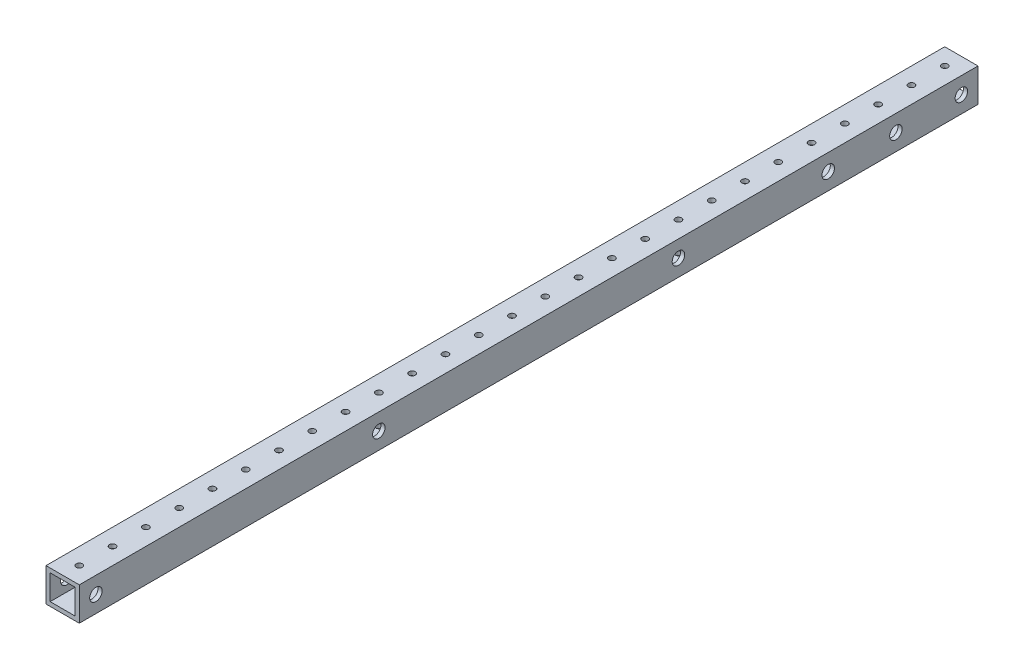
ISO-10303-21;
HEADER;
FILE_DESCRIPTION(('STEP AP214'),'2;1');
FILE_NAME('part.step','',(''),(''),'','','');
FILE_SCHEMA(('AUTOMOTIVE_DESIGN { 1 0 10303 214 1 1 1 1 }'));
ENDSEC;
DATA;
#1=APPLICATION_CONTEXT('core data for automotive mechanical design processes');
#2=APPLICATION_PROTOCOL_DEFINITION('international standard','automotive_design',2000,#1);
#3=PRODUCT_CONTEXT('',#1,'mechanical');
#4=PRODUCT('Part','Part','',(#3));
#5=PRODUCT_RELATED_PRODUCT_CATEGORY('part','',(#4));
#6=PRODUCT_DEFINITION_FORMATION('','',#4);
#7=PRODUCT_DEFINITION_CONTEXT('part definition',#1,'design');
#8=PRODUCT_DEFINITION('design','',#6,#7);
#9=PRODUCT_DEFINITION_SHAPE('','',#8);
#10=(LENGTH_UNIT() NAMED_UNIT(*) SI_UNIT(.MILLI.,.METRE.));
#11=(NAMED_UNIT(*) PLANE_ANGLE_UNIT() SI_UNIT($,.RADIAN.));
#12=(NAMED_UNIT(*) SI_UNIT($,.STERADIAN.) SOLID_ANGLE_UNIT());
#13=UNCERTAINTY_MEASURE_WITH_UNIT(LENGTH_MEASURE(1.E-05),#10,'distance_accuracy_value','');
#14=(GEOMETRIC_REPRESENTATION_CONTEXT(3) GLOBAL_UNCERTAINTY_ASSIGNED_CONTEXT((#13)) GLOBAL_UNIT_ASSIGNED_CONTEXT((#10,
#11,#12)) REPRESENTATION_CONTEXT('',''));
#15=CARTESIAN_POINT('',(0.,0.,0.));
#16=DIRECTION('',(0.,0.,1.));
#17=DIRECTION('',(1.,0.,0.));
#18=AXIS2_PLACEMENT_3D('',#15,#16,#17);
#19=CARTESIAN_POINT('',(-12.7,12.7,342.9));
#20=DIRECTION('',(0.,1.,0.));
#21=DIRECTION('',(0.,0.,1.));
#22=AXIS2_PLACEMENT_3D('',#19,#20,#21);
#23=PLANE('',#22);
#24=CARTESIAN_POINT('',(0.,12.7,-330.2));
#25=DIRECTION('',(0.,-1.,0.));
#26=DIRECTION('',(0.,0.,-1.));
#27=AXIS2_PLACEMENT_3D('',#24,#25,#26);
#28=CIRCLE('',#27,2.38125000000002);
#29=CARTESIAN_POINT('',(0.,12.7,-332.58125));
#30=VERTEX_POINT('',#29);
#31=EDGE_CURVE('E805',#30,#30,#28,.T.);
#32=ORIENTED_EDGE('',*,*,#31,.T.);
#33=EDGE_LOOP('',(#32));
#34=FACE_BOUND('',#33,.T.);
#35=CARTESIAN_POINT('',(0.,12.7,-304.8));
#36=DIRECTION('',(0.,-1.,0.));
#37=DIRECTION('',(0.,0.,-1.));
#38=AXIS2_PLACEMENT_3D('',#35,#36,#37);
#39=CIRCLE('',#38,2.38125000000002);
#40=CARTESIAN_POINT('',(0.,12.7,-307.18125));
#41=VERTEX_POINT('',#40);
#42=EDGE_CURVE('E334',#41,#41,#39,.T.);
#43=ORIENTED_EDGE('',*,*,#42,.T.);
#44=EDGE_LOOP('',(#43));
#45=FACE_BOUND('',#44,.T.);
#46=CARTESIAN_POINT('',(0.,12.7,-279.4));
#47=DIRECTION('',(0.,-1.,0.));
#48=DIRECTION('',(0.,0.,-1.));
#49=AXIS2_PLACEMENT_3D('',#46,#47,#48);
#50=CIRCLE('',#49,2.38125000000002);
#51=CARTESIAN_POINT('',(0.,12.7,-281.78125));
#52=VERTEX_POINT('',#51);
#53=EDGE_CURVE('E330',#52,#52,#50,.T.);
#54=ORIENTED_EDGE('',*,*,#53,.T.);
#55=EDGE_LOOP('',(#54));
#56=FACE_BOUND('',#55,.T.);
#57=CARTESIAN_POINT('',(0.,12.7,-254.));
#58=DIRECTION('',(0.,-1.,0.));
#59=DIRECTION('',(0.,0.,-1.));
#60=AXIS2_PLACEMENT_3D('',#57,#58,#59);
#61=CIRCLE('',#60,2.38125000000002);
#62=CARTESIAN_POINT('',(0.,12.7,-256.38125));
#63=VERTEX_POINT('',#62);
#64=EDGE_CURVE('E326',#63,#63,#61,.T.);
#65=ORIENTED_EDGE('',*,*,#64,.T.);
#66=EDGE_LOOP('',(#65));
#67=FACE_BOUND('',#66,.T.);
#68=CARTESIAN_POINT('',(0.,12.7,-228.6));
#69=DIRECTION('',(0.,-1.,0.));
#70=DIRECTION('',(0.,0.,-1.));
#71=AXIS2_PLACEMENT_3D('',#68,#69,#70);
#72=CIRCLE('',#71,2.38125000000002);
#73=CARTESIAN_POINT('',(0.,12.7,-230.98125));
#74=VERTEX_POINT('',#73);
#75=EDGE_CURVE('E321',#74,#74,#72,.T.);
#76=ORIENTED_EDGE('',*,*,#75,.T.);
#77=EDGE_LOOP('',(#76));
#78=FACE_BOUND('',#77,.T.);
#79=CARTESIAN_POINT('',(0.,12.7,-203.2));
#80=DIRECTION('',(0.,-1.,0.));
#81=DIRECTION('',(0.,0.,-1.));
#82=AXIS2_PLACEMENT_3D('',#79,#80,#81);
#83=CIRCLE('',#82,2.38125000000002);
#84=CARTESIAN_POINT('',(0.,12.7,-205.58125));
#85=VERTEX_POINT('',#84);
#86=EDGE_CURVE('E316',#85,#85,#83,.T.);
#87=ORIENTED_EDGE('',*,*,#86,.T.);
#88=EDGE_LOOP('',(#87));
#89=FACE_BOUND('',#88,.T.);
#90=CARTESIAN_POINT('',(0.,12.7,-177.8));
#91=DIRECTION('',(0.,-1.,0.));
#92=DIRECTION('',(0.,0.,-1.));
#93=AXIS2_PLACEMENT_3D('',#90,#91,#92);
#94=CIRCLE('',#93,2.38125000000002);
#95=CARTESIAN_POINT('',(0.,12.7,-180.18125));
#96=VERTEX_POINT('',#95);
#97=EDGE_CURVE('E311',#96,#96,#94,.T.);
#98=ORIENTED_EDGE('',*,*,#97,.T.);
#99=EDGE_LOOP('',(#98));
#100=FACE_BOUND('',#99,.T.);
#101=CARTESIAN_POINT('',(0.,12.7,-152.4));
#102=DIRECTION('',(0.,-1.,0.));
#103=DIRECTION('',(0.,0.,-1.));
#104=AXIS2_PLACEMENT_3D('',#101,#102,#103);
#105=CIRCLE('',#104,2.38125000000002);
#106=CARTESIAN_POINT('',(0.,12.7,-154.78125));
#107=VERTEX_POINT('',#106);
#108=EDGE_CURVE('E306',#107,#107,#105,.T.);
#109=ORIENTED_EDGE('',*,*,#108,.T.);
#110=EDGE_LOOP('',(#109));
#111=FACE_BOUND('',#110,.T.);
#112=CARTESIAN_POINT('',(0.,12.7,-127.));
#113=DIRECTION('',(0.,-1.,0.));
#114=DIRECTION('',(0.,0.,-1.));
#115=AXIS2_PLACEMENT_3D('',#112,#113,#114);
#116=CIRCLE('',#115,2.38125000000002);
#117=CARTESIAN_POINT('',(0.,12.7,-129.38125));
#118=VERTEX_POINT('',#117);
#119=EDGE_CURVE('E301',#118,#118,#116,.T.);
#120=ORIENTED_EDGE('',*,*,#119,.T.);
#121=EDGE_LOOP('',(#120));
#122=FACE_BOUND('',#121,.T.);
#123=CARTESIAN_POINT('',(0.,12.7,-101.6));
#124=DIRECTION('',(0.,-1.,0.));
#125=DIRECTION('',(0.,0.,-1.));
#126=AXIS2_PLACEMENT_3D('',#123,#124,#125);
#127=CIRCLE('',#126,2.38125000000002);
#128=CARTESIAN_POINT('',(0.,12.7,-103.98125));
#129=VERTEX_POINT('',#128);
#130=EDGE_CURVE('E296',#129,#129,#127,.T.);
#131=ORIENTED_EDGE('',*,*,#130,.T.);
#132=EDGE_LOOP('',(#131));
#133=FACE_BOUND('',#132,.T.);
#134=CARTESIAN_POINT('',(0.,12.7,-76.2));
#135=DIRECTION('',(0.,-1.,0.));
#136=DIRECTION('',(0.,0.,-1.));
#137=AXIS2_PLACEMENT_3D('',#134,#135,#136);
#138=CIRCLE('',#137,2.38125000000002);
#139=CARTESIAN_POINT('',(0.,12.7,-78.58125));
#140=VERTEX_POINT('',#139);
#141=EDGE_CURVE('E291',#140,#140,#138,.T.);
#142=ORIENTED_EDGE('',*,*,#141,.T.);
#143=EDGE_LOOP('',(#142));
#144=FACE_BOUND('',#143,.T.);
#145=CARTESIAN_POINT('',(0.,12.7,-50.8));
#146=DIRECTION('',(0.,-1.,0.));
#147=DIRECTION('',(0.,0.,-1.));
#148=AXIS2_PLACEMENT_3D('',#145,#146,#147);
#149=CIRCLE('',#148,2.38125000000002);
#150=CARTESIAN_POINT('',(0.,12.7,-53.18125));
#151=VERTEX_POINT('',#150);
#152=EDGE_CURVE('E286',#151,#151,#149,.T.);
#153=ORIENTED_EDGE('',*,*,#152,.T.);
#154=EDGE_LOOP('',(#153));
#155=FACE_BOUND('',#154,.T.);
#156=CARTESIAN_POINT('',(0.,12.7,-25.4));
#157=DIRECTION('',(0.,-1.,0.));
#158=DIRECTION('',(0.,0.,-1.));
#159=AXIS2_PLACEMENT_3D('',#156,#157,#158);
#160=CIRCLE('',#159,2.38125000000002);
#161=CARTESIAN_POINT('',(0.,12.7,-27.78125));
#162=VERTEX_POINT('',#161);
#163=EDGE_CURVE('E281',#162,#162,#160,.T.);
#164=ORIENTED_EDGE('',*,*,#163,.T.);
#165=EDGE_LOOP('',(#164));
#166=FACE_BOUND('',#165,.T.);
#167=CARTESIAN_POINT('',(0.,12.7,0.));
#168=DIRECTION('',(0.,-1.,0.));
#169=DIRECTION('',(0.,0.,-1.));
#170=AXIS2_PLACEMENT_3D('',#167,#168,#169);
#171=CIRCLE('',#170,2.38125000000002);
#172=CARTESIAN_POINT('',(0.,12.7,-2.38125000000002));
#173=VERTEX_POINT('',#172);
#174=EDGE_CURVE('E276',#173,#173,#171,.T.);
#175=ORIENTED_EDGE('',*,*,#174,.T.);
#176=EDGE_LOOP('',(#175));
#177=FACE_BOUND('',#176,.T.);
#178=CARTESIAN_POINT('',(0.,12.7,25.4));
#179=DIRECTION('',(0.,-1.,0.));
#180=DIRECTION('',(0.,0.,-1.));
#181=AXIS2_PLACEMENT_3D('',#178,#179,#180);
#182=CIRCLE('',#181,2.38125000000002);
#183=CARTESIAN_POINT('',(0.,12.7,23.01875));
#184=VERTEX_POINT('',#183);
#185=EDGE_CURVE('E271',#184,#184,#182,.T.);
#186=ORIENTED_EDGE('',*,*,#185,.T.);
#187=EDGE_LOOP('',(#186));
#188=FACE_BOUND('',#187,.T.);
#189=CARTESIAN_POINT('',(0.,12.7,50.8));
#190=DIRECTION('',(0.,-1.,0.));
#191=DIRECTION('',(0.,0.,-1.));
#192=AXIS2_PLACEMENT_3D('',#189,#190,#191);
#193=CIRCLE('',#192,2.38125000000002);
#194=CARTESIAN_POINT('',(0.,12.7,48.41875));
#195=VERTEX_POINT('',#194);
#196=EDGE_CURVE('E266',#195,#195,#193,.T.);
#197=ORIENTED_EDGE('',*,*,#196,.T.);
#198=EDGE_LOOP('',(#197));
#199=FACE_BOUND('',#198,.T.);
#200=CARTESIAN_POINT('',(0.,12.7,76.2));
#201=DIRECTION('',(0.,-1.,0.));
#202=DIRECTION('',(0.,0.,-1.));
#203=AXIS2_PLACEMENT_3D('',#200,#201,#202);
#204=CIRCLE('',#203,2.38125000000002);
#205=CARTESIAN_POINT('',(0.,12.7,73.81875));
#206=VERTEX_POINT('',#205);
#207=EDGE_CURVE('E261',#206,#206,#204,.T.);
#208=ORIENTED_EDGE('',*,*,#207,.T.);
#209=EDGE_LOOP('',(#208));
#210=FACE_BOUND('',#209,.T.);
#211=CARTESIAN_POINT('',(0.,12.7,101.6));
#212=DIRECTION('',(0.,-1.,0.));
#213=DIRECTION('',(0.,0.,-1.));
#214=AXIS2_PLACEMENT_3D('',#211,#212,#213);
#215=CIRCLE('',#214,2.38125000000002);
#216=CARTESIAN_POINT('',(0.,12.7,99.21875));
#217=VERTEX_POINT('',#216);
#218=EDGE_CURVE('E256',#217,#217,#215,.T.);
#219=ORIENTED_EDGE('',*,*,#218,.T.);
#220=EDGE_LOOP('',(#219));
#221=FACE_BOUND('',#220,.T.);
#222=CARTESIAN_POINT('',(0.,12.7,127.));
#223=DIRECTION('',(0.,-1.,0.));
#224=DIRECTION('',(0.,0.,-1.));
#225=AXIS2_PLACEMENT_3D('',#222,#223,#224);
#226=CIRCLE('',#225,2.38125000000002);
#227=CARTESIAN_POINT('',(0.,12.7,124.61875));
#228=VERTEX_POINT('',#227);
#229=EDGE_CURVE('E251',#228,#228,#226,.T.);
#230=ORIENTED_EDGE('',*,*,#229,.T.);
#231=EDGE_LOOP('',(#230));
#232=FACE_BOUND('',#231,.T.);
#233=CARTESIAN_POINT('',(0.,12.7,152.4));
#234=DIRECTION('',(0.,-1.,0.));
#235=DIRECTION('',(0.,0.,-1.));
#236=AXIS2_PLACEMENT_3D('',#233,#234,#235);
#237=CIRCLE('',#236,2.38125000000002);
#238=CARTESIAN_POINT('',(0.,12.7,150.01875));
#239=VERTEX_POINT('',#238);
#240=EDGE_CURVE('E246',#239,#239,#237,.T.);
#241=ORIENTED_EDGE('',*,*,#240,.T.);
#242=EDGE_LOOP('',(#241));
#243=FACE_BOUND('',#242,.T.);
#244=CARTESIAN_POINT('',(0.,12.7,177.8));
#245=DIRECTION('',(0.,-1.,0.));
#246=DIRECTION('',(0.,0.,-1.));
#247=AXIS2_PLACEMENT_3D('',#244,#245,#246);
#248=CIRCLE('',#247,2.38125000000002);
#249=CARTESIAN_POINT('',(0.,12.7,175.41875));
#250=VERTEX_POINT('',#249);
#251=EDGE_CURVE('E241',#250,#250,#248,.T.);
#252=ORIENTED_EDGE('',*,*,#251,.T.);
#253=EDGE_LOOP('',(#252));
#254=FACE_BOUND('',#253,.T.);
#255=CARTESIAN_POINT('',(0.,12.7,203.2));
#256=DIRECTION('',(0.,-1.,0.));
#257=DIRECTION('',(0.,0.,-1.));
#258=AXIS2_PLACEMENT_3D('',#255,#256,#257);
#259=CIRCLE('',#258,2.38125000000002);
#260=CARTESIAN_POINT('',(0.,12.7,200.81875));
#261=VERTEX_POINT('',#260);
#262=EDGE_CURVE('E236',#261,#261,#259,.T.);
#263=ORIENTED_EDGE('',*,*,#262,.T.);
#264=EDGE_LOOP('',(#263));
#265=FACE_BOUND('',#264,.T.);
#266=CARTESIAN_POINT('',(0.,12.7,228.6));
#267=DIRECTION('',(0.,-1.,0.));
#268=DIRECTION('',(0.,0.,-1.));
#269=AXIS2_PLACEMENT_3D('',#266,#267,#268);
#270=CIRCLE('',#269,2.38125000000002);
#271=CARTESIAN_POINT('',(0.,12.7,226.21875));
#272=VERTEX_POINT('',#271);
#273=EDGE_CURVE('E231',#272,#272,#270,.T.);
#274=ORIENTED_EDGE('',*,*,#273,.T.);
#275=EDGE_LOOP('',(#274));
#276=FACE_BOUND('',#275,.T.);
#277=CARTESIAN_POINT('',(0.,12.7,254.));
#278=DIRECTION('',(0.,-1.,0.));
#279=DIRECTION('',(0.,0.,-1.));
#280=AXIS2_PLACEMENT_3D('',#277,#278,#279);
#281=CIRCLE('',#280,2.38125000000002);
#282=CARTESIAN_POINT('',(0.,12.7,251.61875));
#283=VERTEX_POINT('',#282);
#284=EDGE_CURVE('E226',#283,#283,#281,.T.);
#285=ORIENTED_EDGE('',*,*,#284,.T.);
#286=EDGE_LOOP('',(#285));
#287=FACE_BOUND('',#286,.T.);
#288=CARTESIAN_POINT('',(0.,12.7,279.4));
#289=DIRECTION('',(0.,-1.,0.));
#290=DIRECTION('',(0.,0.,-1.));
#291=AXIS2_PLACEMENT_3D('',#288,#289,#290);
#292=CIRCLE('',#291,2.38125000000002);
#293=CARTESIAN_POINT('',(0.,12.7,277.01875));
#294=VERTEX_POINT('',#293);
#295=EDGE_CURVE('E221',#294,#294,#292,.T.);
#296=ORIENTED_EDGE('',*,*,#295,.T.);
#297=EDGE_LOOP('',(#296));
#298=FACE_BOUND('',#297,.T.);
#299=CARTESIAN_POINT('',(0.,12.7,304.8));
#300=DIRECTION('',(0.,-1.,0.));
#301=DIRECTION('',(0.,0.,-1.));
#302=AXIS2_PLACEMENT_3D('',#299,#300,#301);
#303=CIRCLE('',#302,2.38125000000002);
#304=CARTESIAN_POINT('',(0.,12.7,302.41875));
#305=VERTEX_POINT('',#304);
#306=EDGE_CURVE('E216',#305,#305,#303,.T.);
#307=ORIENTED_EDGE('',*,*,#306,.T.);
#308=EDGE_LOOP('',(#307));
#309=FACE_BOUND('',#308,.T.);
#310=CARTESIAN_POINT('',(0.,12.7,330.2));
#311=DIRECTION('',(0.,-1.,0.));
#312=DIRECTION('',(0.,0.,-1.));
#313=AXIS2_PLACEMENT_3D('',#310,#311,#312);
#314=CIRCLE('',#313,2.38125000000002);
#315=CARTESIAN_POINT('',(0.,12.7,327.81875));
#316=VERTEX_POINT('',#315);
#317=EDGE_CURVE('E211',#316,#316,#314,.T.);
#318=ORIENTED_EDGE('',*,*,#317,.T.);
#319=EDGE_LOOP('',(#318));
#320=FACE_BOUND('',#319,.T.);
#321=DIRECTION('',(1.,0.,0.));
#322=VECTOR('',#321,1.);
#323=CARTESIAN_POINT('',(-12.7,12.7,-342.9));
#324=LINE('',#323,#322);
#325=CARTESIAN_POINT('',(-12.7,12.7,-342.9));
#326=VERTEX_POINT('',#325);
#327=CARTESIAN_POINT('',(12.7,12.7,-342.9));
#328=VERTEX_POINT('',#327);
#329=EDGE_CURVE('E158',#326,#328,#324,.T.);
#330=ORIENTED_EDGE('',*,*,#329,.F.);
#331=DIRECTION('',(0.,0.,-1.));
#332=VECTOR('',#331,1.);
#333=CARTESIAN_POINT('',(-12.7,12.7,342.9));
#334=LINE('',#333,#332);
#335=CARTESIAN_POINT('',(-12.7,12.7,342.9));
#336=VERTEX_POINT('',#335);
#337=EDGE_CURVE('E12',#336,#326,#334,.T.);
#338=ORIENTED_EDGE('',*,*,#337,.F.);
#339=DIRECTION('',(1.,0.,0.));
#340=VECTOR('',#339,1.);
#341=CARTESIAN_POINT('',(-12.7,12.7,342.9));
#342=LINE('',#341,#340);
#343=CARTESIAN_POINT('',(12.7,12.7,342.9));
#344=VERTEX_POINT('',#343);
#345=EDGE_CURVE('E162',#336,#344,#342,.T.);
#346=ORIENTED_EDGE('',*,*,#345,.T.);
#347=DIRECTION('',(0.,0.,-1.));
#348=VECTOR('',#347,1.);
#349=CARTESIAN_POINT('',(12.7,12.7,342.9));
#350=LINE('',#349,#348);
#351=EDGE_CURVE('E173',#344,#328,#350,.T.);
#352=ORIENTED_EDGE('',*,*,#351,.T.);
#353=EDGE_LOOP('',(#330,#338,#346,#352));
#354=FACE_BOUND('',#353,.T.);
#355=ADVANCED_FACE('F59',(#34,#45,#56,#67,#78,#89,#100,#111,#122,#133,#144,#155,#166,#177,#188,
#199,#210,#221,#232,#243,#254,#265,#276,#287,#298,#309,#320,#354),#23,.T.);
#356=CARTESIAN_POINT('',(-12.7,12.7,342.9));
#357=DIRECTION('',(1.,0.,0.));
#358=DIRECTION('',(0.,1.,0.));
#359=AXIS2_PLACEMENT_3D('',#356,#357,#358);
#360=PLANE('',#359);
#361=CARTESIAN_POINT('',(-12.7,0.,-228.6));
#362=DIRECTION('',(-1.,0.,0.));
#363=DIRECTION('',(0.,-1.,0.));
#364=AXIS2_PLACEMENT_3D('',#361,#362,#363);
#365=CIRCLE('',#364,2.4892);
#366=CARTESIAN_POINT('',(-12.7,-2.48920000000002,-228.6));
#367=VERTEX_POINT('',#366);
#368=EDGE_CURVE('E782',#367,#367,#365,.T.);
#369=ORIENTED_EDGE('',*,*,#368,.F.);
#370=EDGE_LOOP('',(#369));
#371=FACE_BOUND('',#370,.T.);
#372=CARTESIAN_POINT('',(-12.7,0.,-280.2636));
#373=DIRECTION('',(-1.,0.,0.));
#374=DIRECTION('',(0.,-1.,0.));
#375=AXIS2_PLACEMENT_3D('',#372,#373,#374);
#376=CIRCLE('',#375,2.48920000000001);
#377=CARTESIAN_POINT('',(-12.7,-2.48920000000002,-280.2636));
#378=VERTEX_POINT('',#377);
#379=EDGE_CURVE('E786',#378,#378,#376,.T.);
#380=ORIENTED_EDGE('',*,*,#379,.F.);
#381=EDGE_LOOP('',(#380));
#382=FACE_BOUND('',#381,.T.);
#383=CARTESIAN_POINT('',(-12.7,0.,-114.3));
#384=DIRECTION('',(1.,0.,0.));
#385=DIRECTION('',(0.,1.,0.));
#386=AXIS2_PLACEMENT_3D('',#383,#384,#385);
#387=CIRCLE('',#386,4.76250000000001);
#388=CARTESIAN_POINT('',(-12.7,4.76250000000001,-114.3));
#389=VERTEX_POINT('',#388);
#390=EDGE_CURVE('E206',#389,#389,#387,.T.);
#391=ORIENTED_EDGE('',*,*,#390,.T.);
#392=EDGE_LOOP('',(#391));
#393=FACE_BOUND('',#392,.T.);
#394=CARTESIAN_POINT('',(-12.7,0.,114.3));
#395=DIRECTION('',(1.,0.,0.));
#396=DIRECTION('',(0.,1.,0.));
#397=AXIS2_PLACEMENT_3D('',#394,#395,#396);
#398=CIRCLE('',#397,4.76250000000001);
#399=CARTESIAN_POINT('',(-12.7,4.76250000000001,114.3));
#400=VERTEX_POINT('',#399);
#401=EDGE_CURVE('E201',#400,#400,#398,.T.);
#402=ORIENTED_EDGE('',*,*,#401,.T.);
#403=EDGE_LOOP('',(#402));
#404=FACE_BOUND('',#403,.T.);
#405=CARTESIAN_POINT('',(-12.7,0.,-330.2));
#406=DIRECTION('',(1.,0.,0.));
#407=DIRECTION('',(0.,1.,0.));
#408=AXIS2_PLACEMENT_3D('',#405,#406,#407);
#409=CIRCLE('',#408,4.76250000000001);
#410=CARTESIAN_POINT('',(-12.7,4.76250000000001,-330.2));
#411=VERTEX_POINT('',#410);
#412=EDGE_CURVE('E196',#411,#411,#409,.T.);
#413=ORIENTED_EDGE('',*,*,#412,.T.);
#414=EDGE_LOOP('',(#413));
#415=FACE_BOUND('',#414,.T.);
#416=CARTESIAN_POINT('',(-12.7,0.,330.2));
#417=DIRECTION('',(1.,0.,0.));
#418=DIRECTION('',(0.,1.,0.));
#419=AXIS2_PLACEMENT_3D('',#416,#417,#418);
#420=CIRCLE('',#419,4.76250000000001);
#421=CARTESIAN_POINT('',(-12.7,4.76250000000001,330.2));
#422=VERTEX_POINT('',#421);
#423=EDGE_CURVE('E191',#422,#422,#420,.T.);
#424=ORIENTED_EDGE('',*,*,#423,.T.);
#425=EDGE_LOOP('',(#424));
#426=FACE_BOUND('',#425,.T.);
#427=DIRECTION('',(0.,-1.,0.));
#428=VECTOR('',#427,1.);
#429=CARTESIAN_POINT('',(-12.7,12.7,-342.9));
#430=LINE('',#429,#428);
#431=CARTESIAN_POINT('',(-12.7,-12.7,-342.9));
#432=VERTEX_POINT('',#431);
#433=EDGE_CURVE('E166',#326,#432,#430,.T.);
#434=ORIENTED_EDGE('',*,*,#433,.T.);
#435=DIRECTION('',(0.,0.,-1.));
#436=VECTOR('',#435,1.);
#437=CARTESIAN_POINT('',(-12.7,-12.7,342.9));
#438=LINE('',#437,#436);
#439=CARTESIAN_POINT('',(-12.7,-12.7,342.9));
#440=VERTEX_POINT('',#439);
#441=EDGE_CURVE('E67',#440,#432,#438,.T.);
#442=ORIENTED_EDGE('',*,*,#441,.F.);
#443=DIRECTION('',(0.,-1.,0.));
#444=VECTOR('',#443,1.);
#445=CARTESIAN_POINT('',(-12.7,12.7,342.9));
#446=LINE('',#445,#444);
#447=EDGE_CURVE('E171',#336,#440,#446,.T.);
#448=ORIENTED_EDGE('',*,*,#447,.F.);
#449=ORIENTED_EDGE('',*,*,#337,.T.);
#450=EDGE_LOOP('',(#434,#442,#448,#449));
#451=FACE_BOUND('',#450,.T.);
#452=ADVANCED_FACE('F574',(#371,#382,#393,#404,#415,#426,#451),#360,.F.);
#453=CARTESIAN_POINT('',(-12.7,-12.7,342.9));
#454=DIRECTION('',(0.,1.,0.));
#455=DIRECTION('',(0.,0.,1.));
#456=AXIS2_PLACEMENT_3D('',#453,#454,#455);
#457=PLANE('',#456);
#458=CARTESIAN_POINT('',(0.,-12.7,-330.2));
#459=DIRECTION('',(0.,-1.,0.));
#460=DIRECTION('',(0.,0.,-1.));
#461=AXIS2_PLACEMENT_3D('',#458,#459,#460);
#462=CIRCLE('',#461,2.38125000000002);
#463=CARTESIAN_POINT('',(0.,-12.7,-332.58125));
#464=VERTEX_POINT('',#463);
#465=EDGE_CURVE('E804',#464,#464,#462,.T.);
#466=ORIENTED_EDGE('',*,*,#465,.F.);
#467=EDGE_LOOP('',(#466));
#468=FACE_BOUND('',#467,.T.);
#469=CARTESIAN_POINT('',(0.,-12.7,-304.8));
#470=DIRECTION('',(0.,-1.,0.));
#471=DIRECTION('',(0.,0.,-1.));
#472=AXIS2_PLACEMENT_3D('',#469,#470,#471);
#473=CIRCLE('',#472,2.38125000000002);
#474=CARTESIAN_POINT('',(0.,-12.7,-307.18125));
#475=VERTEX_POINT('',#474);
#476=EDGE_CURVE('E341',#475,#475,#473,.T.);
#477=ORIENTED_EDGE('',*,*,#476,.F.);
#478=EDGE_LOOP('',(#477));
#479=FACE_BOUND('',#478,.T.);
#480=CARTESIAN_POINT('',(0.,-12.7,-279.4));
#481=DIRECTION('',(0.,-1.,0.));
#482=DIRECTION('',(0.,0.,-1.));
#483=AXIS2_PLACEMENT_3D('',#480,#481,#482);
#484=CIRCLE('',#483,2.38125000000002);
#485=CARTESIAN_POINT('',(0.,-12.7,-281.78125));
#486=VERTEX_POINT('',#485);
#487=EDGE_CURVE('E338',#486,#486,#484,.T.);
#488=ORIENTED_EDGE('',*,*,#487,.F.);
#489=EDGE_LOOP('',(#488));
#490=FACE_BOUND('',#489,.T.);
#491=CARTESIAN_POINT('',(0.,-12.7,-254.));
#492=DIRECTION('',(0.,-1.,0.));
#493=DIRECTION('',(0.,0.,-1.));
#494=AXIS2_PLACEMENT_3D('',#491,#492,#493);
#495=CIRCLE('',#494,2.38125000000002);
#496=CARTESIAN_POINT('',(0.,-12.7,-256.38125));
#497=VERTEX_POINT('',#496);
#498=EDGE_CURVE('E357',#497,#497,#495,.T.);
#499=ORIENTED_EDGE('',*,*,#498,.F.);
#500=EDGE_LOOP('',(#499));
#501=FACE_BOUND('',#500,.T.);
#502=CARTESIAN_POINT('',(0.,-12.7,-228.6));
#503=DIRECTION('',(0.,-1.,0.));
#504=DIRECTION('',(0.,0.,-1.));
#505=AXIS2_PLACEMENT_3D('',#502,#503,#504);
#506=CIRCLE('',#505,2.38125000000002);
#507=CARTESIAN_POINT('',(0.,-12.7,-230.98125));
#508=VERTEX_POINT('',#507);
#509=EDGE_CURVE('E364',#508,#508,#506,.T.);
#510=ORIENTED_EDGE('',*,*,#509,.F.);
#511=EDGE_LOOP('',(#510));
#512=FACE_BOUND('',#511,.T.);
#513=CARTESIAN_POINT('',(0.,-12.7,-203.2));
#514=DIRECTION('',(0.,-1.,0.));
#515=DIRECTION('',(0.,0.,-1.));
#516=AXIS2_PLACEMENT_3D('',#513,#514,#515);
#517=CIRCLE('',#516,2.38125000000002);
#518=CARTESIAN_POINT('',(0.,-12.7,-205.58125));
#519=VERTEX_POINT('',#518);
#520=EDGE_CURVE('E371',#519,#519,#517,.T.);
#521=ORIENTED_EDGE('',*,*,#520,.F.);
#522=EDGE_LOOP('',(#521));
#523=FACE_BOUND('',#522,.T.);
#524=CARTESIAN_POINT('',(0.,-12.7,-177.8));
#525=DIRECTION('',(0.,-1.,0.));
#526=DIRECTION('',(0.,0.,-1.));
#527=AXIS2_PLACEMENT_3D('',#524,#525,#526);
#528=CIRCLE('',#527,2.38125000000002);
#529=CARTESIAN_POINT('',(0.,-12.7,-180.18125));
#530=VERTEX_POINT('',#529);
#531=EDGE_CURVE('E378',#530,#530,#528,.T.);
#532=ORIENTED_EDGE('',*,*,#531,.F.);
#533=EDGE_LOOP('',(#532));
#534=FACE_BOUND('',#533,.T.);
#535=CARTESIAN_POINT('',(0.,-12.7,-152.4));
#536=DIRECTION('',(0.,-1.,0.));
#537=DIRECTION('',(0.,0.,-1.));
#538=AXIS2_PLACEMENT_3D('',#535,#536,#537);
#539=CIRCLE('',#538,2.38125000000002);
#540=CARTESIAN_POINT('',(0.,-12.7,-154.78125));
#541=VERTEX_POINT('',#540);
#542=EDGE_CURVE('E385',#541,#541,#539,.T.);
#543=ORIENTED_EDGE('',*,*,#542,.F.);
#544=EDGE_LOOP('',(#543));
#545=FACE_BOUND('',#544,.T.);
#546=CARTESIAN_POINT('',(0.,-12.7,-127.));
#547=DIRECTION('',(0.,-1.,0.));
#548=DIRECTION('',(0.,0.,-1.));
#549=AXIS2_PLACEMENT_3D('',#546,#547,#548);
#550=CIRCLE('',#549,2.38125000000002);
#551=CARTESIAN_POINT('',(0.,-12.7,-129.38125));
#552=VERTEX_POINT('',#551);
#553=EDGE_CURVE('E392',#552,#552,#550,.T.);
#554=ORIENTED_EDGE('',*,*,#553,.F.);
#555=EDGE_LOOP('',(#554));
#556=FACE_BOUND('',#555,.T.);
#557=CARTESIAN_POINT('',(0.,-12.7,-101.6));
#558=DIRECTION('',(0.,-1.,0.));
#559=DIRECTION('',(0.,0.,-1.));
#560=AXIS2_PLACEMENT_3D('',#557,#558,#559);
#561=CIRCLE('',#560,2.38125000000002);
#562=CARTESIAN_POINT('',(0.,-12.7,-103.98125));
#563=VERTEX_POINT('',#562);
#564=EDGE_CURVE('E399',#563,#563,#561,.T.);
#565=ORIENTED_EDGE('',*,*,#564,.F.);
#566=EDGE_LOOP('',(#565));
#567=FACE_BOUND('',#566,.T.);
#568=CARTESIAN_POINT('',(0.,-12.7,-76.2));
#569=DIRECTION('',(0.,-1.,0.));
#570=DIRECTION('',(0.,0.,-1.));
#571=AXIS2_PLACEMENT_3D('',#568,#569,#570);
#572=CIRCLE('',#571,2.38125000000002);
#573=CARTESIAN_POINT('',(0.,-12.7,-78.58125));
#574=VERTEX_POINT('',#573);
#575=EDGE_CURVE('E406',#574,#574,#572,.T.);
#576=ORIENTED_EDGE('',*,*,#575,.F.);
#577=EDGE_LOOP('',(#576));
#578=FACE_BOUND('',#577,.T.);
#579=CARTESIAN_POINT('',(0.,-12.7,-50.8));
#580=DIRECTION('',(0.,-1.,0.));
#581=DIRECTION('',(0.,0.,-1.));
#582=AXIS2_PLACEMENT_3D('',#579,#580,#581);
#583=CIRCLE('',#582,2.38125000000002);
#584=CARTESIAN_POINT('',(0.,-12.7,-53.18125));
#585=VERTEX_POINT('',#584);
#586=EDGE_CURVE('E413',#585,#585,#583,.T.);
#587=ORIENTED_EDGE('',*,*,#586,.F.);
#588=EDGE_LOOP('',(#587));
#589=FACE_BOUND('',#588,.T.);
#590=CARTESIAN_POINT('',(0.,-12.7,-25.4));
#591=DIRECTION('',(0.,-1.,0.));
#592=DIRECTION('',(0.,0.,-1.));
#593=AXIS2_PLACEMENT_3D('',#590,#591,#592);
#594=CIRCLE('',#593,2.38125000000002);
#595=CARTESIAN_POINT('',(0.,-12.7,-27.78125));
#596=VERTEX_POINT('',#595);
#597=EDGE_CURVE('E420',#596,#596,#594,.T.);
#598=ORIENTED_EDGE('',*,*,#597,.F.);
#599=EDGE_LOOP('',(#598));
#600=FACE_BOUND('',#599,.T.);
#601=CARTESIAN_POINT('',(0.,-12.7,0.));
#602=DIRECTION('',(0.,-1.,0.));
#603=DIRECTION('',(0.,0.,-1.));
#604=AXIS2_PLACEMENT_3D('',#601,#602,#603);
#605=CIRCLE('',#604,2.38125000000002);
#606=CARTESIAN_POINT('',(0.,-12.7,-2.38125000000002));
#607=VERTEX_POINT('',#606);
#608=EDGE_CURVE('E427',#607,#607,#605,.T.);
#609=ORIENTED_EDGE('',*,*,#608,.F.);
#610=EDGE_LOOP('',(#609));
#611=FACE_BOUND('',#610,.T.);
#612=CARTESIAN_POINT('',(0.,-12.7,25.4));
#613=DIRECTION('',(0.,-1.,0.));
#614=DIRECTION('',(0.,0.,-1.));
#615=AXIS2_PLACEMENT_3D('',#612,#613,#614);
#616=CIRCLE('',#615,2.38125000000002);
#617=CARTESIAN_POINT('',(0.,-12.7,23.01875));
#618=VERTEX_POINT('',#617);
#619=EDGE_CURVE('E434',#618,#618,#616,.T.);
#620=ORIENTED_EDGE('',*,*,#619,.F.);
#621=EDGE_LOOP('',(#620));
#622=FACE_BOUND('',#621,.T.);
#623=CARTESIAN_POINT('',(0.,-12.7,50.8));
#624=DIRECTION('',(0.,-1.,0.));
#625=DIRECTION('',(0.,0.,-1.));
#626=AXIS2_PLACEMENT_3D('',#623,#624,#625);
#627=CIRCLE('',#626,2.38125000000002);
#628=CARTESIAN_POINT('',(0.,-12.7,48.41875));
#629=VERTEX_POINT('',#628);
#630=EDGE_CURVE('E441',#629,#629,#627,.T.);
#631=ORIENTED_EDGE('',*,*,#630,.F.);
#632=EDGE_LOOP('',(#631));
#633=FACE_BOUND('',#632,.T.);
#634=CARTESIAN_POINT('',(0.,-12.7,76.2));
#635=DIRECTION('',(0.,-1.,0.));
#636=DIRECTION('',(0.,0.,-1.));
#637=AXIS2_PLACEMENT_3D('',#634,#635,#636);
#638=CIRCLE('',#637,2.38125000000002);
#639=CARTESIAN_POINT('',(0.,-12.7,73.81875));
#640=VERTEX_POINT('',#639);
#641=EDGE_CURVE('E448',#640,#640,#638,.T.);
#642=ORIENTED_EDGE('',*,*,#641,.F.);
#643=EDGE_LOOP('',(#642));
#644=FACE_BOUND('',#643,.T.);
#645=CARTESIAN_POINT('',(0.,-12.7,101.6));
#646=DIRECTION('',(0.,-1.,0.));
#647=DIRECTION('',(0.,0.,-1.));
#648=AXIS2_PLACEMENT_3D('',#645,#646,#647);
#649=CIRCLE('',#648,2.38125000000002);
#650=CARTESIAN_POINT('',(0.,-12.7,99.21875));
#651=VERTEX_POINT('',#650);
#652=EDGE_CURVE('E455',#651,#651,#649,.T.);
#653=ORIENTED_EDGE('',*,*,#652,.F.);
#654=EDGE_LOOP('',(#653));
#655=FACE_BOUND('',#654,.T.);
#656=CARTESIAN_POINT('',(0.,-12.7,127.));
#657=DIRECTION('',(0.,-1.,0.));
#658=DIRECTION('',(0.,0.,-1.));
#659=AXIS2_PLACEMENT_3D('',#656,#657,#658);
#660=CIRCLE('',#659,2.38125000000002);
#661=CARTESIAN_POINT('',(0.,-12.7,124.61875));
#662=VERTEX_POINT('',#661);
#663=EDGE_CURVE('E462',#662,#662,#660,.T.);
#664=ORIENTED_EDGE('',*,*,#663,.F.);
#665=EDGE_LOOP('',(#664));
#666=FACE_BOUND('',#665,.T.);
#667=CARTESIAN_POINT('',(0.,-12.7,152.4));
#668=DIRECTION('',(0.,-1.,0.));
#669=DIRECTION('',(0.,0.,-1.));
#670=AXIS2_PLACEMENT_3D('',#667,#668,#669);
#671=CIRCLE('',#670,2.38125000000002);
#672=CARTESIAN_POINT('',(0.,-12.7,150.01875));
#673=VERTEX_POINT('',#672);
#674=EDGE_CURVE('E469',#673,#673,#671,.T.);
#675=ORIENTED_EDGE('',*,*,#674,.F.);
#676=EDGE_LOOP('',(#675));
#677=FACE_BOUND('',#676,.T.);
#678=CARTESIAN_POINT('',(0.,-12.7,177.8));
#679=DIRECTION('',(0.,-1.,0.));
#680=DIRECTION('',(0.,0.,-1.));
#681=AXIS2_PLACEMENT_3D('',#678,#679,#680);
#682=CIRCLE('',#681,2.38125000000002);
#683=CARTESIAN_POINT('',(0.,-12.7,175.41875));
#684=VERTEX_POINT('',#683);
#685=EDGE_CURVE('E476',#684,#684,#682,.T.);
#686=ORIENTED_EDGE('',*,*,#685,.F.);
#687=EDGE_LOOP('',(#686));
#688=FACE_BOUND('',#687,.T.);
#689=CARTESIAN_POINT('',(0.,-12.7,203.2));
#690=DIRECTION('',(0.,-1.,0.));
#691=DIRECTION('',(0.,0.,-1.));
#692=AXIS2_PLACEMENT_3D('',#689,#690,#691);
#693=CIRCLE('',#692,2.38125000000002);
#694=CARTESIAN_POINT('',(0.,-12.7,200.81875));
#695=VERTEX_POINT('',#694);
#696=EDGE_CURVE('E483',#695,#695,#693,.T.);
#697=ORIENTED_EDGE('',*,*,#696,.F.);
#698=EDGE_LOOP('',(#697));
#699=FACE_BOUND('',#698,.T.);
#700=CARTESIAN_POINT('',(0.,-12.7,228.6));
#701=DIRECTION('',(0.,-1.,0.));
#702=DIRECTION('',(0.,0.,-1.));
#703=AXIS2_PLACEMENT_3D('',#700,#701,#702);
#704=CIRCLE('',#703,2.38125000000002);
#705=CARTESIAN_POINT('',(0.,-12.7,226.21875));
#706=VERTEX_POINT('',#705);
#707=EDGE_CURVE('E490',#706,#706,#704,.T.);
#708=ORIENTED_EDGE('',*,*,#707,.F.);
#709=EDGE_LOOP('',(#708));
#710=FACE_BOUND('',#709,.T.);
#711=CARTESIAN_POINT('',(0.,-12.7,254.));
#712=DIRECTION('',(0.,-1.,0.));
#713=DIRECTION('',(0.,0.,-1.));
#714=AXIS2_PLACEMENT_3D('',#711,#712,#713);
#715=CIRCLE('',#714,2.38125000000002);
#716=CARTESIAN_POINT('',(0.,-12.7,251.61875));
#717=VERTEX_POINT('',#716);
#718=EDGE_CURVE('E497',#717,#717,#715,.T.);
#719=ORIENTED_EDGE('',*,*,#718,.F.);
#720=EDGE_LOOP('',(#719));
#721=FACE_BOUND('',#720,.T.);
#722=CARTESIAN_POINT('',(0.,-12.7,279.4));
#723=DIRECTION('',(0.,-1.,0.));
#724=DIRECTION('',(0.,0.,-1.));
#725=AXIS2_PLACEMENT_3D('',#722,#723,#724);
#726=CIRCLE('',#725,2.38125000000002);
#727=CARTESIAN_POINT('',(0.,-12.7,277.01875));
#728=VERTEX_POINT('',#727);
#729=EDGE_CURVE('E504',#728,#728,#726,.T.);
#730=ORIENTED_EDGE('',*,*,#729,.F.);
#731=EDGE_LOOP('',(#730));
#732=FACE_BOUND('',#731,.T.);
#733=CARTESIAN_POINT('',(0.,-12.7,304.8));
#734=DIRECTION('',(0.,-1.,0.));
#735=DIRECTION('',(0.,0.,-1.));
#736=AXIS2_PLACEMENT_3D('',#733,#734,#735);
#737=CIRCLE('',#736,2.38125000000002);
#738=CARTESIAN_POINT('',(0.,-12.7,302.41875));
#739=VERTEX_POINT('',#738);
#740=EDGE_CURVE('E511',#739,#739,#737,.T.);
#741=ORIENTED_EDGE('',*,*,#740,.F.);
#742=EDGE_LOOP('',(#741));
#743=FACE_BOUND('',#742,.T.);
#744=CARTESIAN_POINT('',(0.,-12.7,330.2));
#745=DIRECTION('',(0.,-1.,0.));
#746=DIRECTION('',(0.,0.,-1.));
#747=AXIS2_PLACEMENT_3D('',#744,#745,#746);
#748=CIRCLE('',#747,2.38125000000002);
#749=CARTESIAN_POINT('',(0.,-12.7,327.81875));
#750=VERTEX_POINT('',#749);
#751=EDGE_CURVE('E518',#750,#750,#748,.T.);
#752=ORIENTED_EDGE('',*,*,#751,.F.);
#753=EDGE_LOOP('',(#752));
#754=FACE_BOUND('',#753,.T.);
#755=DIRECTION('',(1.,0.,0.));
#756=VECTOR('',#755,1.);
#757=CARTESIAN_POINT('',(-12.7,-12.7,-342.9));
#758=LINE('',#757,#756);
#759=CARTESIAN_POINT('',(12.7,-12.7,-342.9));
#760=VERTEX_POINT('',#759);
#761=EDGE_CURVE('E179',#432,#760,#758,.T.);
#762=ORIENTED_EDGE('',*,*,#761,.T.);
#763=DIRECTION('',(0.,0.,-1.));
#764=VECTOR('',#763,1.);
#765=CARTESIAN_POINT('',(12.7,-12.7,342.9));
#766=LINE('',#765,#764);
#767=CARTESIAN_POINT('',(12.7,-12.7,342.9));
#768=VERTEX_POINT('',#767);
#769=EDGE_CURVE('E185',#768,#760,#766,.T.);
#770=ORIENTED_EDGE('',*,*,#769,.F.);
#771=DIRECTION('',(1.,0.,0.));
#772=VECTOR('',#771,1.);
#773=CARTESIAN_POINT('',(-12.7,-12.7,342.9));
#774=LINE('',#773,#772);
#775=EDGE_CURVE('E169',#440,#768,#774,.T.);
#776=ORIENTED_EDGE('',*,*,#775,.F.);
#777=ORIENTED_EDGE('',*,*,#441,.T.);
#778=EDGE_LOOP('',(#762,#770,#776,#777));
#779=FACE_BOUND('',#778,.T.);
#780=ADVANCED_FACE('F557',(#468,#479,#490,#501,#512,#523,#534,#545,#556,#567,#578,#589,#600,
#611,#622,#633,#644,#655,#666,#677,#688,#699,#710,#721,#732,#743,#754,#779),#457,.F.);
#781=CARTESIAN_POINT('',(12.7,12.7,342.9));
#782=DIRECTION('',(1.,0.,0.));
#783=DIRECTION('',(0.,1.,0.));
#784=AXIS2_PLACEMENT_3D('',#781,#782,#783);
#785=PLANE('',#784);
#786=CARTESIAN_POINT('',(12.7,0.,-280.2636));
#787=DIRECTION('',(1.,0.,0.));
#788=DIRECTION('',(0.,1.,0.));
#789=AXIS2_PLACEMENT_3D('',#786,#787,#788);
#790=CIRCLE('',#789,4.76250000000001);
#791=CARTESIAN_POINT('',(12.7,4.7625,-280.2636));
#792=VERTEX_POINT('',#791);
#793=EDGE_CURVE('E791',#792,#792,#790,.T.);
#794=ORIENTED_EDGE('',*,*,#793,.F.);
#795=EDGE_LOOP('',(#794));
#796=FACE_BOUND('',#795,.T.);
#797=CARTESIAN_POINT('',(12.7,0.,-228.6));
#798=DIRECTION('',(1.,0.,0.));
#799=DIRECTION('',(0.,1.,0.));
#800=AXIS2_PLACEMENT_3D('',#797,#798,#799);
#801=CIRCLE('',#800,4.76250000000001);
#802=CARTESIAN_POINT('',(12.7,4.7625,-228.6));
#803=VERTEX_POINT('',#802);
#804=EDGE_CURVE('E798',#803,#803,#801,.T.);
#805=ORIENTED_EDGE('',*,*,#804,.F.);
#806=EDGE_LOOP('',(#805));
#807=FACE_BOUND('',#806,.T.);
#808=CARTESIAN_POINT('',(12.7,0.,-114.3));
#809=DIRECTION('',(1.,0.,0.));
#810=DIRECTION('',(0.,1.,0.));
#811=AXIS2_PLACEMENT_3D('',#808,#809,#810);
#812=CIRCLE('',#811,4.76250000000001);
#813=CARTESIAN_POINT('',(12.7,4.76250000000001,-114.3));
#814=VERTEX_POINT('',#813);
#815=EDGE_CURVE('E525',#814,#814,#812,.T.);
#816=ORIENTED_EDGE('',*,*,#815,.F.);
#817=EDGE_LOOP('',(#816));
#818=FACE_BOUND('',#817,.T.);
#819=CARTESIAN_POINT('',(12.7,0.,114.3));
#820=DIRECTION('',(1.,0.,0.));
#821=DIRECTION('',(0.,1.,0.));
#822=AXIS2_PLACEMENT_3D('',#819,#820,#821);
#823=CIRCLE('',#822,4.76250000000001);
#824=CARTESIAN_POINT('',(12.7,4.76250000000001,114.3));
#825=VERTEX_POINT('',#824);
#826=EDGE_CURVE('E532',#825,#825,#823,.T.);
#827=ORIENTED_EDGE('',*,*,#826,.F.);
#828=EDGE_LOOP('',(#827));
#829=FACE_BOUND('',#828,.T.);
#830=CARTESIAN_POINT('',(12.7,0.,-330.2));
#831=DIRECTION('',(1.,0.,0.));
#832=DIRECTION('',(0.,1.,0.));
#833=AXIS2_PLACEMENT_3D('',#830,#831,#832);
#834=CIRCLE('',#833,4.76250000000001);
#835=CARTESIAN_POINT('',(12.7,4.76250000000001,-330.2));
#836=VERTEX_POINT('',#835);
#837=EDGE_CURVE('E539',#836,#836,#834,.T.);
#838=ORIENTED_EDGE('',*,*,#837,.F.);
#839=EDGE_LOOP('',(#838));
#840=FACE_BOUND('',#839,.T.);
#841=CARTESIAN_POINT('',(12.7,0.,330.2));
#842=DIRECTION('',(1.,0.,0.));
#843=DIRECTION('',(0.,1.,0.));
#844=AXIS2_PLACEMENT_3D('',#841,#842,#843);
#845=CIRCLE('',#844,4.76250000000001);
#846=CARTESIAN_POINT('',(12.7,4.76250000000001,330.2));
#847=VERTEX_POINT('',#846);
#848=EDGE_CURVE('E546',#847,#847,#845,.T.);
#849=ORIENTED_EDGE('',*,*,#848,.F.);
#850=EDGE_LOOP('',(#849));
#851=FACE_BOUND('',#850,.T.);
#852=DIRECTION('',(0.,-1.,0.));
#853=VECTOR('',#852,1.);
#854=CARTESIAN_POINT('',(12.7,12.7,-342.9));
#855=LINE('',#854,#853);
#856=EDGE_CURVE('E176',#328,#760,#855,.T.);
#857=ORIENTED_EDGE('',*,*,#856,.F.);
#858=ORIENTED_EDGE('',*,*,#351,.F.);
#859=DIRECTION('',(0.,-1.,0.));
#860=VECTOR('',#859,1.);
#861=CARTESIAN_POINT('',(12.7,12.7,342.9));
#862=LINE('',#861,#860);
#863=EDGE_CURVE('E165',#344,#768,#862,.T.);
#864=ORIENTED_EDGE('',*,*,#863,.T.);
#865=ORIENTED_EDGE('',*,*,#769,.T.);
#866=EDGE_LOOP('',(#857,#858,#864,#865));
#867=FACE_BOUND('',#866,.T.);
#868=ADVANCED_FACE('F554',(#796,#807,#818,#829,#840,#851,#867),#785,.T.);
#869=CARTESIAN_POINT('',(0.,0.,342.9));
#870=DIRECTION('',(0.,0.,-1.));
#871=DIRECTION('',(-1.,0.,0.));
#872=AXIS2_PLACEMENT_3D('',#869,#870,#871);
#873=PLANE('',#872);
#874=DIRECTION('',(0.,-1.,0.));
#875=VECTOR('',#874,1.);
#876=CARTESIAN_POINT('',(-9.52499999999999,9.525,342.9));
#877=LINE('',#876,#875);
#878=CARTESIAN_POINT('',(-9.52499999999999,9.525,342.9));
#879=VERTEX_POINT('',#878);
#880=CARTESIAN_POINT('',(-9.52499999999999,-9.525,342.9));
#881=VERTEX_POINT('',#880);
#882=EDGE_CURVE('E129',#879,#881,#877,.T.);
#883=ORIENTED_EDGE('',*,*,#882,.F.);
#884=DIRECTION('',(1.,0.,0.));
#885=VECTOR('',#884,1.);
#886=CARTESIAN_POINT('',(-9.52499999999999,9.525,342.9));
#887=LINE('',#886,#885);
#888=CARTESIAN_POINT('',(9.52499999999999,9.525,342.9));
#889=VERTEX_POINT('',#888);
#890=EDGE_CURVE('E126',#879,#889,#887,.T.);
#891=ORIENTED_EDGE('',*,*,#890,.T.);
#892=DIRECTION('',(0.,-1.,0.));
#893=VECTOR('',#892,1.);
#894=CARTESIAN_POINT('',(9.52499999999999,9.525,342.9));
#895=LINE('',#894,#893);
#896=CARTESIAN_POINT('',(9.52499999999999,-9.525,342.9));
#897=VERTEX_POINT('',#896);
#898=EDGE_CURVE('E132',#889,#897,#895,.T.);
#899=ORIENTED_EDGE('',*,*,#898,.T.);
#900=DIRECTION('',(1.,0.,0.));
#901=VECTOR('',#900,1.);
#902=CARTESIAN_POINT('',(-9.52499999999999,-9.525,342.9));
#903=LINE('',#902,#901);
#904=EDGE_CURVE('E136',#881,#897,#903,.T.);
#905=ORIENTED_EDGE('',*,*,#904,.F.);
#906=EDGE_LOOP('',(#883,#891,#899,#905));
#907=FACE_BOUND('',#906,.T.);
#908=ORIENTED_EDGE('',*,*,#345,.F.);
#909=ORIENTED_EDGE('',*,*,#447,.T.);
#910=ORIENTED_EDGE('',*,*,#775,.T.);
#911=ORIENTED_EDGE('',*,*,#863,.F.);
#912=EDGE_LOOP('',(#908,#909,#910,#911));
#913=FACE_BOUND('',#912,.T.);
#914=ADVANCED_FACE('F138',(#907,#913),#873,.F.);
#915=CARTESIAN_POINT('',(0.,0.,-342.9));
#916=DIRECTION('',(0.,0.,-1.));
#917=DIRECTION('',(-1.,0.,0.));
#918=AXIS2_PLACEMENT_3D('',#915,#916,#917);
#919=PLANE('',#918);
#920=DIRECTION('',(1.,0.,0.));
#921=VECTOR('',#920,1.);
#922=CARTESIAN_POINT('',(-9.52499999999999,9.525,-342.9));
#923=LINE('',#922,#921);
#924=CARTESIAN_POINT('',(-9.52499999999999,9.525,-342.9));
#925=VERTEX_POINT('',#924);
#926=CARTESIAN_POINT('',(9.52499999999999,9.525,-342.9));
#927=VERTEX_POINT('',#926);
#928=EDGE_CURVE('E83',#925,#927,#923,.T.);
#929=ORIENTED_EDGE('',*,*,#928,.F.);
#930=DIRECTION('',(0.,-1.,0.));
#931=VECTOR('',#930,1.);
#932=CARTESIAN_POINT('',(-9.52499999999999,9.525,-342.9));
#933=LINE('',#932,#931);
#934=CARTESIAN_POINT('',(-9.52499999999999,-9.525,-342.9));
#935=VERTEX_POINT('',#934);
#936=EDGE_CURVE('E140',#925,#935,#933,.T.);
#937=ORIENTED_EDGE('',*,*,#936,.T.);
#938=DIRECTION('',(1.,0.,0.));
#939=VECTOR('',#938,1.);
#940=CARTESIAN_POINT('',(-9.52499999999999,-9.525,-342.9));
#941=LINE('',#940,#939);
#942=CARTESIAN_POINT('',(9.52499999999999,-9.525,-342.9));
#943=VERTEX_POINT('',#942);
#944=EDGE_CURVE('E143',#935,#943,#941,.T.);
#945=ORIENTED_EDGE('',*,*,#944,.T.);
#946=DIRECTION('',(0.,-1.,0.));
#947=VECTOR('',#946,1.);
#948=CARTESIAN_POINT('',(9.52499999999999,9.525,-342.9));
#949=LINE('',#948,#947);
#950=EDGE_CURVE('E152',#927,#943,#949,.T.);
#951=ORIENTED_EDGE('',*,*,#950,.F.);
#952=EDGE_LOOP('',(#929,#937,#945,#951));
#953=FACE_BOUND('',#952,.T.);
#954=ORIENTED_EDGE('',*,*,#329,.T.);
#955=ORIENTED_EDGE('',*,*,#856,.T.);
#956=ORIENTED_EDGE('',*,*,#761,.F.);
#957=ORIENTED_EDGE('',*,*,#433,.F.);
#958=EDGE_LOOP('',(#954,#955,#956,#957));
#959=FACE_BOUND('',#958,.T.);
#960=ADVANCED_FACE('F566',(#953,#959),#919,.T.);
#961=CARTESIAN_POINT('',(-9.52499999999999,9.525,342.9));
#962=DIRECTION('',(0.,1.,0.));
#963=DIRECTION('',(0.,0.,1.));
#964=AXIS2_PLACEMENT_3D('',#961,#962,#963);
#965=PLANE('',#964);
#966=CARTESIAN_POINT('',(0.,9.525,-330.2));
#967=DIRECTION('',(0.,1.,0.));
#968=DIRECTION('',(0.,0.,1.));
#969=AXIS2_PLACEMENT_3D('',#966,#967,#968);
#970=CIRCLE('',#969,2.38125000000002);
#971=CARTESIAN_POINT('',(0.,9.525,-327.81875));
#972=VERTEX_POINT('',#971);
#973=EDGE_CURVE('E346',#972,#972,#970,.T.);
#974=ORIENTED_EDGE('',*,*,#973,.T.);
#975=EDGE_LOOP('',(#974));
#976=FACE_BOUND('',#975,.T.);
#977=CARTESIAN_POINT('',(0.,9.525,-304.8));
#978=DIRECTION('',(0.,1.,0.));
#979=DIRECTION('',(0.,0.,1.));
#980=AXIS2_PLACEMENT_3D('',#977,#978,#979);
#981=CIRCLE('',#980,2.38125000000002);
#982=CARTESIAN_POINT('',(0.,9.525,-302.41875));
#983=VERTEX_POINT('',#982);
#984=EDGE_CURVE('E333',#983,#983,#981,.T.);
#985=ORIENTED_EDGE('',*,*,#984,.T.);
#986=EDGE_LOOP('',(#985));
#987=FACE_BOUND('',#986,.T.);
#988=CARTESIAN_POINT('',(0.,9.525,-279.4));
#989=DIRECTION('',(0.,1.,0.));
#990=DIRECTION('',(0.,0.,1.));
#991=AXIS2_PLACEMENT_3D('',#988,#989,#990);
#992=CIRCLE('',#991,2.38125000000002);
#993=CARTESIAN_POINT('',(0.,9.525,-277.01875));
#994=VERTEX_POINT('',#993);
#995=EDGE_CURVE('E329',#994,#994,#992,.T.);
#996=ORIENTED_EDGE('',*,*,#995,.T.);
#997=EDGE_LOOP('',(#996));
#998=FACE_BOUND('',#997,.T.);
#999=CARTESIAN_POINT('',(0.,9.525,-254.));
#1000=DIRECTION('',(0.,1.,0.));
#1001=DIRECTION('',(0.,0.,1.));
#1002=AXIS2_PLACEMENT_3D('',#999,#1000,#1001);
#1003=CIRCLE('',#1002,2.38125000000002);
#1004=CARTESIAN_POINT('',(0.,9.525,-251.61875));
#1005=VERTEX_POINT('',#1004);
#1006=EDGE_CURVE('E325',#1005,#1005,#1003,.T.);
#1007=ORIENTED_EDGE('',*,*,#1006,.T.);
#1008=EDGE_LOOP('',(#1007));
#1009=FACE_BOUND('',#1008,.T.);
#1010=CARTESIAN_POINT('',(0.,9.525,-228.6));
#1011=DIRECTION('',(0.,1.,0.));
#1012=DIRECTION('',(0.,0.,1.));
#1013=AXIS2_PLACEMENT_3D('',#1010,#1011,#1012);
#1014=CIRCLE('',#1013,2.38125000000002);
#1015=CARTESIAN_POINT('',(0.,9.525,-226.21875));
#1016=VERTEX_POINT('',#1015);
#1017=EDGE_CURVE('E320',#1016,#1016,#1014,.T.);
#1018=ORIENTED_EDGE('',*,*,#1017,.T.);
#1019=EDGE_LOOP('',(#1018));
#1020=FACE_BOUND('',#1019,.T.);
#1021=CARTESIAN_POINT('',(0.,9.525,-203.2));
#1022=DIRECTION('',(0.,1.,0.));
#1023=DIRECTION('',(0.,0.,1.));
#1024=AXIS2_PLACEMENT_3D('',#1021,#1022,#1023);
#1025=CIRCLE('',#1024,2.38125000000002);
#1026=CARTESIAN_POINT('',(0.,9.525,-200.81875));
#1027=VERTEX_POINT('',#1026);
#1028=EDGE_CURVE('E315',#1027,#1027,#1025,.T.);
#1029=ORIENTED_EDGE('',*,*,#1028,.T.);
#1030=EDGE_LOOP('',(#1029));
#1031=FACE_BOUND('',#1030,.T.);
#1032=CARTESIAN_POINT('',(0.,9.525,-177.8));
#1033=DIRECTION('',(0.,1.,0.));
#1034=DIRECTION('',(0.,0.,1.));
#1035=AXIS2_PLACEMENT_3D('',#1032,#1033,#1034);
#1036=CIRCLE('',#1035,2.38125000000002);
#1037=CARTESIAN_POINT('',(0.,9.525,-175.41875));
#1038=VERTEX_POINT('',#1037);
#1039=EDGE_CURVE('E310',#1038,#1038,#1036,.T.);
#1040=ORIENTED_EDGE('',*,*,#1039,.T.);
#1041=EDGE_LOOP('',(#1040));
#1042=FACE_BOUND('',#1041,.T.);
#1043=CARTESIAN_POINT('',(0.,9.525,-152.4));
#1044=DIRECTION('',(0.,1.,0.));
#1045=DIRECTION('',(0.,0.,1.));
#1046=AXIS2_PLACEMENT_3D('',#1043,#1044,#1045);
#1047=CIRCLE('',#1046,2.38125000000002);
#1048=CARTESIAN_POINT('',(0.,9.525,-150.01875));
#1049=VERTEX_POINT('',#1048);
#1050=EDGE_CURVE('E305',#1049,#1049,#1047,.T.);
#1051=ORIENTED_EDGE('',*,*,#1050,.T.);
#1052=EDGE_LOOP('',(#1051));
#1053=FACE_BOUND('',#1052,.T.);
#1054=CARTESIAN_POINT('',(0.,9.525,-127.));
#1055=DIRECTION('',(0.,1.,0.));
#1056=DIRECTION('',(0.,0.,1.));
#1057=AXIS2_PLACEMENT_3D('',#1054,#1055,#1056);
#1058=CIRCLE('',#1057,2.38125000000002);
#1059=CARTESIAN_POINT('',(0.,9.525,-124.61875));
#1060=VERTEX_POINT('',#1059);
#1061=EDGE_CURVE('E300',#1060,#1060,#1058,.T.);
#1062=ORIENTED_EDGE('',*,*,#1061,.T.);
#1063=EDGE_LOOP('',(#1062));
#1064=FACE_BOUND('',#1063,.T.);
#1065=CARTESIAN_POINT('',(0.,9.525,-101.6));
#1066=DIRECTION('',(0.,1.,0.));
#1067=DIRECTION('',(0.,0.,1.));
#1068=AXIS2_PLACEMENT_3D('',#1065,#1066,#1067);
#1069=CIRCLE('',#1068,2.38125000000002);
#1070=CARTESIAN_POINT('',(0.,9.525,-99.21875));
#1071=VERTEX_POINT('',#1070);
#1072=EDGE_CURVE('E295',#1071,#1071,#1069,.T.);
#1073=ORIENTED_EDGE('',*,*,#1072,.T.);
#1074=EDGE_LOOP('',(#1073));
#1075=FACE_BOUND('',#1074,.T.);
#1076=CARTESIAN_POINT('',(0.,9.525,-76.2));
#1077=DIRECTION('',(0.,1.,0.));
#1078=DIRECTION('',(0.,0.,1.));
#1079=AXIS2_PLACEMENT_3D('',#1076,#1077,#1078);
#1080=CIRCLE('',#1079,2.38125000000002);
#1081=CARTESIAN_POINT('',(0.,9.525,-73.81875));
#1082=VERTEX_POINT('',#1081);
#1083=EDGE_CURVE('E290',#1082,#1082,#1080,.T.);
#1084=ORIENTED_EDGE('',*,*,#1083,.T.);
#1085=EDGE_LOOP('',(#1084));
#1086=FACE_BOUND('',#1085,.T.);
#1087=CARTESIAN_POINT('',(0.,9.525,-50.8));
#1088=DIRECTION('',(0.,1.,0.));
#1089=DIRECTION('',(0.,0.,1.));
#1090=AXIS2_PLACEMENT_3D('',#1087,#1088,#1089);
#1091=CIRCLE('',#1090,2.38125000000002);
#1092=CARTESIAN_POINT('',(0.,9.525,-48.41875));
#1093=VERTEX_POINT('',#1092);
#1094=EDGE_CURVE('E285',#1093,#1093,#1091,.T.);
#1095=ORIENTED_EDGE('',*,*,#1094,.T.);
#1096=EDGE_LOOP('',(#1095));
#1097=FACE_BOUND('',#1096,.T.);
#1098=CARTESIAN_POINT('',(0.,9.525,-25.4));
#1099=DIRECTION('',(0.,1.,0.));
#1100=DIRECTION('',(0.,0.,1.));
#1101=AXIS2_PLACEMENT_3D('',#1098,#1099,#1100);
#1102=CIRCLE('',#1101,2.38125000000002);
#1103=CARTESIAN_POINT('',(0.,9.525,-23.01875));
#1104=VERTEX_POINT('',#1103);
#1105=EDGE_CURVE('E280',#1104,#1104,#1102,.T.);
#1106=ORIENTED_EDGE('',*,*,#1105,.T.);
#1107=EDGE_LOOP('',(#1106));
#1108=FACE_BOUND('',#1107,.T.);
#1109=CARTESIAN_POINT('',(0.,9.525,0.));
#1110=DIRECTION('',(0.,1.,0.));
#1111=DIRECTION('',(0.,0.,1.));
#1112=AXIS2_PLACEMENT_3D('',#1109,#1110,#1111);
#1113=CIRCLE('',#1112,2.38125000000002);
#1114=CARTESIAN_POINT('',(0.,9.525,2.38125000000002));
#1115=VERTEX_POINT('',#1114);
#1116=EDGE_CURVE('E275',#1115,#1115,#1113,.T.);
#1117=ORIENTED_EDGE('',*,*,#1116,.T.);
#1118=EDGE_LOOP('',(#1117));
#1119=FACE_BOUND('',#1118,.T.);
#1120=CARTESIAN_POINT('',(0.,9.525,25.4));
#1121=DIRECTION('',(0.,1.,0.));
#1122=DIRECTION('',(0.,0.,1.));
#1123=AXIS2_PLACEMENT_3D('',#1120,#1121,#1122);
#1124=CIRCLE('',#1123,2.38125000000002);
#1125=CARTESIAN_POINT('',(0.,9.525,27.7812500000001));
#1126=VERTEX_POINT('',#1125);
#1127=EDGE_CURVE('E270',#1126,#1126,#1124,.T.);
#1128=ORIENTED_EDGE('',*,*,#1127,.T.);
#1129=EDGE_LOOP('',(#1128));
#1130=FACE_BOUND('',#1129,.T.);
#1131=CARTESIAN_POINT('',(0.,9.525,50.8));
#1132=DIRECTION('',(0.,1.,0.));
#1133=DIRECTION('',(0.,0.,1.));
#1134=AXIS2_PLACEMENT_3D('',#1131,#1132,#1133);
#1135=CIRCLE('',#1134,2.38125000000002);
#1136=CARTESIAN_POINT('',(0.,9.525,53.18125));
#1137=VERTEX_POINT('',#1136);
#1138=EDGE_CURVE('E265',#1137,#1137,#1135,.T.);
#1139=ORIENTED_EDGE('',*,*,#1138,.T.);
#1140=EDGE_LOOP('',(#1139));
#1141=FACE_BOUND('',#1140,.T.);
#1142=CARTESIAN_POINT('',(0.,9.525,76.2));
#1143=DIRECTION('',(0.,1.,0.));
#1144=DIRECTION('',(0.,0.,1.));
#1145=AXIS2_PLACEMENT_3D('',#1142,#1143,#1144);
#1146=CIRCLE('',#1145,2.38125000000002);
#1147=CARTESIAN_POINT('',(0.,9.525,78.58125));
#1148=VERTEX_POINT('',#1147);
#1149=EDGE_CURVE('E260',#1148,#1148,#1146,.T.);
#1150=ORIENTED_EDGE('',*,*,#1149,.T.);
#1151=EDGE_LOOP('',(#1150));
#1152=FACE_BOUND('',#1151,.T.);
#1153=CARTESIAN_POINT('',(0.,9.525,101.6));
#1154=DIRECTION('',(0.,1.,0.));
#1155=DIRECTION('',(0.,0.,1.));
#1156=AXIS2_PLACEMENT_3D('',#1153,#1154,#1155);
#1157=CIRCLE('',#1156,2.38125000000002);
#1158=CARTESIAN_POINT('',(0.,9.525,103.98125));
#1159=VERTEX_POINT('',#1158);
#1160=EDGE_CURVE('E255',#1159,#1159,#1157,.T.);
#1161=ORIENTED_EDGE('',*,*,#1160,.T.);
#1162=EDGE_LOOP('',(#1161));
#1163=FACE_BOUND('',#1162,.T.);
#1164=CARTESIAN_POINT('',(0.,9.525,127.));
#1165=DIRECTION('',(0.,1.,0.));
#1166=DIRECTION('',(0.,0.,1.));
#1167=AXIS2_PLACEMENT_3D('',#1164,#1165,#1166);
#1168=CIRCLE('',#1167,2.38125000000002);
#1169=CARTESIAN_POINT('',(0.,9.525,129.38125));
#1170=VERTEX_POINT('',#1169);
#1171=EDGE_CURVE('E250',#1170,#1170,#1168,.T.);
#1172=ORIENTED_EDGE('',*,*,#1171,.T.);
#1173=EDGE_LOOP('',(#1172));
#1174=FACE_BOUND('',#1173,.T.);
#1175=CARTESIAN_POINT('',(0.,9.525,152.4));
#1176=DIRECTION('',(0.,1.,0.));
#1177=DIRECTION('',(0.,0.,1.));
#1178=AXIS2_PLACEMENT_3D('',#1175,#1176,#1177);
#1179=CIRCLE('',#1178,2.38125000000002);
#1180=CARTESIAN_POINT('',(0.,9.525,154.78125));
#1181=VERTEX_POINT('',#1180);
#1182=EDGE_CURVE('E245',#1181,#1181,#1179,.T.);
#1183=ORIENTED_EDGE('',*,*,#1182,.T.);
#1184=EDGE_LOOP('',(#1183));
#1185=FACE_BOUND('',#1184,.T.);
#1186=CARTESIAN_POINT('',(0.,9.525,177.8));
#1187=DIRECTION('',(0.,1.,0.));
#1188=DIRECTION('',(0.,0.,1.));
#1189=AXIS2_PLACEMENT_3D('',#1186,#1187,#1188);
#1190=CIRCLE('',#1189,2.38125000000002);
#1191=CARTESIAN_POINT('',(0.,9.525,180.18125));
#1192=VERTEX_POINT('',#1191);
#1193=EDGE_CURVE('E240',#1192,#1192,#1190,.T.);
#1194=ORIENTED_EDGE('',*,*,#1193,.T.);
#1195=EDGE_LOOP('',(#1194));
#1196=FACE_BOUND('',#1195,.T.);
#1197=CARTESIAN_POINT('',(0.,9.525,203.2));
#1198=DIRECTION('',(0.,1.,0.));
#1199=DIRECTION('',(0.,0.,1.));
#1200=AXIS2_PLACEMENT_3D('',#1197,#1198,#1199);
#1201=CIRCLE('',#1200,2.38125000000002);
#1202=CARTESIAN_POINT('',(0.,9.525,205.58125));
#1203=VERTEX_POINT('',#1202);
#1204=EDGE_CURVE('E235',#1203,#1203,#1201,.T.);
#1205=ORIENTED_EDGE('',*,*,#1204,.T.);
#1206=EDGE_LOOP('',(#1205));
#1207=FACE_BOUND('',#1206,.T.);
#1208=CARTESIAN_POINT('',(0.,9.525,228.6));
#1209=DIRECTION('',(0.,1.,0.));
#1210=DIRECTION('',(0.,0.,1.));
#1211=AXIS2_PLACEMENT_3D('',#1208,#1209,#1210);
#1212=CIRCLE('',#1211,2.38125000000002);
#1213=CARTESIAN_POINT('',(0.,9.525,230.98125));
#1214=VERTEX_POINT('',#1213);
#1215=EDGE_CURVE('E230',#1214,#1214,#1212,.T.);
#1216=ORIENTED_EDGE('',*,*,#1215,.T.);
#1217=EDGE_LOOP('',(#1216));
#1218=FACE_BOUND('',#1217,.T.);
#1219=CARTESIAN_POINT('',(0.,9.525,254.));
#1220=DIRECTION('',(0.,1.,0.));
#1221=DIRECTION('',(0.,0.,1.));
#1222=AXIS2_PLACEMENT_3D('',#1219,#1220,#1221);
#1223=CIRCLE('',#1222,2.38125000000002);
#1224=CARTESIAN_POINT('',(0.,9.525,256.38125));
#1225=VERTEX_POINT('',#1224);
#1226=EDGE_CURVE('E225',#1225,#1225,#1223,.T.);
#1227=ORIENTED_EDGE('',*,*,#1226,.T.);
#1228=EDGE_LOOP('',(#1227));
#1229=FACE_BOUND('',#1228,.T.);
#1230=CARTESIAN_POINT('',(0.,9.525,279.4));
#1231=DIRECTION('',(0.,1.,0.));
#1232=DIRECTION('',(0.,0.,1.));
#1233=AXIS2_PLACEMENT_3D('',#1230,#1231,#1232);
#1234=CIRCLE('',#1233,2.38125000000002);
#1235=CARTESIAN_POINT('',(0.,9.525,281.78125));
#1236=VERTEX_POINT('',#1235);
#1237=EDGE_CURVE('E220',#1236,#1236,#1234,.T.);
#1238=ORIENTED_EDGE('',*,*,#1237,.T.);
#1239=EDGE_LOOP('',(#1238));
#1240=FACE_BOUND('',#1239,.T.);
#1241=CARTESIAN_POINT('',(0.,9.525,304.8));
#1242=DIRECTION('',(0.,1.,0.));
#1243=DIRECTION('',(0.,0.,1.));
#1244=AXIS2_PLACEMENT_3D('',#1241,#1242,#1243);
#1245=CIRCLE('',#1244,2.38125000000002);
#1246=CARTESIAN_POINT('',(0.,9.525,307.18125));
#1247=VERTEX_POINT('',#1246);
#1248=EDGE_CURVE('E215',#1247,#1247,#1245,.T.);
#1249=ORIENTED_EDGE('',*,*,#1248,.T.);
#1250=EDGE_LOOP('',(#1249));
#1251=FACE_BOUND('',#1250,.T.);
#1252=CARTESIAN_POINT('',(0.,9.525,330.2));
#1253=DIRECTION('',(0.,1.,0.));
#1254=DIRECTION('',(0.,0.,1.));
#1255=AXIS2_PLACEMENT_3D('',#1252,#1253,#1254);
#1256=CIRCLE('',#1255,2.38125000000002);
#1257=CARTESIAN_POINT('',(0.,9.525,332.58125));
#1258=VERTEX_POINT('',#1257);
#1259=EDGE_CURVE('E210',#1258,#1258,#1256,.T.);
#1260=ORIENTED_EDGE('',*,*,#1259,.T.);
#1261=EDGE_LOOP('',(#1260));
#1262=FACE_BOUND('',#1261,.T.);
#1263=ORIENTED_EDGE('',*,*,#928,.T.);
#1264=DIRECTION('',(0.,0.,-1.));
#1265=VECTOR('',#1264,1.);
#1266=CARTESIAN_POINT('',(9.52499999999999,9.525,342.9));
#1267=LINE('',#1266,#1265);
#1268=EDGE_CURVE('E123',#889,#927,#1267,.T.);
#1269=ORIENTED_EDGE('',*,*,#1268,.F.);
#1270=ORIENTED_EDGE('',*,*,#890,.F.);
#1271=DIRECTION('',(0.,0.,-1.));
#1272=VECTOR('',#1271,1.);
#1273=CARTESIAN_POINT('',(-9.52499999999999,9.525,342.9));
#1274=LINE('',#1273,#1272);
#1275=EDGE_CURVE('E156',#879,#925,#1274,.T.);
#1276=ORIENTED_EDGE('',*,*,#1275,.T.);
#1277=EDGE_LOOP('',(#1263,#1269,#1270,#1276));
#1278=FACE_BOUND('',#1277,.T.);
#1279=ADVANCED_FACE('F124',(#976,#987,#998,#1009,#1020,#1031,#1042,#1053,#1064,#1075,#1086,
#1097,#1108,#1119,#1130,#1141,#1152,#1163,#1174,#1185,#1196,#1207,#1218,#1229,#1240,#1251,#1262,
#1278),#965,.F.);
#1280=CARTESIAN_POINT('',(-9.52499999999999,9.525,342.9));
#1281=DIRECTION('',(1.,0.,0.));
#1282=DIRECTION('',(0.,1.,0.));
#1283=AXIS2_PLACEMENT_3D('',#1280,#1281,#1282);
#1284=PLANE('',#1283);
#1285=CARTESIAN_POINT('',(-9.52499999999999,0.,-228.6));
#1286=DIRECTION('',(1.,0.,0.));
#1287=DIRECTION('',(0.,1.,0.));
#1288=AXIS2_PLACEMENT_3D('',#1285,#1286,#1287);
#1289=CIRCLE('',#1288,2.4892);
#1290=CARTESIAN_POINT('',(-9.52499999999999,-2.48920000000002,-228.6));
#1291=VERTEX_POINT('',#1290);
#1292=EDGE_CURVE('E780',#1291,#1291,#1289,.F.);
#1293=ORIENTED_EDGE('',*,*,#1292,.T.);
#1294=EDGE_LOOP('',(#1293));
#1295=FACE_BOUND('',#1294,.T.);
#1296=CARTESIAN_POINT('',(-9.52499999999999,0.,-280.2636));
#1297=DIRECTION('',(1.,0.,0.));
#1298=DIRECTION('',(0.,1.,0.));
#1299=AXIS2_PLACEMENT_3D('',#1296,#1297,#1298);
#1300=CIRCLE('',#1299,2.48920000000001);
#1301=CARTESIAN_POINT('',(-9.52499999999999,-2.48920000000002,-280.2636));
#1302=VERTEX_POINT('',#1301);
#1303=EDGE_CURVE('E783',#1302,#1302,#1300,.F.);
#1304=ORIENTED_EDGE('',*,*,#1303,.T.);
#1305=EDGE_LOOP('',(#1304));
#1306=FACE_BOUND('',#1305,.T.);
#1307=CARTESIAN_POINT('',(-9.52499999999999,0.,-114.3));
#1308=DIRECTION('',(1.,0.,0.));
#1309=DIRECTION('',(0.,1.,0.));
#1310=AXIS2_PLACEMENT_3D('',#1307,#1308,#1309);
#1311=CIRCLE('',#1310,4.76250000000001);
#1312=CARTESIAN_POINT('',(-9.52499999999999,4.76250000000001,-114.3));
#1313=VERTEX_POINT('',#1312);
#1314=EDGE_CURVE('E205',#1313,#1313,#1311,.T.);
#1315=ORIENTED_EDGE('',*,*,#1314,.F.);
#1316=EDGE_LOOP('',(#1315));
#1317=FACE_BOUND('',#1316,.T.);
#1318=CARTESIAN_POINT('',(-9.52499999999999,0.,114.3));
#1319=DIRECTION('',(1.,0.,0.));
#1320=DIRECTION('',(0.,1.,0.));
#1321=AXIS2_PLACEMENT_3D('',#1318,#1319,#1320);
#1322=CIRCLE('',#1321,4.76250000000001);
#1323=CARTESIAN_POINT('',(-9.52499999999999,4.76250000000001,114.3));
#1324=VERTEX_POINT('',#1323);
#1325=EDGE_CURVE('E200',#1324,#1324,#1322,.T.);
#1326=ORIENTED_EDGE('',*,*,#1325,.F.);
#1327=EDGE_LOOP('',(#1326));
#1328=FACE_BOUND('',#1327,.T.);
#1329=CARTESIAN_POINT('',(-9.52499999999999,0.,-330.2));
#1330=DIRECTION('',(1.,0.,0.));
#1331=DIRECTION('',(0.,1.,0.));
#1332=AXIS2_PLACEMENT_3D('',#1329,#1330,#1331);
#1333=CIRCLE('',#1332,4.76250000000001);
#1334=CARTESIAN_POINT('',(-9.52499999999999,4.76250000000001,-330.2));
#1335=VERTEX_POINT('',#1334);
#1336=EDGE_CURVE('E195',#1335,#1335,#1333,.T.);
#1337=ORIENTED_EDGE('',*,*,#1336,.F.);
#1338=EDGE_LOOP('',(#1337));
#1339=FACE_BOUND('',#1338,.T.);
#1340=CARTESIAN_POINT('',(-9.52499999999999,0.,330.2));
#1341=DIRECTION('',(1.,0.,0.));
#1342=DIRECTION('',(0.,1.,0.));
#1343=AXIS2_PLACEMENT_3D('',#1340,#1341,#1342);
#1344=CIRCLE('',#1343,4.76250000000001);
#1345=CARTESIAN_POINT('',(-9.52499999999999,4.76250000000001,330.2));
#1346=VERTEX_POINT('',#1345);
#1347=EDGE_CURVE('E146',#1346,#1346,#1344,.T.);
#1348=ORIENTED_EDGE('',*,*,#1347,.F.);
#1349=EDGE_LOOP('',(#1348));
#1350=FACE_BOUND('',#1349,.T.);
#1351=ORIENTED_EDGE('',*,*,#936,.F.);
#1352=ORIENTED_EDGE('',*,*,#1275,.F.);
#1353=ORIENTED_EDGE('',*,*,#882,.T.);
#1354=DIRECTION('',(0.,0.,-1.));
#1355=VECTOR('',#1354,1.);
#1356=CARTESIAN_POINT('',(-9.52499999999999,-9.525,342.9));
#1357=LINE('',#1356,#1355);
#1358=EDGE_CURVE('E159',#881,#935,#1357,.T.);
#1359=ORIENTED_EDGE('',*,*,#1358,.T.);
#1360=EDGE_LOOP('',(#1351,#1352,#1353,#1359));
#1361=FACE_BOUND('',#1360,.T.);
#1362=ADVANCED_FACE('F595',(#1295,#1306,#1317,#1328,#1339,#1350,#1361),#1284,.T.);
#1363=CARTESIAN_POINT('',(-9.52499999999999,-9.525,342.9));
#1364=DIRECTION('',(0.,1.,0.));
#1365=DIRECTION('',(0.,0.,1.));
#1366=AXIS2_PLACEMENT_3D('',#1363,#1364,#1365);
#1367=PLANE('',#1366);
#1368=CARTESIAN_POINT('',(0.,-9.525,-330.2));
#1369=DIRECTION('',(0.,1.,0.));
#1370=DIRECTION('',(0.,0.,1.));
#1371=AXIS2_PLACEMENT_3D('',#1368,#1369,#1370);
#1372=CIRCLE('',#1371,2.38125000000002);
#1373=CARTESIAN_POINT('',(0.,-9.525,-327.81875));
#1374=VERTEX_POINT('',#1373);
#1375=EDGE_CURVE('E62',#1374,#1374,#1372,.T.);
#1376=ORIENTED_EDGE('',*,*,#1375,.F.);
#1377=EDGE_LOOP('',(#1376));
#1378=FACE_BOUND('',#1377,.T.);
#1379=CARTESIAN_POINT('',(0.,-9.525,-304.8));
#1380=DIRECTION('',(0.,1.,0.));
#1381=DIRECTION('',(0.,0.,1.));
#1382=AXIS2_PLACEMENT_3D('',#1379,#1380,#1381);
#1383=CIRCLE('',#1382,2.38125000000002);
#1384=CARTESIAN_POINT('',(0.,-9.525,-302.41875));
#1385=VERTEX_POINT('',#1384);
#1386=EDGE_CURVE('E331',#1385,#1385,#1383,.T.);
#1387=ORIENTED_EDGE('',*,*,#1386,.F.);
#1388=EDGE_LOOP('',(#1387));
#1389=FACE_BOUND('',#1388,.T.);
#1390=CARTESIAN_POINT('',(0.,-9.525,-279.4));
#1391=DIRECTION('',(0.,1.,0.));
#1392=DIRECTION('',(0.,0.,1.));
#1393=AXIS2_PLACEMENT_3D('',#1390,#1391,#1392);
#1394=CIRCLE('',#1393,2.38125000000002);
#1395=CARTESIAN_POINT('',(0.,-9.525,-277.01875));
#1396=VERTEX_POINT('',#1395);
#1397=EDGE_CURVE('E327',#1396,#1396,#1394,.T.);
#1398=ORIENTED_EDGE('',*,*,#1397,.F.);
#1399=EDGE_LOOP('',(#1398));
#1400=FACE_BOUND('',#1399,.T.);
#1401=CARTESIAN_POINT('',(0.,-9.525,-254.));
#1402=DIRECTION('',(0.,1.,0.));
#1403=DIRECTION('',(0.,0.,1.));
#1404=AXIS2_PLACEMENT_3D('',#1401,#1402,#1403);
#1405=CIRCLE('',#1404,2.38125000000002);
#1406=CARTESIAN_POINT('',(0.,-9.525,-251.61875));
#1407=VERTEX_POINT('',#1406);
#1408=EDGE_CURVE('E322',#1407,#1407,#1405,.T.);
#1409=ORIENTED_EDGE('',*,*,#1408,.F.);
#1410=EDGE_LOOP('',(#1409));
#1411=FACE_BOUND('',#1410,.T.);
#1412=CARTESIAN_POINT('',(0.,-9.525,-228.6));
#1413=DIRECTION('',(0.,1.,0.));
#1414=DIRECTION('',(0.,0.,1.));
#1415=AXIS2_PLACEMENT_3D('',#1412,#1413,#1414);
#1416=CIRCLE('',#1415,2.38125000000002);
#1417=CARTESIAN_POINT('',(0.,-9.525,-226.21875));
#1418=VERTEX_POINT('',#1417);
#1419=EDGE_CURVE('E317',#1418,#1418,#1416,.T.);
#1420=ORIENTED_EDGE('',*,*,#1419,.F.);
#1421=EDGE_LOOP('',(#1420));
#1422=FACE_BOUND('',#1421,.T.);
#1423=CARTESIAN_POINT('',(0.,-9.525,-203.2));
#1424=DIRECTION('',(0.,1.,0.));
#1425=DIRECTION('',(0.,0.,1.));
#1426=AXIS2_PLACEMENT_3D('',#1423,#1424,#1425);
#1427=CIRCLE('',#1426,2.38125000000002);
#1428=CARTESIAN_POINT('',(0.,-9.525,-200.81875));
#1429=VERTEX_POINT('',#1428);
#1430=EDGE_CURVE('E312',#1429,#1429,#1427,.T.);
#1431=ORIENTED_EDGE('',*,*,#1430,.F.);
#1432=EDGE_LOOP('',(#1431));
#1433=FACE_BOUND('',#1432,.T.);
#1434=CARTESIAN_POINT('',(0.,-9.525,-177.8));
#1435=DIRECTION('',(0.,1.,0.));
#1436=DIRECTION('',(0.,0.,1.));
#1437=AXIS2_PLACEMENT_3D('',#1434,#1435,#1436);
#1438=CIRCLE('',#1437,2.38125000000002);
#1439=CARTESIAN_POINT('',(0.,-9.525,-175.41875));
#1440=VERTEX_POINT('',#1439);
#1441=EDGE_CURVE('E307',#1440,#1440,#1438,.T.);
#1442=ORIENTED_EDGE('',*,*,#1441,.F.);
#1443=EDGE_LOOP('',(#1442));
#1444=FACE_BOUND('',#1443,.T.);
#1445=CARTESIAN_POINT('',(0.,-9.525,-152.4));
#1446=DIRECTION('',(0.,1.,0.));
#1447=DIRECTION('',(0.,0.,1.));
#1448=AXIS2_PLACEMENT_3D('',#1445,#1446,#1447);
#1449=CIRCLE('',#1448,2.38125000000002);
#1450=CARTESIAN_POINT('',(0.,-9.525,-150.01875));
#1451=VERTEX_POINT('',#1450);
#1452=EDGE_CURVE('E302',#1451,#1451,#1449,.T.);
#1453=ORIENTED_EDGE('',*,*,#1452,.F.);
#1454=EDGE_LOOP('',(#1453));
#1455=FACE_BOUND('',#1454,.T.);
#1456=CARTESIAN_POINT('',(0.,-9.525,-127.));
#1457=DIRECTION('',(0.,1.,0.));
#1458=DIRECTION('',(0.,0.,1.));
#1459=AXIS2_PLACEMENT_3D('',#1456,#1457,#1458);
#1460=CIRCLE('',#1459,2.38125000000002);
#1461=CARTESIAN_POINT('',(0.,-9.525,-124.61875));
#1462=VERTEX_POINT('',#1461);
#1463=EDGE_CURVE('E297',#1462,#1462,#1460,.T.);
#1464=ORIENTED_EDGE('',*,*,#1463,.F.);
#1465=EDGE_LOOP('',(#1464));
#1466=FACE_BOUND('',#1465,.T.);
#1467=CARTESIAN_POINT('',(0.,-9.525,-101.6));
#1468=DIRECTION('',(0.,1.,0.));
#1469=DIRECTION('',(0.,0.,1.));
#1470=AXIS2_PLACEMENT_3D('',#1467,#1468,#1469);
#1471=CIRCLE('',#1470,2.38125000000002);
#1472=CARTESIAN_POINT('',(0.,-9.525,-99.21875));
#1473=VERTEX_POINT('',#1472);
#1474=EDGE_CURVE('E292',#1473,#1473,#1471,.T.);
#1475=ORIENTED_EDGE('',*,*,#1474,.F.);
#1476=EDGE_LOOP('',(#1475));
#1477=FACE_BOUND('',#1476,.T.);
#1478=CARTESIAN_POINT('',(0.,-9.525,-76.2));
#1479=DIRECTION('',(0.,1.,0.));
#1480=DIRECTION('',(0.,0.,1.));
#1481=AXIS2_PLACEMENT_3D('',#1478,#1479,#1480);
#1482=CIRCLE('',#1481,2.38125000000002);
#1483=CARTESIAN_POINT('',(0.,-9.525,-73.81875));
#1484=VERTEX_POINT('',#1483);
#1485=EDGE_CURVE('E287',#1484,#1484,#1482,.T.);
#1486=ORIENTED_EDGE('',*,*,#1485,.F.);
#1487=EDGE_LOOP('',(#1486));
#1488=FACE_BOUND('',#1487,.T.);
#1489=CARTESIAN_POINT('',(0.,-9.525,-50.8));
#1490=DIRECTION('',(0.,1.,0.));
#1491=DIRECTION('',(0.,0.,1.));
#1492=AXIS2_PLACEMENT_3D('',#1489,#1490,#1491);
#1493=CIRCLE('',#1492,2.38125000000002);
#1494=CARTESIAN_POINT('',(0.,-9.525,-48.41875));
#1495=VERTEX_POINT('',#1494);
#1496=EDGE_CURVE('E282',#1495,#1495,#1493,.T.);
#1497=ORIENTED_EDGE('',*,*,#1496,.F.);
#1498=EDGE_LOOP('',(#1497));
#1499=FACE_BOUND('',#1498,.T.);
#1500=CARTESIAN_POINT('',(0.,-9.525,-25.4));
#1501=DIRECTION('',(0.,1.,0.));
#1502=DIRECTION('',(0.,0.,1.));
#1503=AXIS2_PLACEMENT_3D('',#1500,#1501,#1502);
#1504=CIRCLE('',#1503,2.38125000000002);
#1505=CARTESIAN_POINT('',(0.,-9.525,-23.01875));
#1506=VERTEX_POINT('',#1505);
#1507=EDGE_CURVE('E277',#1506,#1506,#1504,.T.);
#1508=ORIENTED_EDGE('',*,*,#1507,.F.);
#1509=EDGE_LOOP('',(#1508));
#1510=FACE_BOUND('',#1509,.T.);
#1511=CARTESIAN_POINT('',(0.,-9.525,0.));
#1512=DIRECTION('',(0.,1.,0.));
#1513=DIRECTION('',(0.,0.,1.));
#1514=AXIS2_PLACEMENT_3D('',#1511,#1512,#1513);
#1515=CIRCLE('',#1514,2.38125000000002);
#1516=CARTESIAN_POINT('',(0.,-9.525,2.38125000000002));
#1517=VERTEX_POINT('',#1516);
#1518=EDGE_CURVE('E272',#1517,#1517,#1515,.T.);
#1519=ORIENTED_EDGE('',*,*,#1518,.F.);
#1520=EDGE_LOOP('',(#1519));
#1521=FACE_BOUND('',#1520,.T.);
#1522=CARTESIAN_POINT('',(0.,-9.525,25.4));
#1523=DIRECTION('',(0.,1.,0.));
#1524=DIRECTION('',(0.,0.,1.));
#1525=AXIS2_PLACEMENT_3D('',#1522,#1523,#1524);
#1526=CIRCLE('',#1525,2.38125000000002);
#1527=CARTESIAN_POINT('',(0.,-9.525,27.7812500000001));
#1528=VERTEX_POINT('',#1527);
#1529=EDGE_CURVE('E267',#1528,#1528,#1526,.T.);
#1530=ORIENTED_EDGE('',*,*,#1529,.F.);
#1531=EDGE_LOOP('',(#1530));
#1532=FACE_BOUND('',#1531,.T.);
#1533=CARTESIAN_POINT('',(0.,-9.525,50.8));
#1534=DIRECTION('',(0.,1.,0.));
#1535=DIRECTION('',(0.,0.,1.));
#1536=AXIS2_PLACEMENT_3D('',#1533,#1534,#1535);
#1537=CIRCLE('',#1536,2.38125000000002);
#1538=CARTESIAN_POINT('',(0.,-9.525,53.18125));
#1539=VERTEX_POINT('',#1538);
#1540=EDGE_CURVE('E262',#1539,#1539,#1537,.T.);
#1541=ORIENTED_EDGE('',*,*,#1540,.F.);
#1542=EDGE_LOOP('',(#1541));
#1543=FACE_BOUND('',#1542,.T.);
#1544=CARTESIAN_POINT('',(0.,-9.525,76.2));
#1545=DIRECTION('',(0.,1.,0.));
#1546=DIRECTION('',(0.,0.,1.));
#1547=AXIS2_PLACEMENT_3D('',#1544,#1545,#1546);
#1548=CIRCLE('',#1547,2.38125000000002);
#1549=CARTESIAN_POINT('',(0.,-9.525,78.58125));
#1550=VERTEX_POINT('',#1549);
#1551=EDGE_CURVE('E257',#1550,#1550,#1548,.T.);
#1552=ORIENTED_EDGE('',*,*,#1551,.F.);
#1553=EDGE_LOOP('',(#1552));
#1554=FACE_BOUND('',#1553,.T.);
#1555=CARTESIAN_POINT('',(0.,-9.525,101.6));
#1556=DIRECTION('',(0.,1.,0.));
#1557=DIRECTION('',(0.,0.,1.));
#1558=AXIS2_PLACEMENT_3D('',#1555,#1556,#1557);
#1559=CIRCLE('',#1558,2.38125000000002);
#1560=CARTESIAN_POINT('',(0.,-9.525,103.98125));
#1561=VERTEX_POINT('',#1560);
#1562=EDGE_CURVE('E252',#1561,#1561,#1559,.T.);
#1563=ORIENTED_EDGE('',*,*,#1562,.F.);
#1564=EDGE_LOOP('',(#1563));
#1565=FACE_BOUND('',#1564,.T.);
#1566=CARTESIAN_POINT('',(0.,-9.525,127.));
#1567=DIRECTION('',(0.,1.,0.));
#1568=DIRECTION('',(0.,0.,1.));
#1569=AXIS2_PLACEMENT_3D('',#1566,#1567,#1568);
#1570=CIRCLE('',#1569,2.38125000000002);
#1571=CARTESIAN_POINT('',(0.,-9.525,129.38125));
#1572=VERTEX_POINT('',#1571);
#1573=EDGE_CURVE('E247',#1572,#1572,#1570,.T.);
#1574=ORIENTED_EDGE('',*,*,#1573,.F.);
#1575=EDGE_LOOP('',(#1574));
#1576=FACE_BOUND('',#1575,.T.);
#1577=CARTESIAN_POINT('',(0.,-9.525,152.4));
#1578=DIRECTION('',(0.,1.,0.));
#1579=DIRECTION('',(0.,0.,1.));
#1580=AXIS2_PLACEMENT_3D('',#1577,#1578,#1579);
#1581=CIRCLE('',#1580,2.38125000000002);
#1582=CARTESIAN_POINT('',(0.,-9.525,154.78125));
#1583=VERTEX_POINT('',#1582);
#1584=EDGE_CURVE('E242',#1583,#1583,#1581,.T.);
#1585=ORIENTED_EDGE('',*,*,#1584,.F.);
#1586=EDGE_LOOP('',(#1585));
#1587=FACE_BOUND('',#1586,.T.);
#1588=CARTESIAN_POINT('',(0.,-9.525,177.8));
#1589=DIRECTION('',(0.,1.,0.));
#1590=DIRECTION('',(0.,0.,1.));
#1591=AXIS2_PLACEMENT_3D('',#1588,#1589,#1590);
#1592=CIRCLE('',#1591,2.38125000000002);
#1593=CARTESIAN_POINT('',(0.,-9.525,180.18125));
#1594=VERTEX_POINT('',#1593);
#1595=EDGE_CURVE('E237',#1594,#1594,#1592,.T.);
#1596=ORIENTED_EDGE('',*,*,#1595,.F.);
#1597=EDGE_LOOP('',(#1596));
#1598=FACE_BOUND('',#1597,.T.);
#1599=CARTESIAN_POINT('',(0.,-9.525,203.2));
#1600=DIRECTION('',(0.,1.,0.));
#1601=DIRECTION('',(0.,0.,1.));
#1602=AXIS2_PLACEMENT_3D('',#1599,#1600,#1601);
#1603=CIRCLE('',#1602,2.38125000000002);
#1604=CARTESIAN_POINT('',(0.,-9.525,205.58125));
#1605=VERTEX_POINT('',#1604);
#1606=EDGE_CURVE('E232',#1605,#1605,#1603,.T.);
#1607=ORIENTED_EDGE('',*,*,#1606,.F.);
#1608=EDGE_LOOP('',(#1607));
#1609=FACE_BOUND('',#1608,.T.);
#1610=CARTESIAN_POINT('',(0.,-9.525,228.6));
#1611=DIRECTION('',(0.,1.,0.));
#1612=DIRECTION('',(0.,0.,1.));
#1613=AXIS2_PLACEMENT_3D('',#1610,#1611,#1612);
#1614=CIRCLE('',#1613,2.38125000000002);
#1615=CARTESIAN_POINT('',(0.,-9.525,230.98125));
#1616=VERTEX_POINT('',#1615);
#1617=EDGE_CURVE('E227',#1616,#1616,#1614,.T.);
#1618=ORIENTED_EDGE('',*,*,#1617,.F.);
#1619=EDGE_LOOP('',(#1618));
#1620=FACE_BOUND('',#1619,.T.);
#1621=CARTESIAN_POINT('',(0.,-9.525,254.));
#1622=DIRECTION('',(0.,1.,0.));
#1623=DIRECTION('',(0.,0.,1.));
#1624=AXIS2_PLACEMENT_3D('',#1621,#1622,#1623);
#1625=CIRCLE('',#1624,2.38125000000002);
#1626=CARTESIAN_POINT('',(0.,-9.525,256.38125));
#1627=VERTEX_POINT('',#1626);
#1628=EDGE_CURVE('E222',#1627,#1627,#1625,.T.);
#1629=ORIENTED_EDGE('',*,*,#1628,.F.);
#1630=EDGE_LOOP('',(#1629));
#1631=FACE_BOUND('',#1630,.T.);
#1632=CARTESIAN_POINT('',(0.,-9.525,279.4));
#1633=DIRECTION('',(0.,1.,0.));
#1634=DIRECTION('',(0.,0.,1.));
#1635=AXIS2_PLACEMENT_3D('',#1632,#1633,#1634);
#1636=CIRCLE('',#1635,2.38125000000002);
#1637=CARTESIAN_POINT('',(0.,-9.525,281.78125));
#1638=VERTEX_POINT('',#1637);
#1639=EDGE_CURVE('E217',#1638,#1638,#1636,.T.);
#1640=ORIENTED_EDGE('',*,*,#1639,.F.);
#1641=EDGE_LOOP('',(#1640));
#1642=FACE_BOUND('',#1641,.T.);
#1643=CARTESIAN_POINT('',(0.,-9.525,304.8));
#1644=DIRECTION('',(0.,1.,0.));
#1645=DIRECTION('',(0.,0.,1.));
#1646=AXIS2_PLACEMENT_3D('',#1643,#1644,#1645);
#1647=CIRCLE('',#1646,2.38125000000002);
#1648=CARTESIAN_POINT('',(0.,-9.525,307.18125));
#1649=VERTEX_POINT('',#1648);
#1650=EDGE_CURVE('E212',#1649,#1649,#1647,.T.);
#1651=ORIENTED_EDGE('',*,*,#1650,.F.);
#1652=EDGE_LOOP('',(#1651));
#1653=FACE_BOUND('',#1652,.T.);
#1654=CARTESIAN_POINT('',(0.,-9.525,330.2));
#1655=DIRECTION('',(0.,1.,0.));
#1656=DIRECTION('',(0.,0.,1.));
#1657=AXIS2_PLACEMENT_3D('',#1654,#1655,#1656);
#1658=CIRCLE('',#1657,2.38125000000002);
#1659=CARTESIAN_POINT('',(0.,-9.525,332.58125));
#1660=VERTEX_POINT('',#1659);
#1661=EDGE_CURVE('E207',#1660,#1660,#1658,.T.);
#1662=ORIENTED_EDGE('',*,*,#1661,.F.);
#1663=EDGE_LOOP('',(#1662));
#1664=FACE_BOUND('',#1663,.T.);
#1665=ORIENTED_EDGE('',*,*,#944,.F.);
#1666=ORIENTED_EDGE('',*,*,#1358,.F.);
#1667=ORIENTED_EDGE('',*,*,#904,.T.);
#1668=DIRECTION('',(0.,0.,-1.));
#1669=VECTOR('',#1668,1.);
#1670=CARTESIAN_POINT('',(9.52499999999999,-9.525,342.9));
#1671=LINE('',#1670,#1669);
#1672=EDGE_CURVE('E75',#897,#943,#1671,.T.);
#1673=ORIENTED_EDGE('',*,*,#1672,.T.);
#1674=EDGE_LOOP('',(#1665,#1666,#1667,#1673));
#1675=FACE_BOUND('',#1674,.T.);
#1676=ADVANCED_FACE('F599',(#1378,#1389,#1400,#1411,#1422,#1433,#1444,#1455,#1466,#1477,#1488,
#1499,#1510,#1521,#1532,#1543,#1554,#1565,#1576,#1587,#1598,#1609,#1620,#1631,#1642,#1653,#1664,
#1675),#1367,.T.);
#1677=CARTESIAN_POINT('',(9.52499999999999,9.525,342.9));
#1678=DIRECTION('',(1.,0.,0.));
#1679=DIRECTION('',(0.,1.,0.));
#1680=AXIS2_PLACEMENT_3D('',#1677,#1678,#1679);
#1681=PLANE('',#1680);
#1682=CARTESIAN_POINT('',(9.52499999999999,0.,-280.2636));
#1683=DIRECTION('',(1.,0.,0.));
#1684=DIRECTION('',(0.,1.,0.));
#1685=AXIS2_PLACEMENT_3D('',#1682,#1683,#1684);
#1686=CIRCLE('',#1685,4.76250000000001);
#1687=CARTESIAN_POINT('',(9.52499999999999,4.7625,-280.2636));
#1688=VERTEX_POINT('',#1687);
#1689=EDGE_CURVE('E795',#1688,#1688,#1686,.F.);
#1690=ORIENTED_EDGE('',*,*,#1689,.F.);
#1691=EDGE_LOOP('',(#1690));
#1692=FACE_BOUND('',#1691,.T.);
#1693=CARTESIAN_POINT('',(9.52499999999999,0.,-228.6));
#1694=DIRECTION('',(1.,0.,0.));
#1695=DIRECTION('',(0.,1.,0.));
#1696=AXIS2_PLACEMENT_3D('',#1693,#1694,#1695);
#1697=CIRCLE('',#1696,4.76250000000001);
#1698=CARTESIAN_POINT('',(9.52499999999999,4.7625,-228.6));
#1699=VERTEX_POINT('',#1698);
#1700=EDGE_CURVE('E801',#1699,#1699,#1697,.F.);
#1701=ORIENTED_EDGE('',*,*,#1700,.F.);
#1702=EDGE_LOOP('',(#1701));
#1703=FACE_BOUND('',#1702,.T.);
#1704=CARTESIAN_POINT('',(9.52499999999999,0.,-114.3));
#1705=DIRECTION('',(1.,0.,0.));
#1706=DIRECTION('',(0.,1.,0.));
#1707=AXIS2_PLACEMENT_3D('',#1704,#1705,#1706);
#1708=CIRCLE('',#1707,4.76250000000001);
#1709=CARTESIAN_POINT('',(9.52499999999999,4.76250000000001,-114.3));
#1710=VERTEX_POINT('',#1709);
#1711=EDGE_CURVE('E202',#1710,#1710,#1708,.T.);
#1712=ORIENTED_EDGE('',*,*,#1711,.T.);
#1713=EDGE_LOOP('',(#1712));
#1714=FACE_BOUND('',#1713,.T.);
#1715=CARTESIAN_POINT('',(9.52499999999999,0.,114.3));
#1716=DIRECTION('',(1.,0.,0.));
#1717=DIRECTION('',(0.,1.,0.));
#1718=AXIS2_PLACEMENT_3D('',#1715,#1716,#1717);
#1719=CIRCLE('',#1718,4.76250000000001);
#1720=CARTESIAN_POINT('',(9.52499999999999,4.76250000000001,114.3));
#1721=VERTEX_POINT('',#1720);
#1722=EDGE_CURVE('E197',#1721,#1721,#1719,.T.);
#1723=ORIENTED_EDGE('',*,*,#1722,.T.);
#1724=EDGE_LOOP('',(#1723));
#1725=FACE_BOUND('',#1724,.T.);
#1726=CARTESIAN_POINT('',(9.52499999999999,0.,-330.2));
#1727=DIRECTION('',(1.,0.,0.));
#1728=DIRECTION('',(0.,1.,0.));
#1729=AXIS2_PLACEMENT_3D('',#1726,#1727,#1728);
#1730=CIRCLE('',#1729,4.76250000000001);
#1731=CARTESIAN_POINT('',(9.52499999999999,4.76250000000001,-330.2));
#1732=VERTEX_POINT('',#1731);
#1733=EDGE_CURVE('E192',#1732,#1732,#1730,.T.);
#1734=ORIENTED_EDGE('',*,*,#1733,.T.);
#1735=EDGE_LOOP('',(#1734));
#1736=FACE_BOUND('',#1735,.T.);
#1737=CARTESIAN_POINT('',(9.52499999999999,0.,330.2));
#1738=DIRECTION('',(1.,0.,0.));
#1739=DIRECTION('',(0.,1.,0.));
#1740=AXIS2_PLACEMENT_3D('',#1737,#1738,#1739);
#1741=CIRCLE('',#1740,4.76250000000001);
#1742=CARTESIAN_POINT('',(9.52499999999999,4.76250000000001,330.2));
#1743=VERTEX_POINT('',#1742);
#1744=EDGE_CURVE('E188',#1743,#1743,#1741,.T.);
#1745=ORIENTED_EDGE('',*,*,#1744,.T.);
#1746=EDGE_LOOP('',(#1745));
#1747=FACE_BOUND('',#1746,.T.);
#1748=ORIENTED_EDGE('',*,*,#950,.T.);
#1749=ORIENTED_EDGE('',*,*,#1672,.F.);
#1750=ORIENTED_EDGE('',*,*,#898,.F.);
#1751=ORIENTED_EDGE('',*,*,#1268,.T.);
#1752=EDGE_LOOP('',(#1748,#1749,#1750,#1751));
#1753=FACE_BOUND('',#1752,.T.);
#1754=ADVANCED_FACE('F133',(#1692,#1703,#1714,#1725,#1736,#1747,#1753),#1681,.F.);
#1755=CARTESIAN_POINT('',(-12.7,0.,330.2));
#1756=DIRECTION('',(1.,0.,0.));
#1757=DIRECTION('',(0.,1.,0.));
#1758=AXIS2_PLACEMENT_3D('',#1755,#1756,#1757);
#1759=CYLINDRICAL_SURFACE('',#1758,4.76250000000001);
#1760=CARTESIAN_POINT('',(12.7,4.76250000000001,330.2));
#1761=CARTESIAN_POINT('',(12.6669270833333,4.76250000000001,330.2));
#1762=CARTESIAN_POINT('',(12.6338541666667,4.76250000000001,330.2));
#1763=CARTESIAN_POINT('',(12.5677083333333,4.76250000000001,330.2));
#1764=CARTESIAN_POINT('',(12.5346354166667,4.76250000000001,330.2));
#1765=CARTESIAN_POINT('',(12.4684895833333,4.76250000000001,330.2));
#1766=CARTESIAN_POINT('',(12.4354166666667,4.76250000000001,330.2));
#1767=CARTESIAN_POINT('',(12.3692708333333,4.76250000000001,330.2));
#1768=CARTESIAN_POINT('',(12.3361979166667,4.76250000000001,330.2));
#1769=CARTESIAN_POINT('',(12.2700520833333,4.76250000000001,330.2));
#1770=CARTESIAN_POINT('',(12.2369791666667,4.76250000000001,330.2));
#1771=CARTESIAN_POINT('',(12.1708333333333,4.76250000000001,330.2));
#1772=CARTESIAN_POINT('',(12.1377604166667,4.76250000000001,330.2));
#1773=CARTESIAN_POINT('',(12.0716145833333,4.76250000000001,330.2));
#1774=CARTESIAN_POINT('',(12.0385416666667,4.76250000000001,330.2));
#1775=CARTESIAN_POINT('',(11.9723958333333,4.76250000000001,330.2));
#1776=CARTESIAN_POINT('',(11.9393229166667,4.76250000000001,330.2));
#1777=CARTESIAN_POINT('',(11.8731770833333,4.76250000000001,330.2));
#1778=CARTESIAN_POINT('',(11.8401041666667,4.76250000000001,330.2));
#1779=CARTESIAN_POINT('',(11.7739583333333,4.76250000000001,330.2));
#1780=CARTESIAN_POINT('',(11.7408854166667,4.76250000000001,330.2));
#1781=CARTESIAN_POINT('',(11.6747395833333,4.76250000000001,330.2));
#1782=CARTESIAN_POINT('',(11.6416666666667,4.76250000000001,330.2));
#1783=CARTESIAN_POINT('',(11.5755208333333,4.76250000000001,330.2));
#1784=CARTESIAN_POINT('',(11.5424479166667,4.76250000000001,330.2));
#1785=CARTESIAN_POINT('',(11.4763020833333,4.76250000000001,330.2));
#1786=CARTESIAN_POINT('',(11.4432291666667,4.76250000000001,330.2));
#1787=CARTESIAN_POINT('',(11.3770833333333,4.76250000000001,330.2));
#1788=CARTESIAN_POINT('',(11.3440104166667,4.76250000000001,330.2));
#1789=CARTESIAN_POINT('',(11.2778645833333,4.76250000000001,330.2));
#1790=CARTESIAN_POINT('',(11.2447916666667,4.76250000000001,330.2));
#1791=CARTESIAN_POINT('',(11.1786458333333,4.76250000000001,330.2));
#1792=CARTESIAN_POINT('',(11.1455729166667,4.76250000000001,330.2));
#1793=CARTESIAN_POINT('',(11.0794270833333,4.76250000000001,330.2));
#1794=CARTESIAN_POINT('',(11.0463541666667,4.76250000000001,330.2));
#1795=CARTESIAN_POINT('',(10.9802083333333,4.76250000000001,330.2));
#1796=CARTESIAN_POINT('',(10.9471354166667,4.76250000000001,330.2));
#1797=CARTESIAN_POINT('',(10.8809895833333,4.76250000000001,330.2));
#1798=CARTESIAN_POINT('',(10.8479166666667,4.76250000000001,330.2));
#1799=CARTESIAN_POINT('',(10.7817708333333,4.76250000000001,330.2));
#1800=CARTESIAN_POINT('',(10.7486979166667,4.76250000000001,330.2));
#1801=CARTESIAN_POINT('',(10.6825520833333,4.76250000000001,330.2));
#1802=CARTESIAN_POINT('',(10.6494791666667,4.76250000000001,330.2));
#1803=CARTESIAN_POINT('',(10.5833333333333,4.76250000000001,330.2));
#1804=CARTESIAN_POINT('',(10.5502604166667,4.76250000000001,330.2));
#1805=CARTESIAN_POINT('',(10.4841145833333,4.76250000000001,330.2));
#1806=CARTESIAN_POINT('',(10.4510416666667,4.76250000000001,330.2));
#1807=CARTESIAN_POINT('',(10.3848958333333,4.76250000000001,330.2));
#1808=CARTESIAN_POINT('',(10.3518229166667,4.76250000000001,330.2));
#1809=CARTESIAN_POINT('',(10.2856770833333,4.76250000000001,330.2));
#1810=CARTESIAN_POINT('',(10.2526041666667,4.76250000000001,330.2));
#1811=CARTESIAN_POINT('',(10.1864583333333,4.76250000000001,330.2));
#1812=CARTESIAN_POINT('',(10.1533854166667,4.76250000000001,330.2));
#1813=CARTESIAN_POINT('',(10.0872395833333,4.76250000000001,330.2));
#1814=CARTESIAN_POINT('',(10.0541666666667,4.76250000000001,330.2));
#1815=CARTESIAN_POINT('',(9.98802083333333,4.76250000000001,330.2));
#1816=CARTESIAN_POINT('',(9.95494791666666,4.76250000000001,330.2));
#1817=CARTESIAN_POINT('',(9.88880208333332,4.76250000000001,330.2));
#1818=CARTESIAN_POINT('',(9.85572916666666,4.76250000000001,330.2));
#1819=CARTESIAN_POINT('',(9.78958333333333,4.76250000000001,330.2));
#1820=CARTESIAN_POINT('',(9.75651041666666,4.76250000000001,330.2));
#1821=CARTESIAN_POINT('',(9.69036458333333,4.76250000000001,330.2));
#1822=CARTESIAN_POINT('',(9.65729166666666,4.76250000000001,330.2));
#1823=CARTESIAN_POINT('',(9.59114583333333,4.76250000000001,330.2));
#1824=CARTESIAN_POINT('',(9.55807291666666,4.76250000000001,330.2));
#1825=CARTESIAN_POINT('',(9.52499999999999,4.76250000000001,330.2));
#1826=B_SPLINE_CURVE_WITH_KNOTS('',3,(#1760,#1761,#1762,#1763,#1764,#1765,#1766,#1767,#1768,
#1769,#1770,#1771,#1772,#1773,#1774,#1775,#1776,#1777,#1778,#1779,#1780,#1781,#1782,#1783,#1784,
#1785,#1786,#1787,#1788,#1789,#1790,#1791,#1792,#1793,#1794,#1795,#1796,#1797,#1798,#1799,#1800,
#1801,#1802,#1803,#1804,#1805,#1806,#1807,#1808,#1809,#1810,#1811,#1812,#1813,#1814,#1815,#1816,
#1817,#1818,#1819,#1820,#1821,#1822,#1823,#1824,#1825),.UNSPECIFIED.,.F.,.F.,(4,2,2,2,2,2,2,2,2,
2,2,2,2,2,2,2,2,2,2,2,2,2,2,2,2,2,2,2,2,2,2,2,4),(0.,0.0992187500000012,0.198437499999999,
0.29765625,0.396874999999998,0.496093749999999,0.5953125,0.694531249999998,0.793749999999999,
0.892968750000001,0.992187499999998,1.09140625,1.190625,1.28984375,1.3890625,1.48828125,1.5875,
1.68671875,1.7859375,1.88515625,1.984375,2.08359375,2.1828125,2.28203125,2.38125,2.48046875,
2.5796875,2.67890625,2.778125,2.87734375,2.9765625,3.07578125,3.175),.UNSPECIFIED.);
#1827=EDGE_CURVE('BSEAM551',#847,#1743,#1826,.T.);
#1828=ORIENTED_EDGE('',*,*,#848,.T.);
#1829=ORIENTED_EDGE('',*,*,#1744,.F.);
#1830=ORIENTED_EDGE('',*,*,#1827,.T.);
#1831=ORIENTED_EDGE('',*,*,#1827,.F.);
#1832=EDGE_LOOP('',(#1828,#1830,#1829,#1831));
#1833=FACE_BOUND('',#1832,.T.);
#1834=ADVANCED_FACE('F551',(#1833),#1759,.F.);
#1835=CARTESIAN_POINT('',(-9.52499999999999,4.76250000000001,330.2));
#1836=CARTESIAN_POINT('',(-9.55807291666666,4.76250000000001,330.2));
#1837=CARTESIAN_POINT('',(-9.59114583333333,4.76250000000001,330.2));
#1838=CARTESIAN_POINT('',(-9.65729166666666,4.76250000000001,330.2));
#1839=CARTESIAN_POINT('',(-9.69036458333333,4.76250000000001,330.2));
#1840=CARTESIAN_POINT('',(-9.75651041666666,4.76250000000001,330.2));
#1841=CARTESIAN_POINT('',(-9.78958333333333,4.76250000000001,330.2));
#1842=CARTESIAN_POINT('',(-9.85572916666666,4.76250000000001,330.2));
#1843=CARTESIAN_POINT('',(-9.88880208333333,4.76250000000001,330.2));
#1844=CARTESIAN_POINT('',(-9.95494791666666,4.76250000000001,330.2));
#1845=CARTESIAN_POINT('',(-9.98802083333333,4.76250000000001,330.2));
#1846=CARTESIAN_POINT('',(-10.0541666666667,4.76250000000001,330.2));
#1847=CARTESIAN_POINT('',(-10.0872395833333,4.76250000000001,330.2));
#1848=CARTESIAN_POINT('',(-10.1533854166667,4.76250000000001,330.2));
#1849=CARTESIAN_POINT('',(-10.1864583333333,4.76250000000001,330.2));
#1850=CARTESIAN_POINT('',(-10.2526041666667,4.76250000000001,330.2));
#1851=CARTESIAN_POINT('',(-10.2856770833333,4.76250000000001,330.2));
#1852=CARTESIAN_POINT('',(-10.3518229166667,4.76250000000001,330.2));
#1853=CARTESIAN_POINT('',(-10.3848958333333,4.76250000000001,330.2));
#1854=CARTESIAN_POINT('',(-10.4510416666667,4.76250000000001,330.2));
#1855=CARTESIAN_POINT('',(-10.4841145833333,4.76250000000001,330.2));
#1856=CARTESIAN_POINT('',(-10.5502604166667,4.76250000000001,330.2));
#1857=CARTESIAN_POINT('',(-10.5833333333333,4.76250000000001,330.2));
#1858=CARTESIAN_POINT('',(-10.6494791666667,4.76250000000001,330.2));
#1859=CARTESIAN_POINT('',(-10.6825520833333,4.76250000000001,330.2));
#1860=CARTESIAN_POINT('',(-10.7486979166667,4.76250000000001,330.2));
#1861=CARTESIAN_POINT('',(-10.7817708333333,4.76250000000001,330.2));
#1862=CARTESIAN_POINT('',(-10.8479166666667,4.76250000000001,330.2));
#1863=CARTESIAN_POINT('',(-10.8809895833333,4.76250000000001,330.2));
#1864=CARTESIAN_POINT('',(-10.9471354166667,4.76250000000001,330.2));
#1865=CARTESIAN_POINT('',(-10.9802083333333,4.76250000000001,330.2));
#1866=CARTESIAN_POINT('',(-11.0463541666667,4.76250000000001,330.2));
#1867=CARTESIAN_POINT('',(-11.0794270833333,4.76250000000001,330.2));
#1868=CARTESIAN_POINT('',(-11.1455729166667,4.76250000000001,330.2));
#1869=CARTESIAN_POINT('',(-11.1786458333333,4.76250000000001,330.2));
#1870=CARTESIAN_POINT('',(-11.2447916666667,4.76250000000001,330.2));
#1871=CARTESIAN_POINT('',(-11.2778645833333,4.76250000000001,330.2));
#1872=CARTESIAN_POINT('',(-11.3440104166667,4.76250000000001,330.2));
#1873=CARTESIAN_POINT('',(-11.3770833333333,4.76250000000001,330.2));
#1874=CARTESIAN_POINT('',(-11.4432291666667,4.76250000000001,330.2));
#1875=CARTESIAN_POINT('',(-11.4763020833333,4.76250000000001,330.2));
#1876=CARTESIAN_POINT('',(-11.5424479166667,4.76250000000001,330.2));
#1877=CARTESIAN_POINT('',(-11.5755208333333,4.76250000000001,330.2));
#1878=CARTESIAN_POINT('',(-11.6416666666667,4.76250000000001,330.2));
#1879=CARTESIAN_POINT('',(-11.6747395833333,4.76250000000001,330.2));
#1880=CARTESIAN_POINT('',(-11.7408854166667,4.76250000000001,330.2));
#1881=CARTESIAN_POINT('',(-11.7739583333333,4.76250000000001,330.2));
#1882=CARTESIAN_POINT('',(-11.8401041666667,4.76250000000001,330.2));
#1883=CARTESIAN_POINT('',(-11.8731770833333,4.76250000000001,330.2));
#1884=CARTESIAN_POINT('',(-11.9393229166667,4.76250000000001,330.2));
#1885=CARTESIAN_POINT('',(-11.9723958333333,4.76250000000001,330.2));
#1886=CARTESIAN_POINT('',(-12.0385416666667,4.76250000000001,330.2));
#1887=CARTESIAN_POINT('',(-12.0716145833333,4.76250000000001,330.2));
#1888=CARTESIAN_POINT('',(-12.1377604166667,4.76250000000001,330.2));
#1889=CARTESIAN_POINT('',(-12.1708333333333,4.76250000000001,330.2));
#1890=CARTESIAN_POINT('',(-12.2369791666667,4.76250000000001,330.2));
#1891=CARTESIAN_POINT('',(-12.2700520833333,4.76250000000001,330.2));
#1892=CARTESIAN_POINT('',(-12.3361979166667,4.76250000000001,330.2));
#1893=CARTESIAN_POINT('',(-12.3692708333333,4.76250000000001,330.2));
#1894=CARTESIAN_POINT('',(-12.4354166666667,4.76250000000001,330.2));
#1895=CARTESIAN_POINT('',(-12.4684895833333,4.76250000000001,330.2));
#1896=CARTESIAN_POINT('',(-12.5346354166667,4.76250000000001,330.2));
#1897=CARTESIAN_POINT('',(-12.5677083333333,4.76250000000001,330.2));
#1898=CARTESIAN_POINT('',(-12.6338541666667,4.76250000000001,330.2));
#1899=CARTESIAN_POINT('',(-12.6669270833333,4.76250000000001,330.2));
#1900=CARTESIAN_POINT('',(-12.7,4.76250000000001,330.2));
#1901=B_SPLINE_CURVE_WITH_KNOTS('',3,(#1835,#1836,#1837,#1838,#1839,#1840,#1841,#1842,#1843,
#1844,#1845,#1846,#1847,#1848,#1849,#1850,#1851,#1852,#1853,#1854,#1855,#1856,#1857,#1858,#1859,
#1860,#1861,#1862,#1863,#1864,#1865,#1866,#1867,#1868,#1869,#1870,#1871,#1872,#1873,#1874,#1875,
#1876,#1877,#1878,#1879,#1880,#1881,#1882,#1883,#1884,#1885,#1886,#1887,#1888,#1889,#1890,#1891,
#1892,#1893,#1894,#1895,#1896,#1897,#1898,#1899,#1900),.UNSPECIFIED.,.F.,.F.,(4,2,2,2,2,2,2,2,2,
2,2,2,2,2,2,2,2,2,2,2,2,2,2,2,2,2,2,2,2,2,2,2,4),(0.,0.0992187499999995,0.198437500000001,
0.29765625,0.396875,0.496093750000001,0.5953125,0.694531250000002,0.793750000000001,
0.892968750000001,0.992187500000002,1.09140625,1.190625,1.28984375,1.3890625,1.48828125,1.5875,
1.68671875,1.7859375,1.88515625,1.984375,2.08359375,2.1828125,2.28203125,2.38125,2.48046875,
2.5796875,2.67890625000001,2.778125,2.87734375,2.97656250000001,3.07578125,3.175),.UNSPECIFIED.);
#1902=EDGE_CURVE('BSEAM607',#1346,#422,#1901,.T.);
#1903=ORIENTED_EDGE('',*,*,#1347,.T.);
#1904=ORIENTED_EDGE('',*,*,#423,.F.);
#1905=ORIENTED_EDGE('',*,*,#1902,.T.);
#1906=ORIENTED_EDGE('',*,*,#1902,.F.);
#1907=EDGE_LOOP('',(#1903,#1905,#1904,#1906));
#1908=FACE_BOUND('',#1907,.T.);
#1909=ADVANCED_FACE('F607',(#1908),#1759,.F.);
#1910=CARTESIAN_POINT('',(-12.7,0.,-330.2));
#1911=DIRECTION('',(1.,0.,0.));
#1912=DIRECTION('',(0.,1.,0.));
#1913=AXIS2_PLACEMENT_3D('',#1910,#1911,#1912);
#1914=CYLINDRICAL_SURFACE('',#1913,4.76250000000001);
#1915=CARTESIAN_POINT('',(12.7,4.76250000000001,-330.2));
#1916=CARTESIAN_POINT('',(12.6669270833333,4.76250000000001,-330.2));
#1917=CARTESIAN_POINT('',(12.6338541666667,4.76250000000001,-330.2));
#1918=CARTESIAN_POINT('',(12.5677083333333,4.76250000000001,-330.2));
#1919=CARTESIAN_POINT('',(12.5346354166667,4.76250000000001,-330.2));
#1920=CARTESIAN_POINT('',(12.4684895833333,4.76250000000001,-330.2));
#1921=CARTESIAN_POINT('',(12.4354166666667,4.76250000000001,-330.2));
#1922=CARTESIAN_POINT('',(12.3692708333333,4.76250000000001,-330.2));
#1923=CARTESIAN_POINT('',(12.3361979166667,4.76250000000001,-330.2));
#1924=CARTESIAN_POINT('',(12.2700520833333,4.76250000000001,-330.2));
#1925=CARTESIAN_POINT('',(12.2369791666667,4.76250000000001,-330.2));
#1926=CARTESIAN_POINT('',(12.1708333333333,4.76250000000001,-330.2));
#1927=CARTESIAN_POINT('',(12.1377604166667,4.76250000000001,-330.2));
#1928=CARTESIAN_POINT('',(12.0716145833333,4.76250000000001,-330.2));
#1929=CARTESIAN_POINT('',(12.0385416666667,4.76250000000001,-330.2));
#1930=CARTESIAN_POINT('',(11.9723958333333,4.76250000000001,-330.2));
#1931=CARTESIAN_POINT('',(11.9393229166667,4.76250000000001,-330.2));
#1932=CARTESIAN_POINT('',(11.8731770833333,4.76250000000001,-330.2));
#1933=CARTESIAN_POINT('',(11.8401041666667,4.76250000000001,-330.2));
#1934=CARTESIAN_POINT('',(11.7739583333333,4.76250000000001,-330.2));
#1935=CARTESIAN_POINT('',(11.7408854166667,4.76250000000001,-330.2));
#1936=CARTESIAN_POINT('',(11.6747395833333,4.76250000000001,-330.2));
#1937=CARTESIAN_POINT('',(11.6416666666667,4.76250000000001,-330.2));
#1938=CARTESIAN_POINT('',(11.5755208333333,4.76250000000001,-330.2));
#1939=CARTESIAN_POINT('',(11.5424479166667,4.76250000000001,-330.2));
#1940=CARTESIAN_POINT('',(11.4763020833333,4.76250000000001,-330.2));
#1941=CARTESIAN_POINT('',(11.4432291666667,4.76250000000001,-330.2));
#1942=CARTESIAN_POINT('',(11.3770833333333,4.76250000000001,-330.2));
#1943=CARTESIAN_POINT('',(11.3440104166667,4.76250000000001,-330.2));
#1944=CARTESIAN_POINT('',(11.2778645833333,4.76250000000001,-330.2));
#1945=CARTESIAN_POINT('',(11.2447916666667,4.76250000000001,-330.2));
#1946=CARTESIAN_POINT('',(11.1786458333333,4.76250000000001,-330.2));
#1947=CARTESIAN_POINT('',(11.1455729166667,4.76250000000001,-330.2));
#1948=CARTESIAN_POINT('',(11.0794270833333,4.76250000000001,-330.2));
#1949=CARTESIAN_POINT('',(11.0463541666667,4.76250000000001,-330.2));
#1950=CARTESIAN_POINT('',(10.9802083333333,4.76250000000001,-330.2));
#1951=CARTESIAN_POINT('',(10.9471354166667,4.76250000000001,-330.2));
#1952=CARTESIAN_POINT('',(10.8809895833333,4.76250000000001,-330.2));
#1953=CARTESIAN_POINT('',(10.8479166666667,4.76250000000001,-330.2));
#1954=CARTESIAN_POINT('',(10.7817708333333,4.76250000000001,-330.2));
#1955=CARTESIAN_POINT('',(10.7486979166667,4.76250000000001,-330.2));
#1956=CARTESIAN_POINT('',(10.6825520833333,4.76250000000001,-330.2));
#1957=CARTESIAN_POINT('',(10.6494791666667,4.76250000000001,-330.2));
#1958=CARTESIAN_POINT('',(10.5833333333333,4.76250000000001,-330.2));
#1959=CARTESIAN_POINT('',(10.5502604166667,4.76250000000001,-330.2));
#1960=CARTESIAN_POINT('',(10.4841145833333,4.76250000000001,-330.2));
#1961=CARTESIAN_POINT('',(10.4510416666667,4.76250000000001,-330.2));
#1962=CARTESIAN_POINT('',(10.3848958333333,4.76250000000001,-330.2));
#1963=CARTESIAN_POINT('',(10.3518229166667,4.76250000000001,-330.2));
#1964=CARTESIAN_POINT('',(10.2856770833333,4.76250000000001,-330.2));
#1965=CARTESIAN_POINT('',(10.2526041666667,4.76250000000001,-330.2));
#1966=CARTESIAN_POINT('',(10.1864583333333,4.76250000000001,-330.2));
#1967=CARTESIAN_POINT('',(10.1533854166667,4.76250000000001,-330.2));
#1968=CARTESIAN_POINT('',(10.0872395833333,4.76250000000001,-330.2));
#1969=CARTESIAN_POINT('',(10.0541666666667,4.76250000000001,-330.2));
#1970=CARTESIAN_POINT('',(9.98802083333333,4.76250000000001,-330.2));
#1971=CARTESIAN_POINT('',(9.95494791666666,4.76250000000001,-330.2));
#1972=CARTESIAN_POINT('',(9.88880208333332,4.76250000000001,-330.2));
#1973=CARTESIAN_POINT('',(9.85572916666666,4.76250000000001,-330.2));
#1974=CARTESIAN_POINT('',(9.78958333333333,4.76250000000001,-330.2));
#1975=CARTESIAN_POINT('',(9.75651041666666,4.76250000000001,-330.2));
#1976=CARTESIAN_POINT('',(9.69036458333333,4.76250000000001,-330.2));
#1977=CARTESIAN_POINT('',(9.65729166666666,4.76250000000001,-330.2));
#1978=CARTESIAN_POINT('',(9.59114583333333,4.76250000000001,-330.2));
#1979=CARTESIAN_POINT('',(9.55807291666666,4.76250000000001,-330.2));
#1980=CARTESIAN_POINT('',(9.52499999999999,4.76250000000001,-330.2));
#1981=B_SPLINE_CURVE_WITH_KNOTS('',3,(#1915,#1916,#1917,#1918,#1919,#1920,#1921,#1922,#1923,
#1924,#1925,#1926,#1927,#1928,#1929,#1930,#1931,#1932,#1933,#1934,#1935,#1936,#1937,#1938,#1939,
#1940,#1941,#1942,#1943,#1944,#1945,#1946,#1947,#1948,#1949,#1950,#1951,#1952,#1953,#1954,#1955,
#1956,#1957,#1958,#1959,#1960,#1961,#1962,#1963,#1964,#1965,#1966,#1967,#1968,#1969,#1970,#1971,
#1972,#1973,#1974,#1975,#1976,#1977,#1978,#1979,#1980),.UNSPECIFIED.,.F.,.F.,(4,2,2,2,2,2,2,2,2,
2,2,2,2,2,2,2,2,2,2,2,2,2,2,2,2,2,2,2,2,2,2,2,4),(0.,0.0992187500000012,0.198437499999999,
0.29765625,0.396874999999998,0.496093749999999,0.5953125,0.694531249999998,0.793749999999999,
0.892968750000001,0.992187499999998,1.09140625,1.190625,1.28984375,1.3890625,1.48828125,1.5875,
1.68671875,1.7859375,1.88515625,1.984375,2.08359375,2.1828125,2.28203125,2.38125,2.48046875,
2.5796875,2.67890625,2.778125,2.87734375,2.9765625,3.07578125,3.175),.UNSPECIFIED.);
#1982=EDGE_CURVE('BSEAM610',#836,#1732,#1981,.T.);
#1983=ORIENTED_EDGE('',*,*,#837,.T.);
#1984=ORIENTED_EDGE('',*,*,#1733,.F.);
#1985=ORIENTED_EDGE('',*,*,#1982,.T.);
#1986=ORIENTED_EDGE('',*,*,#1982,.F.);
#1987=EDGE_LOOP('',(#1983,#1985,#1984,#1986));
#1988=FACE_BOUND('',#1987,.T.);
#1989=ADVANCED_FACE('F610',(#1988),#1914,.F.);
#1990=CARTESIAN_POINT('',(-9.52499999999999,4.76250000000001,-330.2));
#1991=CARTESIAN_POINT('',(-9.55807291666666,4.76250000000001,-330.2));
#1992=CARTESIAN_POINT('',(-9.59114583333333,4.76250000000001,-330.2));
#1993=CARTESIAN_POINT('',(-9.65729166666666,4.76250000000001,-330.2));
#1994=CARTESIAN_POINT('',(-9.69036458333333,4.76250000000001,-330.2));
#1995=CARTESIAN_POINT('',(-9.75651041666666,4.76250000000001,-330.2));
#1996=CARTESIAN_POINT('',(-9.78958333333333,4.76250000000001,-330.2));
#1997=CARTESIAN_POINT('',(-9.85572916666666,4.76250000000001,-330.2));
#1998=CARTESIAN_POINT('',(-9.88880208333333,4.76250000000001,-330.2));
#1999=CARTESIAN_POINT('',(-9.95494791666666,4.76250000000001,-330.2));
#2000=CARTESIAN_POINT('',(-9.98802083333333,4.76250000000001,-330.2));
#2001=CARTESIAN_POINT('',(-10.0541666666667,4.76250000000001,-330.2));
#2002=CARTESIAN_POINT('',(-10.0872395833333,4.76250000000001,-330.2));
#2003=CARTESIAN_POINT('',(-10.1533854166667,4.76250000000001,-330.2));
#2004=CARTESIAN_POINT('',(-10.1864583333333,4.76250000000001,-330.2));
#2005=CARTESIAN_POINT('',(-10.2526041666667,4.76250000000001,-330.2));
#2006=CARTESIAN_POINT('',(-10.2856770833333,4.76250000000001,-330.2));
#2007=CARTESIAN_POINT('',(-10.3518229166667,4.76250000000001,-330.2));
#2008=CARTESIAN_POINT('',(-10.3848958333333,4.76250000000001,-330.2));
#2009=CARTESIAN_POINT('',(-10.4510416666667,4.76250000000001,-330.2));
#2010=CARTESIAN_POINT('',(-10.4841145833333,4.76250000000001,-330.2));
#2011=CARTESIAN_POINT('',(-10.5502604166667,4.76250000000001,-330.2));
#2012=CARTESIAN_POINT('',(-10.5833333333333,4.76250000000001,-330.2));
#2013=CARTESIAN_POINT('',(-10.6494791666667,4.76250000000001,-330.2));
#2014=CARTESIAN_POINT('',(-10.6825520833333,4.76250000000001,-330.2));
#2015=CARTESIAN_POINT('',(-10.7486979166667,4.76250000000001,-330.2));
#2016=CARTESIAN_POINT('',(-10.7817708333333,4.76250000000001,-330.2));
#2017=CARTESIAN_POINT('',(-10.8479166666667,4.76250000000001,-330.2));
#2018=CARTESIAN_POINT('',(-10.8809895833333,4.76250000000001,-330.2));
#2019=CARTESIAN_POINT('',(-10.9471354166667,4.76250000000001,-330.2));
#2020=CARTESIAN_POINT('',(-10.9802083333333,4.76250000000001,-330.2));
#2021=CARTESIAN_POINT('',(-11.0463541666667,4.76250000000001,-330.2));
#2022=CARTESIAN_POINT('',(-11.0794270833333,4.76250000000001,-330.2));
#2023=CARTESIAN_POINT('',(-11.1455729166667,4.76250000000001,-330.2));
#2024=CARTESIAN_POINT('',(-11.1786458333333,4.76250000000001,-330.2));
#2025=CARTESIAN_POINT('',(-11.2447916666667,4.76250000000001,-330.2));
#2026=CARTESIAN_POINT('',(-11.2778645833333,4.76250000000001,-330.2));
#2027=CARTESIAN_POINT('',(-11.3440104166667,4.76250000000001,-330.2));
#2028=CARTESIAN_POINT('',(-11.3770833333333,4.76250000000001,-330.2));
#2029=CARTESIAN_POINT('',(-11.4432291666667,4.76250000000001,-330.2));
#2030=CARTESIAN_POINT('',(-11.4763020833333,4.76250000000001,-330.2));
#2031=CARTESIAN_POINT('',(-11.5424479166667,4.76250000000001,-330.2));
#2032=CARTESIAN_POINT('',(-11.5755208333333,4.76250000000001,-330.2));
#2033=CARTESIAN_POINT('',(-11.6416666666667,4.76250000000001,-330.2));
#2034=CARTESIAN_POINT('',(-11.6747395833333,4.76250000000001,-330.2));
#2035=CARTESIAN_POINT('',(-11.7408854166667,4.76250000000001,-330.2));
#2036=CARTESIAN_POINT('',(-11.7739583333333,4.76250000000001,-330.2));
#2037=CARTESIAN_POINT('',(-11.8401041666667,4.76250000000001,-330.2));
#2038=CARTESIAN_POINT('',(-11.8731770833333,4.76250000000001,-330.2));
#2039=CARTESIAN_POINT('',(-11.9393229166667,4.76250000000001,-330.2));
#2040=CARTESIAN_POINT('',(-11.9723958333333,4.76250000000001,-330.2));
#2041=CARTESIAN_POINT('',(-12.0385416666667,4.76250000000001,-330.2));
#2042=CARTESIAN_POINT('',(-12.0716145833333,4.76250000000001,-330.2));
#2043=CARTESIAN_POINT('',(-12.1377604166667,4.76250000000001,-330.2));
#2044=CARTESIAN_POINT('',(-12.1708333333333,4.76250000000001,-330.2));
#2045=CARTESIAN_POINT('',(-12.2369791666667,4.76250000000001,-330.2));
#2046=CARTESIAN_POINT('',(-12.2700520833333,4.76250000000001,-330.2));
#2047=CARTESIAN_POINT('',(-12.3361979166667,4.76250000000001,-330.2));
#2048=CARTESIAN_POINT('',(-12.3692708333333,4.76250000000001,-330.2));
#2049=CARTESIAN_POINT('',(-12.4354166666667,4.76250000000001,-330.2));
#2050=CARTESIAN_POINT('',(-12.4684895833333,4.76250000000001,-330.2));
#2051=CARTESIAN_POINT('',(-12.5346354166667,4.76250000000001,-330.2));
#2052=CARTESIAN_POINT('',(-12.5677083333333,4.76250000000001,-330.2));
#2053=CARTESIAN_POINT('',(-12.6338541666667,4.76250000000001,-330.2));
#2054=CARTESIAN_POINT('',(-12.6669270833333,4.76250000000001,-330.2));
#2055=CARTESIAN_POINT('',(-12.7,4.76250000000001,-330.2));
#2056=B_SPLINE_CURVE_WITH_KNOTS('',3,(#1990,#1991,#1992,#1993,#1994,#1995,#1996,#1997,#1998,
#1999,#2000,#2001,#2002,#2003,#2004,#2005,#2006,#2007,#2008,#2009,#2010,#2011,#2012,#2013,#2014,
#2015,#2016,#2017,#2018,#2019,#2020,#2021,#2022,#2023,#2024,#2025,#2026,#2027,#2028,#2029,#2030,
#2031,#2032,#2033,#2034,#2035,#2036,#2037,#2038,#2039,#2040,#2041,#2042,#2043,#2044,#2045,#2046,
#2047,#2048,#2049,#2050,#2051,#2052,#2053,#2054,#2055),.UNSPECIFIED.,.F.,.F.,(4,2,2,2,2,2,2,2,2,
2,2,2,2,2,2,2,2,2,2,2,2,2,2,2,2,2,2,2,2,2,2,2,4),(0.,0.0992187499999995,0.198437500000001,
0.29765625,0.396875,0.496093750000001,0.5953125,0.694531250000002,0.793750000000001,
0.892968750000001,0.992187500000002,1.09140625,1.190625,1.28984375,1.3890625,1.48828125,1.5875,
1.68671875,1.7859375,1.88515625,1.984375,2.08359375,2.1828125,2.28203125,2.38125,2.48046875,
2.5796875,2.67890625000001,2.778125,2.87734375,2.97656250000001,3.07578125,3.175),.UNSPECIFIED.);
#2057=EDGE_CURVE('BSEAM612',#1335,#411,#2056,.T.);
#2058=ORIENTED_EDGE('',*,*,#1336,.T.);
#2059=ORIENTED_EDGE('',*,*,#412,.F.);
#2060=ORIENTED_EDGE('',*,*,#2057,.T.);
#2061=ORIENTED_EDGE('',*,*,#2057,.F.);
#2062=EDGE_LOOP('',(#2058,#2060,#2059,#2061));
#2063=FACE_BOUND('',#2062,.T.);
#2064=ADVANCED_FACE('F612',(#2063),#1914,.F.);
#2065=CARTESIAN_POINT('',(-12.7,0.,114.3));
#2066=DIRECTION('',(1.,0.,0.));
#2067=DIRECTION('',(0.,1.,0.));
#2068=AXIS2_PLACEMENT_3D('',#2065,#2066,#2067);
#2069=CYLINDRICAL_SURFACE('',#2068,4.76250000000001);
#2070=CARTESIAN_POINT('',(12.7,4.76250000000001,114.3));
#2071=CARTESIAN_POINT('',(12.6669270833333,4.76250000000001,114.3));
#2072=CARTESIAN_POINT('',(12.6338541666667,4.76250000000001,114.3));
#2073=CARTESIAN_POINT('',(12.5677083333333,4.76250000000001,114.3));
#2074=CARTESIAN_POINT('',(12.5346354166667,4.76250000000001,114.3));
#2075=CARTESIAN_POINT('',(12.4684895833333,4.76250000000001,114.3));
#2076=CARTESIAN_POINT('',(12.4354166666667,4.76250000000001,114.3));
#2077=CARTESIAN_POINT('',(12.3692708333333,4.76250000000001,114.3));
#2078=CARTESIAN_POINT('',(12.3361979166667,4.76250000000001,114.3));
#2079=CARTESIAN_POINT('',(12.2700520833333,4.76250000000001,114.3));
#2080=CARTESIAN_POINT('',(12.2369791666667,4.76250000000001,114.3));
#2081=CARTESIAN_POINT('',(12.1708333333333,4.76250000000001,114.3));
#2082=CARTESIAN_POINT('',(12.1377604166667,4.76250000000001,114.3));
#2083=CARTESIAN_POINT('',(12.0716145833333,4.76250000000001,114.3));
#2084=CARTESIAN_POINT('',(12.0385416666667,4.76250000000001,114.3));
#2085=CARTESIAN_POINT('',(11.9723958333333,4.76250000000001,114.3));
#2086=CARTESIAN_POINT('',(11.9393229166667,4.76250000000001,114.3));
#2087=CARTESIAN_POINT('',(11.8731770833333,4.76250000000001,114.3));
#2088=CARTESIAN_POINT('',(11.8401041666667,4.76250000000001,114.3));
#2089=CARTESIAN_POINT('',(11.7739583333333,4.76250000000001,114.3));
#2090=CARTESIAN_POINT('',(11.7408854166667,4.76250000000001,114.3));
#2091=CARTESIAN_POINT('',(11.6747395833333,4.76250000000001,114.3));
#2092=CARTESIAN_POINT('',(11.6416666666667,4.76250000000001,114.3));
#2093=CARTESIAN_POINT('',(11.5755208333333,4.76250000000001,114.3));
#2094=CARTESIAN_POINT('',(11.5424479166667,4.76250000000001,114.3));
#2095=CARTESIAN_POINT('',(11.4763020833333,4.76250000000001,114.3));
#2096=CARTESIAN_POINT('',(11.4432291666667,4.76250000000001,114.3));
#2097=CARTESIAN_POINT('',(11.3770833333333,4.76250000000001,114.3));
#2098=CARTESIAN_POINT('',(11.3440104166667,4.76250000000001,114.3));
#2099=CARTESIAN_POINT('',(11.2778645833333,4.76250000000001,114.3));
#2100=CARTESIAN_POINT('',(11.2447916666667,4.76250000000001,114.3));
#2101=CARTESIAN_POINT('',(11.1786458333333,4.76250000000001,114.3));
#2102=CARTESIAN_POINT('',(11.1455729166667,4.76250000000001,114.3));
#2103=CARTESIAN_POINT('',(11.0794270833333,4.76250000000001,114.3));
#2104=CARTESIAN_POINT('',(11.0463541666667,4.76250000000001,114.3));
#2105=CARTESIAN_POINT('',(10.9802083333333,4.76250000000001,114.3));
#2106=CARTESIAN_POINT('',(10.9471354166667,4.76250000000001,114.3));
#2107=CARTESIAN_POINT('',(10.8809895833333,4.76250000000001,114.3));
#2108=CARTESIAN_POINT('',(10.8479166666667,4.76250000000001,114.3));
#2109=CARTESIAN_POINT('',(10.7817708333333,4.76250000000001,114.3));
#2110=CARTESIAN_POINT('',(10.7486979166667,4.76250000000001,114.3));
#2111=CARTESIAN_POINT('',(10.6825520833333,4.76250000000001,114.3));
#2112=CARTESIAN_POINT('',(10.6494791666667,4.76250000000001,114.3));
#2113=CARTESIAN_POINT('',(10.5833333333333,4.76250000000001,114.3));
#2114=CARTESIAN_POINT('',(10.5502604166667,4.76250000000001,114.3));
#2115=CARTESIAN_POINT('',(10.4841145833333,4.76250000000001,114.3));
#2116=CARTESIAN_POINT('',(10.4510416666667,4.76250000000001,114.3));
#2117=CARTESIAN_POINT('',(10.3848958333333,4.76250000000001,114.3));
#2118=CARTESIAN_POINT('',(10.3518229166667,4.76250000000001,114.3));
#2119=CARTESIAN_POINT('',(10.2856770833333,4.76250000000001,114.3));
#2120=CARTESIAN_POINT('',(10.2526041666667,4.76250000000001,114.3));
#2121=CARTESIAN_POINT('',(10.1864583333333,4.76250000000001,114.3));
#2122=CARTESIAN_POINT('',(10.1533854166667,4.76250000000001,114.3));
#2123=CARTESIAN_POINT('',(10.0872395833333,4.76250000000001,114.3));
#2124=CARTESIAN_POINT('',(10.0541666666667,4.76250000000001,114.3));
#2125=CARTESIAN_POINT('',(9.98802083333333,4.76250000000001,114.3));
#2126=CARTESIAN_POINT('',(9.95494791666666,4.76250000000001,114.3));
#2127=CARTESIAN_POINT('',(9.88880208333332,4.76250000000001,114.3));
#2128=CARTESIAN_POINT('',(9.85572916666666,4.76250000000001,114.3));
#2129=CARTESIAN_POINT('',(9.78958333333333,4.76250000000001,114.3));
#2130=CARTESIAN_POINT('',(9.75651041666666,4.76250000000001,114.3));
#2131=CARTESIAN_POINT('',(9.69036458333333,4.76250000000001,114.3));
#2132=CARTESIAN_POINT('',(9.65729166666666,4.76250000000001,114.3));
#2133=CARTESIAN_POINT('',(9.59114583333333,4.76250000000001,114.3));
#2134=CARTESIAN_POINT('',(9.55807291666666,4.76250000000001,114.3));
#2135=CARTESIAN_POINT('',(9.52499999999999,4.76250000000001,114.3));
#2136=B_SPLINE_CURVE_WITH_KNOTS('',3,(#2070,#2071,#2072,#2073,#2074,#2075,#2076,#2077,#2078,
#2079,#2080,#2081,#2082,#2083,#2084,#2085,#2086,#2087,#2088,#2089,#2090,#2091,#2092,#2093,#2094,
#2095,#2096,#2097,#2098,#2099,#2100,#2101,#2102,#2103,#2104,#2105,#2106,#2107,#2108,#2109,#2110,
#2111,#2112,#2113,#2114,#2115,#2116,#2117,#2118,#2119,#2120,#2121,#2122,#2123,#2124,#2125,#2126,
#2127,#2128,#2129,#2130,#2131,#2132,#2133,#2134,#2135),.UNSPECIFIED.,.F.,.F.,(4,2,2,2,2,2,2,2,2,
2,2,2,2,2,2,2,2,2,2,2,2,2,2,2,2,2,2,2,2,2,2,2,4),(0.,0.0992187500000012,0.198437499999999,
0.29765625,0.396874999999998,0.496093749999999,0.5953125,0.694531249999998,0.793749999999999,
0.892968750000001,0.992187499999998,1.09140625,1.190625,1.28984375,1.3890625,1.48828125,1.5875,
1.68671875,1.7859375,1.88515625,1.984375,2.08359375,2.1828125,2.28203125,2.38125,2.48046875,
2.5796875,2.67890625,2.778125,2.87734375,2.9765625,3.07578125,3.175),.UNSPECIFIED.);
#2137=EDGE_CURVE('BSEAM615',#825,#1721,#2136,.T.);
#2138=ORIENTED_EDGE('',*,*,#826,.T.);
#2139=ORIENTED_EDGE('',*,*,#1722,.F.);
#2140=ORIENTED_EDGE('',*,*,#2137,.T.);
#2141=ORIENTED_EDGE('',*,*,#2137,.F.);
#2142=EDGE_LOOP('',(#2138,#2140,#2139,#2141));
#2143=FACE_BOUND('',#2142,.T.);
#2144=ADVANCED_FACE('F615',(#2143),#2069,.F.);
#2145=CARTESIAN_POINT('',(-9.52499999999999,4.76250000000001,114.3));
#2146=CARTESIAN_POINT('',(-9.55807291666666,4.76250000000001,114.3));
#2147=CARTESIAN_POINT('',(-9.59114583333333,4.76250000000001,114.3));
#2148=CARTESIAN_POINT('',(-9.65729166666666,4.76250000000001,114.3));
#2149=CARTESIAN_POINT('',(-9.69036458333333,4.76250000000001,114.3));
#2150=CARTESIAN_POINT('',(-9.75651041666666,4.76250000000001,114.3));
#2151=CARTESIAN_POINT('',(-9.78958333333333,4.76250000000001,114.3));
#2152=CARTESIAN_POINT('',(-9.85572916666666,4.76250000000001,114.3));
#2153=CARTESIAN_POINT('',(-9.88880208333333,4.76250000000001,114.3));
#2154=CARTESIAN_POINT('',(-9.95494791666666,4.76250000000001,114.3));
#2155=CARTESIAN_POINT('',(-9.98802083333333,4.76250000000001,114.3));
#2156=CARTESIAN_POINT('',(-10.0541666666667,4.76250000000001,114.3));
#2157=CARTESIAN_POINT('',(-10.0872395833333,4.76250000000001,114.3));
#2158=CARTESIAN_POINT('',(-10.1533854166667,4.76250000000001,114.3));
#2159=CARTESIAN_POINT('',(-10.1864583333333,4.76250000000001,114.3));
#2160=CARTESIAN_POINT('',(-10.2526041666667,4.76250000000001,114.3));
#2161=CARTESIAN_POINT('',(-10.2856770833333,4.76250000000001,114.3));
#2162=CARTESIAN_POINT('',(-10.3518229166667,4.76250000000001,114.3));
#2163=CARTESIAN_POINT('',(-10.3848958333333,4.76250000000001,114.3));
#2164=CARTESIAN_POINT('',(-10.4510416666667,4.76250000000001,114.3));
#2165=CARTESIAN_POINT('',(-10.4841145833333,4.76250000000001,114.3));
#2166=CARTESIAN_POINT('',(-10.5502604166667,4.76250000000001,114.3));
#2167=CARTESIAN_POINT('',(-10.5833333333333,4.76250000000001,114.3));
#2168=CARTESIAN_POINT('',(-10.6494791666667,4.76250000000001,114.3));
#2169=CARTESIAN_POINT('',(-10.6825520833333,4.76250000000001,114.3));
#2170=CARTESIAN_POINT('',(-10.7486979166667,4.76250000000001,114.3));
#2171=CARTESIAN_POINT('',(-10.7817708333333,4.76250000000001,114.3));
#2172=CARTESIAN_POINT('',(-10.8479166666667,4.76250000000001,114.3));
#2173=CARTESIAN_POINT('',(-10.8809895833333,4.76250000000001,114.3));
#2174=CARTESIAN_POINT('',(-10.9471354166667,4.76250000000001,114.3));
#2175=CARTESIAN_POINT('',(-10.9802083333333,4.76250000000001,114.3));
#2176=CARTESIAN_POINT('',(-11.0463541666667,4.76250000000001,114.3));
#2177=CARTESIAN_POINT('',(-11.0794270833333,4.76250000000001,114.3));
#2178=CARTESIAN_POINT('',(-11.1455729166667,4.76250000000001,114.3));
#2179=CARTESIAN_POINT('',(-11.1786458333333,4.76250000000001,114.3));
#2180=CARTESIAN_POINT('',(-11.2447916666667,4.76250000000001,114.3));
#2181=CARTESIAN_POINT('',(-11.2778645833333,4.76250000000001,114.3));
#2182=CARTESIAN_POINT('',(-11.3440104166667,4.76250000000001,114.3));
#2183=CARTESIAN_POINT('',(-11.3770833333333,4.76250000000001,114.3));
#2184=CARTESIAN_POINT('',(-11.4432291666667,4.76250000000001,114.3));
#2185=CARTESIAN_POINT('',(-11.4763020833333,4.76250000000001,114.3));
#2186=CARTESIAN_POINT('',(-11.5424479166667,4.76250000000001,114.3));
#2187=CARTESIAN_POINT('',(-11.5755208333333,4.76250000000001,114.3));
#2188=CARTESIAN_POINT('',(-11.6416666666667,4.76250000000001,114.3));
#2189=CARTESIAN_POINT('',(-11.6747395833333,4.76250000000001,114.3));
#2190=CARTESIAN_POINT('',(-11.7408854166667,4.76250000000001,114.3));
#2191=CARTESIAN_POINT('',(-11.7739583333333,4.76250000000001,114.3));
#2192=CARTESIAN_POINT('',(-11.8401041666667,4.76250000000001,114.3));
#2193=CARTESIAN_POINT('',(-11.8731770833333,4.76250000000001,114.3));
#2194=CARTESIAN_POINT('',(-11.9393229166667,4.76250000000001,114.3));
#2195=CARTESIAN_POINT('',(-11.9723958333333,4.76250000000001,114.3));
#2196=CARTESIAN_POINT('',(-12.0385416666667,4.76250000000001,114.3));
#2197=CARTESIAN_POINT('',(-12.0716145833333,4.76250000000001,114.3));
#2198=CARTESIAN_POINT('',(-12.1377604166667,4.76250000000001,114.3));
#2199=CARTESIAN_POINT('',(-12.1708333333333,4.76250000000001,114.3));
#2200=CARTESIAN_POINT('',(-12.2369791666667,4.76250000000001,114.3));
#2201=CARTESIAN_POINT('',(-12.2700520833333,4.76250000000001,114.3));
#2202=CARTESIAN_POINT('',(-12.3361979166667,4.76250000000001,114.3));
#2203=CARTESIAN_POINT('',(-12.3692708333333,4.76250000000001,114.3));
#2204=CARTESIAN_POINT('',(-12.4354166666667,4.76250000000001,114.3));
#2205=CARTESIAN_POINT('',(-12.4684895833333,4.76250000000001,114.3));
#2206=CARTESIAN_POINT('',(-12.5346354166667,4.76250000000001,114.3));
#2207=CARTESIAN_POINT('',(-12.5677083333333,4.76250000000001,114.3));
#2208=CARTESIAN_POINT('',(-12.6338541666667,4.76250000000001,114.3));
#2209=CARTESIAN_POINT('',(-12.6669270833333,4.76250000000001,114.3));
#2210=CARTESIAN_POINT('',(-12.7,4.76250000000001,114.3));
#2211=B_SPLINE_CURVE_WITH_KNOTS('',3,(#2145,#2146,#2147,#2148,#2149,#2150,#2151,#2152,#2153,
#2154,#2155,#2156,#2157,#2158,#2159,#2160,#2161,#2162,#2163,#2164,#2165,#2166,#2167,#2168,#2169,
#2170,#2171,#2172,#2173,#2174,#2175,#2176,#2177,#2178,#2179,#2180,#2181,#2182,#2183,#2184,#2185,
#2186,#2187,#2188,#2189,#2190,#2191,#2192,#2193,#2194,#2195,#2196,#2197,#2198,#2199,#2200,#2201,
#2202,#2203,#2204,#2205,#2206,#2207,#2208,#2209,#2210),.UNSPECIFIED.,.F.,.F.,(4,2,2,2,2,2,2,2,2,
2,2,2,2,2,2,2,2,2,2,2,2,2,2,2,2,2,2,2,2,2,2,2,4),(0.,0.0992187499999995,0.198437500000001,
0.29765625,0.396875,0.496093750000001,0.5953125,0.694531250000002,0.793750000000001,
0.892968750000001,0.992187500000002,1.09140625,1.190625,1.28984375,1.3890625,1.48828125,1.5875,
1.68671875,1.7859375,1.88515625,1.984375,2.08359375,2.1828125,2.28203125,2.38125,2.48046875,
2.5796875,2.67890625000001,2.778125,2.87734375,2.97656250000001,3.07578125,3.175),.UNSPECIFIED.);
#2212=EDGE_CURVE('BSEAM617',#1324,#400,#2211,.T.);
#2213=ORIENTED_EDGE('',*,*,#1325,.T.);
#2214=ORIENTED_EDGE('',*,*,#401,.F.);
#2215=ORIENTED_EDGE('',*,*,#2212,.T.);
#2216=ORIENTED_EDGE('',*,*,#2212,.F.);
#2217=EDGE_LOOP('',(#2213,#2215,#2214,#2216));
#2218=FACE_BOUND('',#2217,.T.);
#2219=ADVANCED_FACE('F617',(#2218),#2069,.F.);
#2220=CARTESIAN_POINT('',(-12.7,0.,-114.3));
#2221=DIRECTION('',(1.,0.,0.));
#2222=DIRECTION('',(0.,1.,0.));
#2223=AXIS2_PLACEMENT_3D('',#2220,#2221,#2222);
#2224=CYLINDRICAL_SURFACE('',#2223,4.76250000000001);
#2225=CARTESIAN_POINT('',(12.7,4.76250000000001,-114.3));
#2226=CARTESIAN_POINT('',(12.6669270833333,4.76250000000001,-114.3));
#2227=CARTESIAN_POINT('',(12.6338541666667,4.76250000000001,-114.3));
#2228=CARTESIAN_POINT('',(12.5677083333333,4.76250000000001,-114.3));
#2229=CARTESIAN_POINT('',(12.5346354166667,4.76250000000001,-114.3));
#2230=CARTESIAN_POINT('',(12.4684895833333,4.76250000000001,-114.3));
#2231=CARTESIAN_POINT('',(12.4354166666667,4.76250000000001,-114.3));
#2232=CARTESIAN_POINT('',(12.3692708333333,4.76250000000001,-114.3));
#2233=CARTESIAN_POINT('',(12.3361979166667,4.76250000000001,-114.3));
#2234=CARTESIAN_POINT('',(12.2700520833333,4.76250000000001,-114.3));
#2235=CARTESIAN_POINT('',(12.2369791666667,4.76250000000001,-114.3));
#2236=CARTESIAN_POINT('',(12.1708333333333,4.76250000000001,-114.3));
#2237=CARTESIAN_POINT('',(12.1377604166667,4.76250000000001,-114.3));
#2238=CARTESIAN_POINT('',(12.0716145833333,4.76250000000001,-114.3));
#2239=CARTESIAN_POINT('',(12.0385416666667,4.76250000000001,-114.3));
#2240=CARTESIAN_POINT('',(11.9723958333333,4.76250000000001,-114.3));
#2241=CARTESIAN_POINT('',(11.9393229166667,4.76250000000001,-114.3));
#2242=CARTESIAN_POINT('',(11.8731770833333,4.76250000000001,-114.3));
#2243=CARTESIAN_POINT('',(11.8401041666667,4.76250000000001,-114.3));
#2244=CARTESIAN_POINT('',(11.7739583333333,4.76250000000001,-114.3));
#2245=CARTESIAN_POINT('',(11.7408854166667,4.76250000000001,-114.3));
#2246=CARTESIAN_POINT('',(11.6747395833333,4.76250000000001,-114.3));
#2247=CARTESIAN_POINT('',(11.6416666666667,4.76250000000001,-114.3));
#2248=CARTESIAN_POINT('',(11.5755208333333,4.76250000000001,-114.3));
#2249=CARTESIAN_POINT('',(11.5424479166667,4.76250000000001,-114.3));
#2250=CARTESIAN_POINT('',(11.4763020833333,4.76250000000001,-114.3));
#2251=CARTESIAN_POINT('',(11.4432291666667,4.76250000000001,-114.3));
#2252=CARTESIAN_POINT('',(11.3770833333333,4.76250000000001,-114.3));
#2253=CARTESIAN_POINT('',(11.3440104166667,4.76250000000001,-114.3));
#2254=CARTESIAN_POINT('',(11.2778645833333,4.76250000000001,-114.3));
#2255=CARTESIAN_POINT('',(11.2447916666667,4.76250000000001,-114.3));
#2256=CARTESIAN_POINT('',(11.1786458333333,4.76250000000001,-114.3));
#2257=CARTESIAN_POINT('',(11.1455729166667,4.76250000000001,-114.3));
#2258=CARTESIAN_POINT('',(11.0794270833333,4.76250000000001,-114.3));
#2259=CARTESIAN_POINT('',(11.0463541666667,4.76250000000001,-114.3));
#2260=CARTESIAN_POINT('',(10.9802083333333,4.76250000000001,-114.3));
#2261=CARTESIAN_POINT('',(10.9471354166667,4.76250000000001,-114.3));
#2262=CARTESIAN_POINT('',(10.8809895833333,4.76250000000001,-114.3));
#2263=CARTESIAN_POINT('',(10.8479166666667,4.76250000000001,-114.3));
#2264=CARTESIAN_POINT('',(10.7817708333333,4.76250000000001,-114.3));
#2265=CARTESIAN_POINT('',(10.7486979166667,4.76250000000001,-114.3));
#2266=CARTESIAN_POINT('',(10.6825520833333,4.76250000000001,-114.3));
#2267=CARTESIAN_POINT('',(10.6494791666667,4.76250000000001,-114.3));
#2268=CARTESIAN_POINT('',(10.5833333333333,4.76250000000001,-114.3));
#2269=CARTESIAN_POINT('',(10.5502604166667,4.76250000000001,-114.3));
#2270=CARTESIAN_POINT('',(10.4841145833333,4.76250000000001,-114.3));
#2271=CARTESIAN_POINT('',(10.4510416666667,4.76250000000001,-114.3));
#2272=CARTESIAN_POINT('',(10.3848958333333,4.76250000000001,-114.3));
#2273=CARTESIAN_POINT('',(10.3518229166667,4.76250000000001,-114.3));
#2274=CARTESIAN_POINT('',(10.2856770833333,4.76250000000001,-114.3));
#2275=CARTESIAN_POINT('',(10.2526041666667,4.76250000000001,-114.3));
#2276=CARTESIAN_POINT('',(10.1864583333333,4.76250000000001,-114.3));
#2277=CARTESIAN_POINT('',(10.1533854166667,4.76250000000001,-114.3));
#2278=CARTESIAN_POINT('',(10.0872395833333,4.76250000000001,-114.3));
#2279=CARTESIAN_POINT('',(10.0541666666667,4.76250000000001,-114.3));
#2280=CARTESIAN_POINT('',(9.98802083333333,4.76250000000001,-114.3));
#2281=CARTESIAN_POINT('',(9.95494791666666,4.76250000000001,-114.3));
#2282=CARTESIAN_POINT('',(9.88880208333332,4.76250000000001,-114.3));
#2283=CARTESIAN_POINT('',(9.85572916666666,4.76250000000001,-114.3));
#2284=CARTESIAN_POINT('',(9.78958333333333,4.76250000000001,-114.3));
#2285=CARTESIAN_POINT('',(9.75651041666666,4.76250000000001,-114.3));
#2286=CARTESIAN_POINT('',(9.69036458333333,4.76250000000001,-114.3));
#2287=CARTESIAN_POINT('',(9.65729166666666,4.76250000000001,-114.3));
#2288=CARTESIAN_POINT('',(9.59114583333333,4.76250000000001,-114.3));
#2289=CARTESIAN_POINT('',(9.55807291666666,4.76250000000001,-114.3));
#2290=CARTESIAN_POINT('',(9.52499999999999,4.76250000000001,-114.3));
#2291=B_SPLINE_CURVE_WITH_KNOTS('',3,(#2225,#2226,#2227,#2228,#2229,#2230,#2231,#2232,#2233,
#2234,#2235,#2236,#2237,#2238,#2239,#2240,#2241,#2242,#2243,#2244,#2245,#2246,#2247,#2248,#2249,
#2250,#2251,#2252,#2253,#2254,#2255,#2256,#2257,#2258,#2259,#2260,#2261,#2262,#2263,#2264,#2265,
#2266,#2267,#2268,#2269,#2270,#2271,#2272,#2273,#2274,#2275,#2276,#2277,#2278,#2279,#2280,#2281,
#2282,#2283,#2284,#2285,#2286,#2287,#2288,#2289,#2290),.UNSPECIFIED.,.F.,.F.,(4,2,2,2,2,2,2,2,2,
2,2,2,2,2,2,2,2,2,2,2,2,2,2,2,2,2,2,2,2,2,2,2,4),(0.,0.0992187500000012,0.198437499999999,
0.29765625,0.396874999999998,0.496093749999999,0.5953125,0.694531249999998,0.793749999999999,
0.892968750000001,0.992187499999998,1.09140625,1.190625,1.28984375,1.3890625,1.48828125,1.5875,
1.68671875,1.7859375,1.88515625,1.984375,2.08359375,2.1828125,2.28203125,2.38125,2.48046875,
2.5796875,2.67890625,2.778125,2.87734375,2.9765625,3.07578125,3.175),.UNSPECIFIED.);
#2292=EDGE_CURVE('BSEAM620',#814,#1710,#2291,.T.);
#2293=ORIENTED_EDGE('',*,*,#815,.T.);
#2294=ORIENTED_EDGE('',*,*,#1711,.F.);
#2295=ORIENTED_EDGE('',*,*,#2292,.T.);
#2296=ORIENTED_EDGE('',*,*,#2292,.F.);
#2297=EDGE_LOOP('',(#2293,#2295,#2294,#2296));
#2298=FACE_BOUND('',#2297,.T.);
#2299=ADVANCED_FACE('F620',(#2298),#2224,.F.);
#2300=CARTESIAN_POINT('',(-9.52499999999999,4.76250000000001,-114.3));
#2301=CARTESIAN_POINT('',(-9.55807291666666,4.76250000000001,-114.3));
#2302=CARTESIAN_POINT('',(-9.59114583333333,4.76250000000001,-114.3));
#2303=CARTESIAN_POINT('',(-9.65729166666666,4.76250000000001,-114.3));
#2304=CARTESIAN_POINT('',(-9.69036458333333,4.76250000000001,-114.3));
#2305=CARTESIAN_POINT('',(-9.75651041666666,4.76250000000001,-114.3));
#2306=CARTESIAN_POINT('',(-9.78958333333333,4.76250000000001,-114.3));
#2307=CARTESIAN_POINT('',(-9.85572916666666,4.76250000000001,-114.3));
#2308=CARTESIAN_POINT('',(-9.88880208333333,4.76250000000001,-114.3));
#2309=CARTESIAN_POINT('',(-9.95494791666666,4.76250000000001,-114.3));
#2310=CARTESIAN_POINT('',(-9.98802083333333,4.76250000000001,-114.3));
#2311=CARTESIAN_POINT('',(-10.0541666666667,4.76250000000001,-114.3));
#2312=CARTESIAN_POINT('',(-10.0872395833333,4.76250000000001,-114.3));
#2313=CARTESIAN_POINT('',(-10.1533854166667,4.76250000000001,-114.3));
#2314=CARTESIAN_POINT('',(-10.1864583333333,4.76250000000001,-114.3));
#2315=CARTESIAN_POINT('',(-10.2526041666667,4.76250000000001,-114.3));
#2316=CARTESIAN_POINT('',(-10.2856770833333,4.76250000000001,-114.3));
#2317=CARTESIAN_POINT('',(-10.3518229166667,4.76250000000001,-114.3));
#2318=CARTESIAN_POINT('',(-10.3848958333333,4.76250000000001,-114.3));
#2319=CARTESIAN_POINT('',(-10.4510416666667,4.76250000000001,-114.3));
#2320=CARTESIAN_POINT('',(-10.4841145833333,4.76250000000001,-114.3));
#2321=CARTESIAN_POINT('',(-10.5502604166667,4.76250000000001,-114.3));
#2322=CARTESIAN_POINT('',(-10.5833333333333,4.76250000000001,-114.3));
#2323=CARTESIAN_POINT('',(-10.6494791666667,4.76250000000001,-114.3));
#2324=CARTESIAN_POINT('',(-10.6825520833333,4.76250000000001,-114.3));
#2325=CARTESIAN_POINT('',(-10.7486979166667,4.76250000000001,-114.3));
#2326=CARTESIAN_POINT('',(-10.7817708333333,4.76250000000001,-114.3));
#2327=CARTESIAN_POINT('',(-10.8479166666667,4.76250000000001,-114.3));
#2328=CARTESIAN_POINT('',(-10.8809895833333,4.76250000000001,-114.3));
#2329=CARTESIAN_POINT('',(-10.9471354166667,4.76250000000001,-114.3));
#2330=CARTESIAN_POINT('',(-10.9802083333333,4.76250000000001,-114.3));
#2331=CARTESIAN_POINT('',(-11.0463541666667,4.76250000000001,-114.3));
#2332=CARTESIAN_POINT('',(-11.0794270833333,4.76250000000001,-114.3));
#2333=CARTESIAN_POINT('',(-11.1455729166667,4.76250000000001,-114.3));
#2334=CARTESIAN_POINT('',(-11.1786458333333,4.76250000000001,-114.3));
#2335=CARTESIAN_POINT('',(-11.2447916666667,4.76250000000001,-114.3));
#2336=CARTESIAN_POINT('',(-11.2778645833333,4.76250000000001,-114.3));
#2337=CARTESIAN_POINT('',(-11.3440104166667,4.76250000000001,-114.3));
#2338=CARTESIAN_POINT('',(-11.3770833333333,4.76250000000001,-114.3));
#2339=CARTESIAN_POINT('',(-11.4432291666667,4.76250000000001,-114.3));
#2340=CARTESIAN_POINT('',(-11.4763020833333,4.76250000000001,-114.3));
#2341=CARTESIAN_POINT('',(-11.5424479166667,4.76250000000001,-114.3));
#2342=CARTESIAN_POINT('',(-11.5755208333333,4.76250000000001,-114.3));
#2343=CARTESIAN_POINT('',(-11.6416666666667,4.76250000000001,-114.3));
#2344=CARTESIAN_POINT('',(-11.6747395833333,4.76250000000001,-114.3));
#2345=CARTESIAN_POINT('',(-11.7408854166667,4.76250000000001,-114.3));
#2346=CARTESIAN_POINT('',(-11.7739583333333,4.76250000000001,-114.3));
#2347=CARTESIAN_POINT('',(-11.8401041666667,4.76250000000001,-114.3));
#2348=CARTESIAN_POINT('',(-11.8731770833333,4.76250000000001,-114.3));
#2349=CARTESIAN_POINT('',(-11.9393229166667,4.76250000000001,-114.3));
#2350=CARTESIAN_POINT('',(-11.9723958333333,4.76250000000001,-114.3));
#2351=CARTESIAN_POINT('',(-12.0385416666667,4.76250000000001,-114.3));
#2352=CARTESIAN_POINT('',(-12.0716145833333,4.76250000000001,-114.3));
#2353=CARTESIAN_POINT('',(-12.1377604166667,4.76250000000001,-114.3));
#2354=CARTESIAN_POINT('',(-12.1708333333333,4.76250000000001,-114.3));
#2355=CARTESIAN_POINT('',(-12.2369791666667,4.76250000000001,-114.3));
#2356=CARTESIAN_POINT('',(-12.2700520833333,4.76250000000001,-114.3));
#2357=CARTESIAN_POINT('',(-12.3361979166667,4.76250000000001,-114.3));
#2358=CARTESIAN_POINT('',(-12.3692708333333,4.76250000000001,-114.3));
#2359=CARTESIAN_POINT('',(-12.4354166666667,4.76250000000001,-114.3));
#2360=CARTESIAN_POINT('',(-12.4684895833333,4.76250000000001,-114.3));
#2361=CARTESIAN_POINT('',(-12.5346354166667,4.76250000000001,-114.3));
#2362=CARTESIAN_POINT('',(-12.5677083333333,4.76250000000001,-114.3));
#2363=CARTESIAN_POINT('',(-12.6338541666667,4.76250000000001,-114.3));
#2364=CARTESIAN_POINT('',(-12.6669270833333,4.76250000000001,-114.3));
#2365=CARTESIAN_POINT('',(-12.7,4.76250000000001,-114.3));
#2366=B_SPLINE_CURVE_WITH_KNOTS('',3,(#2300,#2301,#2302,#2303,#2304,#2305,#2306,#2307,#2308,
#2309,#2310,#2311,#2312,#2313,#2314,#2315,#2316,#2317,#2318,#2319,#2320,#2321,#2322,#2323,#2324,
#2325,#2326,#2327,#2328,#2329,#2330,#2331,#2332,#2333,#2334,#2335,#2336,#2337,#2338,#2339,#2340,
#2341,#2342,#2343,#2344,#2345,#2346,#2347,#2348,#2349,#2350,#2351,#2352,#2353,#2354,#2355,#2356,
#2357,#2358,#2359,#2360,#2361,#2362,#2363,#2364,#2365),.UNSPECIFIED.,.F.,.F.,(4,2,2,2,2,2,2,2,2,
2,2,2,2,2,2,2,2,2,2,2,2,2,2,2,2,2,2,2,2,2,2,2,4),(0.,0.0992187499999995,0.198437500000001,
0.29765625,0.396875,0.496093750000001,0.5953125,0.694531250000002,0.793750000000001,
0.892968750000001,0.992187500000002,1.09140625,1.190625,1.28984375,1.3890625,1.48828125,1.5875,
1.68671875,1.7859375,1.88515625,1.984375,2.08359375,2.1828125,2.28203125,2.38125,2.48046875,
2.5796875,2.67890625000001,2.778125,2.87734375,2.97656250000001,3.07578125,3.175),.UNSPECIFIED.);
#2367=EDGE_CURVE('BSEAM622',#1313,#389,#2366,.T.);
#2368=ORIENTED_EDGE('',*,*,#1314,.T.);
#2369=ORIENTED_EDGE('',*,*,#390,.F.);
#2370=ORIENTED_EDGE('',*,*,#2367,.T.);
#2371=ORIENTED_EDGE('',*,*,#2367,.F.);
#2372=EDGE_LOOP('',(#2368,#2370,#2369,#2371));
#2373=FACE_BOUND('',#2372,.T.);
#2374=ADVANCED_FACE('F622',(#2373),#2224,.F.);
#2375=CARTESIAN_POINT('',(0.,12.7,330.2));
#2376=DIRECTION('',(0.,-1.,0.));
#2377=DIRECTION('',(0.,0.,-1.));
#2378=AXIS2_PLACEMENT_3D('',#2375,#2376,#2377);
#2379=CYLINDRICAL_SURFACE('',#2378,2.38125000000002);
#2380=ORIENTED_EDGE('',*,*,#1661,.T.);
#2381=EDGE_LOOP('',(#2380));
#2382=FACE_BOUND('',#2381,.T.);
#2383=ORIENTED_EDGE('',*,*,#751,.T.);
#2384=EDGE_LOOP('',(#2383));
#2385=FACE_BOUND('',#2384,.T.);
#2386=ADVANCED_FACE('F625',(#2382,#2385),#2379,.F.);
#2387=ORIENTED_EDGE('',*,*,#317,.F.);
#2388=EDGE_LOOP('',(#2387));
#2389=FACE_BOUND('',#2388,.T.);
#2390=ORIENTED_EDGE('',*,*,#1259,.F.);
#2391=EDGE_LOOP('',(#2390));
#2392=FACE_BOUND('',#2391,.T.);
#2393=ADVANCED_FACE('F629',(#2389,#2392),#2379,.F.);
#2394=CARTESIAN_POINT('',(0.,12.7,304.8));
#2395=DIRECTION('',(0.,-1.,0.));
#2396=DIRECTION('',(0.,0.,-1.));
#2397=AXIS2_PLACEMENT_3D('',#2394,#2395,#2396);
#2398=CYLINDRICAL_SURFACE('',#2397,2.38125000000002);
#2399=ORIENTED_EDGE('',*,*,#1650,.T.);
#2400=EDGE_LOOP('',(#2399));
#2401=FACE_BOUND('',#2400,.T.);
#2402=ORIENTED_EDGE('',*,*,#740,.T.);
#2403=EDGE_LOOP('',(#2402));
#2404=FACE_BOUND('',#2403,.T.);
#2405=ADVANCED_FACE('F631',(#2401,#2404),#2398,.F.);
#2406=ORIENTED_EDGE('',*,*,#306,.F.);
#2407=EDGE_LOOP('',(#2406));
#2408=FACE_BOUND('',#2407,.T.);
#2409=ORIENTED_EDGE('',*,*,#1248,.F.);
#2410=EDGE_LOOP('',(#2409));
#2411=FACE_BOUND('',#2410,.T.);
#2412=ADVANCED_FACE('F634',(#2408,#2411),#2398,.F.);
#2413=CARTESIAN_POINT('',(0.,12.7,279.4));
#2414=DIRECTION('',(0.,-1.,0.));
#2415=DIRECTION('',(0.,0.,-1.));
#2416=AXIS2_PLACEMENT_3D('',#2413,#2414,#2415);
#2417=CYLINDRICAL_SURFACE('',#2416,2.38125000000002);
#2418=ORIENTED_EDGE('',*,*,#1639,.T.);
#2419=EDGE_LOOP('',(#2418));
#2420=FACE_BOUND('',#2419,.T.);
#2421=ORIENTED_EDGE('',*,*,#729,.T.);
#2422=EDGE_LOOP('',(#2421));
#2423=FACE_BOUND('',#2422,.T.);
#2424=ADVANCED_FACE('F636',(#2420,#2423),#2417,.F.);
#2425=ORIENTED_EDGE('',*,*,#295,.F.);
#2426=EDGE_LOOP('',(#2425));
#2427=FACE_BOUND('',#2426,.T.);
#2428=ORIENTED_EDGE('',*,*,#1237,.F.);
#2429=EDGE_LOOP('',(#2428));
#2430=FACE_BOUND('',#2429,.T.);
#2431=ADVANCED_FACE('F639',(#2427,#2430),#2417,.F.);
#2432=CARTESIAN_POINT('',(0.,12.7,254.));
#2433=DIRECTION('',(0.,-1.,0.));
#2434=DIRECTION('',(0.,0.,-1.));
#2435=AXIS2_PLACEMENT_3D('',#2432,#2433,#2434);
#2436=CYLINDRICAL_SURFACE('',#2435,2.38125000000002);
#2437=ORIENTED_EDGE('',*,*,#1628,.T.);
#2438=EDGE_LOOP('',(#2437));
#2439=FACE_BOUND('',#2438,.T.);
#2440=ORIENTED_EDGE('',*,*,#718,.T.);
#2441=EDGE_LOOP('',(#2440));
#2442=FACE_BOUND('',#2441,.T.);
#2443=ADVANCED_FACE('F641',(#2439,#2442),#2436,.F.);
#2444=ORIENTED_EDGE('',*,*,#284,.F.);
#2445=EDGE_LOOP('',(#2444));
#2446=FACE_BOUND('',#2445,.T.);
#2447=ORIENTED_EDGE('',*,*,#1226,.F.);
#2448=EDGE_LOOP('',(#2447));
#2449=FACE_BOUND('',#2448,.T.);
#2450=ADVANCED_FACE('F644',(#2446,#2449),#2436,.F.);
#2451=CARTESIAN_POINT('',(0.,12.7,228.6));
#2452=DIRECTION('',(0.,-1.,0.));
#2453=DIRECTION('',(0.,0.,-1.));
#2454=AXIS2_PLACEMENT_3D('',#2451,#2452,#2453);
#2455=CYLINDRICAL_SURFACE('',#2454,2.38125000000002);
#2456=ORIENTED_EDGE('',*,*,#1617,.T.);
#2457=EDGE_LOOP('',(#2456));
#2458=FACE_BOUND('',#2457,.T.);
#2459=ORIENTED_EDGE('',*,*,#707,.T.);
#2460=EDGE_LOOP('',(#2459));
#2461=FACE_BOUND('',#2460,.T.);
#2462=ADVANCED_FACE('F646',(#2458,#2461),#2455,.F.);
#2463=ORIENTED_EDGE('',*,*,#273,.F.);
#2464=EDGE_LOOP('',(#2463));
#2465=FACE_BOUND('',#2464,.T.);
#2466=ORIENTED_EDGE('',*,*,#1215,.F.);
#2467=EDGE_LOOP('',(#2466));
#2468=FACE_BOUND('',#2467,.T.);
#2469=ADVANCED_FACE('F649',(#2465,#2468),#2455,.F.);
#2470=CARTESIAN_POINT('',(0.,12.7,203.2));
#2471=DIRECTION('',(0.,-1.,0.));
#2472=DIRECTION('',(0.,0.,-1.));
#2473=AXIS2_PLACEMENT_3D('',#2470,#2471,#2472);
#2474=CYLINDRICAL_SURFACE('',#2473,2.38125000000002);
#2475=ORIENTED_EDGE('',*,*,#1606,.T.);
#2476=EDGE_LOOP('',(#2475));
#2477=FACE_BOUND('',#2476,.T.);
#2478=ORIENTED_EDGE('',*,*,#696,.T.);
#2479=EDGE_LOOP('',(#2478));
#2480=FACE_BOUND('',#2479,.T.);
#2481=ADVANCED_FACE('F651',(#2477,#2480),#2474,.F.);
#2482=ORIENTED_EDGE('',*,*,#262,.F.);
#2483=EDGE_LOOP('',(#2482));
#2484=FACE_BOUND('',#2483,.T.);
#2485=ORIENTED_EDGE('',*,*,#1204,.F.);
#2486=EDGE_LOOP('',(#2485));
#2487=FACE_BOUND('',#2486,.T.);
#2488=ADVANCED_FACE('F654',(#2484,#2487),#2474,.F.);
#2489=CARTESIAN_POINT('',(0.,12.7,177.8));
#2490=DIRECTION('',(0.,-1.,0.));
#2491=DIRECTION('',(0.,0.,-1.));
#2492=AXIS2_PLACEMENT_3D('',#2489,#2490,#2491);
#2493=CYLINDRICAL_SURFACE('',#2492,2.38125000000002);
#2494=ORIENTED_EDGE('',*,*,#1595,.T.);
#2495=EDGE_LOOP('',(#2494));
#2496=FACE_BOUND('',#2495,.T.);
#2497=ORIENTED_EDGE('',*,*,#685,.T.);
#2498=EDGE_LOOP('',(#2497));
#2499=FACE_BOUND('',#2498,.T.);
#2500=ADVANCED_FACE('F656',(#2496,#2499),#2493,.F.);
#2501=ORIENTED_EDGE('',*,*,#251,.F.);
#2502=EDGE_LOOP('',(#2501));
#2503=FACE_BOUND('',#2502,.T.);
#2504=ORIENTED_EDGE('',*,*,#1193,.F.);
#2505=EDGE_LOOP('',(#2504));
#2506=FACE_BOUND('',#2505,.T.);
#2507=ADVANCED_FACE('F659',(#2503,#2506),#2493,.F.);
#2508=CARTESIAN_POINT('',(0.,12.7,152.4));
#2509=DIRECTION('',(0.,-1.,0.));
#2510=DIRECTION('',(0.,0.,-1.));
#2511=AXIS2_PLACEMENT_3D('',#2508,#2509,#2510);
#2512=CYLINDRICAL_SURFACE('',#2511,2.38125000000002);
#2513=ORIENTED_EDGE('',*,*,#1584,.T.);
#2514=EDGE_LOOP('',(#2513));
#2515=FACE_BOUND('',#2514,.T.);
#2516=ORIENTED_EDGE('',*,*,#674,.T.);
#2517=EDGE_LOOP('',(#2516));
#2518=FACE_BOUND('',#2517,.T.);
#2519=ADVANCED_FACE('F661',(#2515,#2518),#2512,.F.);
#2520=ORIENTED_EDGE('',*,*,#240,.F.);
#2521=EDGE_LOOP('',(#2520));
#2522=FACE_BOUND('',#2521,.T.);
#2523=ORIENTED_EDGE('',*,*,#1182,.F.);
#2524=EDGE_LOOP('',(#2523));
#2525=FACE_BOUND('',#2524,.T.);
#2526=ADVANCED_FACE('F664',(#2522,#2525),#2512,.F.);
#2527=CARTESIAN_POINT('',(0.,12.7,127.));
#2528=DIRECTION('',(0.,-1.,0.));
#2529=DIRECTION('',(0.,0.,-1.));
#2530=AXIS2_PLACEMENT_3D('',#2527,#2528,#2529);
#2531=CYLINDRICAL_SURFACE('',#2530,2.38125000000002);
#2532=ORIENTED_EDGE('',*,*,#1573,.T.);
#2533=EDGE_LOOP('',(#2532));
#2534=FACE_BOUND('',#2533,.T.);
#2535=ORIENTED_EDGE('',*,*,#663,.T.);
#2536=EDGE_LOOP('',(#2535));
#2537=FACE_BOUND('',#2536,.T.);
#2538=ADVANCED_FACE('F666',(#2534,#2537),#2531,.F.);
#2539=ORIENTED_EDGE('',*,*,#229,.F.);
#2540=EDGE_LOOP('',(#2539));
#2541=FACE_BOUND('',#2540,.T.);
#2542=ORIENTED_EDGE('',*,*,#1171,.F.);
#2543=EDGE_LOOP('',(#2542));
#2544=FACE_BOUND('',#2543,.T.);
#2545=ADVANCED_FACE('F669',(#2541,#2544),#2531,.F.);
#2546=CARTESIAN_POINT('',(0.,12.7,101.6));
#2547=DIRECTION('',(0.,-1.,0.));
#2548=DIRECTION('',(0.,0.,-1.));
#2549=AXIS2_PLACEMENT_3D('',#2546,#2547,#2548);
#2550=CYLINDRICAL_SURFACE('',#2549,2.38125000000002);
#2551=ORIENTED_EDGE('',*,*,#1562,.T.);
#2552=EDGE_LOOP('',(#2551));
#2553=FACE_BOUND('',#2552,.T.);
#2554=ORIENTED_EDGE('',*,*,#652,.T.);
#2555=EDGE_LOOP('',(#2554));
#2556=FACE_BOUND('',#2555,.T.);
#2557=ADVANCED_FACE('F671',(#2553,#2556),#2550,.F.);
#2558=ORIENTED_EDGE('',*,*,#218,.F.);
#2559=EDGE_LOOP('',(#2558));
#2560=FACE_BOUND('',#2559,.T.);
#2561=ORIENTED_EDGE('',*,*,#1160,.F.);
#2562=EDGE_LOOP('',(#2561));
#2563=FACE_BOUND('',#2562,.T.);
#2564=ADVANCED_FACE('F674',(#2560,#2563),#2550,.F.);
#2565=CARTESIAN_POINT('',(0.,12.7,76.2));
#2566=DIRECTION('',(0.,-1.,0.));
#2567=DIRECTION('',(0.,0.,-1.));
#2568=AXIS2_PLACEMENT_3D('',#2565,#2566,#2567);
#2569=CYLINDRICAL_SURFACE('',#2568,2.38125000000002);
#2570=ORIENTED_EDGE('',*,*,#1551,.T.);
#2571=EDGE_LOOP('',(#2570));
#2572=FACE_BOUND('',#2571,.T.);
#2573=ORIENTED_EDGE('',*,*,#641,.T.);
#2574=EDGE_LOOP('',(#2573));
#2575=FACE_BOUND('',#2574,.T.);
#2576=ADVANCED_FACE('F676',(#2572,#2575),#2569,.F.);
#2577=ORIENTED_EDGE('',*,*,#207,.F.);
#2578=EDGE_LOOP('',(#2577));
#2579=FACE_BOUND('',#2578,.T.);
#2580=ORIENTED_EDGE('',*,*,#1149,.F.);
#2581=EDGE_LOOP('',(#2580));
#2582=FACE_BOUND('',#2581,.T.);
#2583=ADVANCED_FACE('F679',(#2579,#2582),#2569,.F.);
#2584=CARTESIAN_POINT('',(0.,12.7,50.8));
#2585=DIRECTION('',(0.,-1.,0.));
#2586=DIRECTION('',(0.,0.,-1.));
#2587=AXIS2_PLACEMENT_3D('',#2584,#2585,#2586);
#2588=CYLINDRICAL_SURFACE('',#2587,2.38125000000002);
#2589=ORIENTED_EDGE('',*,*,#1540,.T.);
#2590=EDGE_LOOP('',(#2589));
#2591=FACE_BOUND('',#2590,.T.);
#2592=ORIENTED_EDGE('',*,*,#630,.T.);
#2593=EDGE_LOOP('',(#2592));
#2594=FACE_BOUND('',#2593,.T.);
#2595=ADVANCED_FACE('F681',(#2591,#2594),#2588,.F.);
#2596=ORIENTED_EDGE('',*,*,#196,.F.);
#2597=EDGE_LOOP('',(#2596));
#2598=FACE_BOUND('',#2597,.T.);
#2599=ORIENTED_EDGE('',*,*,#1138,.F.);
#2600=EDGE_LOOP('',(#2599));
#2601=FACE_BOUND('',#2600,.T.);
#2602=ADVANCED_FACE('F684',(#2598,#2601),#2588,.F.);
#2603=CARTESIAN_POINT('',(0.,12.7,25.4));
#2604=DIRECTION('',(0.,-1.,0.));
#2605=DIRECTION('',(0.,0.,-1.));
#2606=AXIS2_PLACEMENT_3D('',#2603,#2604,#2605);
#2607=CYLINDRICAL_SURFACE('',#2606,2.38125000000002);
#2608=ORIENTED_EDGE('',*,*,#1529,.T.);
#2609=EDGE_LOOP('',(#2608));
#2610=FACE_BOUND('',#2609,.T.);
#2611=ORIENTED_EDGE('',*,*,#619,.T.);
#2612=EDGE_LOOP('',(#2611));
#2613=FACE_BOUND('',#2612,.T.);
#2614=ADVANCED_FACE('F686',(#2610,#2613),#2607,.F.);
#2615=ORIENTED_EDGE('',*,*,#185,.F.);
#2616=EDGE_LOOP('',(#2615));
#2617=FACE_BOUND('',#2616,.T.);
#2618=ORIENTED_EDGE('',*,*,#1127,.F.);
#2619=EDGE_LOOP('',(#2618));
#2620=FACE_BOUND('',#2619,.T.);
#2621=ADVANCED_FACE('F689',(#2617,#2620),#2607,.F.);
#2622=CARTESIAN_POINT('',(0.,12.7,0.));
#2623=DIRECTION('',(0.,-1.,0.));
#2624=DIRECTION('',(0.,0.,-1.));
#2625=AXIS2_PLACEMENT_3D('',#2622,#2623,#2624);
#2626=CYLINDRICAL_SURFACE('',#2625,2.38125000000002);
#2627=ORIENTED_EDGE('',*,*,#1518,.T.);
#2628=EDGE_LOOP('',(#2627));
#2629=FACE_BOUND('',#2628,.T.);
#2630=ORIENTED_EDGE('',*,*,#608,.T.);
#2631=EDGE_LOOP('',(#2630));
#2632=FACE_BOUND('',#2631,.T.);
#2633=ADVANCED_FACE('F691',(#2629,#2632),#2626,.F.);
#2634=ORIENTED_EDGE('',*,*,#174,.F.);
#2635=EDGE_LOOP('',(#2634));
#2636=FACE_BOUND('',#2635,.T.);
#2637=ORIENTED_EDGE('',*,*,#1116,.F.);
#2638=EDGE_LOOP('',(#2637));
#2639=FACE_BOUND('',#2638,.T.);
#2640=ADVANCED_FACE('F694',(#2636,#2639),#2626,.F.);
#2641=CARTESIAN_POINT('',(0.,12.7,-25.4));
#2642=DIRECTION('',(0.,-1.,0.));
#2643=DIRECTION('',(0.,0.,-1.));
#2644=AXIS2_PLACEMENT_3D('',#2641,#2642,#2643);
#2645=CYLINDRICAL_SURFACE('',#2644,2.38125000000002);
#2646=ORIENTED_EDGE('',*,*,#1507,.T.);
#2647=EDGE_LOOP('',(#2646));
#2648=FACE_BOUND('',#2647,.T.);
#2649=ORIENTED_EDGE('',*,*,#597,.T.);
#2650=EDGE_LOOP('',(#2649));
#2651=FACE_BOUND('',#2650,.T.);
#2652=ADVANCED_FACE('F696',(#2648,#2651),#2645,.F.);
#2653=ORIENTED_EDGE('',*,*,#163,.F.);
#2654=EDGE_LOOP('',(#2653));
#2655=FACE_BOUND('',#2654,.T.);
#2656=ORIENTED_EDGE('',*,*,#1105,.F.);
#2657=EDGE_LOOP('',(#2656));
#2658=FACE_BOUND('',#2657,.T.);
#2659=ADVANCED_FACE('F699',(#2655,#2658),#2645,.F.);
#2660=CARTESIAN_POINT('',(0.,12.7,-50.8));
#2661=DIRECTION('',(0.,-1.,0.));
#2662=DIRECTION('',(0.,0.,-1.));
#2663=AXIS2_PLACEMENT_3D('',#2660,#2661,#2662);
#2664=CYLINDRICAL_SURFACE('',#2663,2.38125000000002);
#2665=ORIENTED_EDGE('',*,*,#1496,.T.);
#2666=EDGE_LOOP('',(#2665));
#2667=FACE_BOUND('',#2666,.T.);
#2668=ORIENTED_EDGE('',*,*,#586,.T.);
#2669=EDGE_LOOP('',(#2668));
#2670=FACE_BOUND('',#2669,.T.);
#2671=ADVANCED_FACE('F701',(#2667,#2670),#2664,.F.);
#2672=ORIENTED_EDGE('',*,*,#152,.F.);
#2673=EDGE_LOOP('',(#2672));
#2674=FACE_BOUND('',#2673,.T.);
#2675=ORIENTED_EDGE('',*,*,#1094,.F.);
#2676=EDGE_LOOP('',(#2675));
#2677=FACE_BOUND('',#2676,.T.);
#2678=ADVANCED_FACE('F704',(#2674,#2677),#2664,.F.);
#2679=CARTESIAN_POINT('',(0.,12.7,-76.2));
#2680=DIRECTION('',(0.,-1.,0.));
#2681=DIRECTION('',(0.,0.,-1.));
#2682=AXIS2_PLACEMENT_3D('',#2679,#2680,#2681);
#2683=CYLINDRICAL_SURFACE('',#2682,2.38125000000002);
#2684=ORIENTED_EDGE('',*,*,#1485,.T.);
#2685=EDGE_LOOP('',(#2684));
#2686=FACE_BOUND('',#2685,.T.);
#2687=ORIENTED_EDGE('',*,*,#575,.T.);
#2688=EDGE_LOOP('',(#2687));
#2689=FACE_BOUND('',#2688,.T.);
#2690=ADVANCED_FACE('F706',(#2686,#2689),#2683,.F.);
#2691=ORIENTED_EDGE('',*,*,#141,.F.);
#2692=EDGE_LOOP('',(#2691));
#2693=FACE_BOUND('',#2692,.T.);
#2694=ORIENTED_EDGE('',*,*,#1083,.F.);
#2695=EDGE_LOOP('',(#2694));
#2696=FACE_BOUND('',#2695,.T.);
#2697=ADVANCED_FACE('F709',(#2693,#2696),#2683,.F.);
#2698=CARTESIAN_POINT('',(0.,12.7,-101.6));
#2699=DIRECTION('',(0.,-1.,0.));
#2700=DIRECTION('',(0.,0.,-1.));
#2701=AXIS2_PLACEMENT_3D('',#2698,#2699,#2700);
#2702=CYLINDRICAL_SURFACE('',#2701,2.38125000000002);
#2703=ORIENTED_EDGE('',*,*,#1474,.T.);
#2704=EDGE_LOOP('',(#2703));
#2705=FACE_BOUND('',#2704,.T.);
#2706=ORIENTED_EDGE('',*,*,#564,.T.);
#2707=EDGE_LOOP('',(#2706));
#2708=FACE_BOUND('',#2707,.T.);
#2709=ADVANCED_FACE('F711',(#2705,#2708),#2702,.F.);
#2710=ORIENTED_EDGE('',*,*,#130,.F.);
#2711=EDGE_LOOP('',(#2710));
#2712=FACE_BOUND('',#2711,.T.);
#2713=ORIENTED_EDGE('',*,*,#1072,.F.);
#2714=EDGE_LOOP('',(#2713));
#2715=FACE_BOUND('',#2714,.T.);
#2716=ADVANCED_FACE('F714',(#2712,#2715),#2702,.F.);
#2717=CARTESIAN_POINT('',(0.,12.7,-127.));
#2718=DIRECTION('',(0.,-1.,0.));
#2719=DIRECTION('',(0.,0.,-1.));
#2720=AXIS2_PLACEMENT_3D('',#2717,#2718,#2719);
#2721=CYLINDRICAL_SURFACE('',#2720,2.38125000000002);
#2722=ORIENTED_EDGE('',*,*,#1463,.T.);
#2723=EDGE_LOOP('',(#2722));
#2724=FACE_BOUND('',#2723,.T.);
#2725=ORIENTED_EDGE('',*,*,#553,.T.);
#2726=EDGE_LOOP('',(#2725));
#2727=FACE_BOUND('',#2726,.T.);
#2728=ADVANCED_FACE('F716',(#2724,#2727),#2721,.F.);
#2729=ORIENTED_EDGE('',*,*,#119,.F.);
#2730=EDGE_LOOP('',(#2729));
#2731=FACE_BOUND('',#2730,.T.);
#2732=ORIENTED_EDGE('',*,*,#1061,.F.);
#2733=EDGE_LOOP('',(#2732));
#2734=FACE_BOUND('',#2733,.T.);
#2735=ADVANCED_FACE('F719',(#2731,#2734),#2721,.F.);
#2736=CARTESIAN_POINT('',(0.,12.7,-152.4));
#2737=DIRECTION('',(0.,-1.,0.));
#2738=DIRECTION('',(0.,0.,-1.));
#2739=AXIS2_PLACEMENT_3D('',#2736,#2737,#2738);
#2740=CYLINDRICAL_SURFACE('',#2739,2.38125000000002);
#2741=ORIENTED_EDGE('',*,*,#1452,.T.);
#2742=EDGE_LOOP('',(#2741));
#2743=FACE_BOUND('',#2742,.T.);
#2744=ORIENTED_EDGE('',*,*,#542,.T.);
#2745=EDGE_LOOP('',(#2744));
#2746=FACE_BOUND('',#2745,.T.);
#2747=ADVANCED_FACE('F721',(#2743,#2746),#2740,.F.);
#2748=ORIENTED_EDGE('',*,*,#108,.F.);
#2749=EDGE_LOOP('',(#2748));
#2750=FACE_BOUND('',#2749,.T.);
#2751=ORIENTED_EDGE('',*,*,#1050,.F.);
#2752=EDGE_LOOP('',(#2751));
#2753=FACE_BOUND('',#2752,.T.);
#2754=ADVANCED_FACE('F724',(#2750,#2753),#2740,.F.);
#2755=CARTESIAN_POINT('',(0.,12.7,-177.8));
#2756=DIRECTION('',(0.,-1.,0.));
#2757=DIRECTION('',(0.,0.,-1.));
#2758=AXIS2_PLACEMENT_3D('',#2755,#2756,#2757);
#2759=CYLINDRICAL_SURFACE('',#2758,2.38125000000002);
#2760=ORIENTED_EDGE('',*,*,#1441,.T.);
#2761=EDGE_LOOP('',(#2760));
#2762=FACE_BOUND('',#2761,.T.);
#2763=ORIENTED_EDGE('',*,*,#531,.T.);
#2764=EDGE_LOOP('',(#2763));
#2765=FACE_BOUND('',#2764,.T.);
#2766=ADVANCED_FACE('F726',(#2762,#2765),#2759,.F.);
#2767=ORIENTED_EDGE('',*,*,#97,.F.);
#2768=EDGE_LOOP('',(#2767));
#2769=FACE_BOUND('',#2768,.T.);
#2770=ORIENTED_EDGE('',*,*,#1039,.F.);
#2771=EDGE_LOOP('',(#2770));
#2772=FACE_BOUND('',#2771,.T.);
#2773=ADVANCED_FACE('F729',(#2769,#2772),#2759,.F.);
#2774=CARTESIAN_POINT('',(0.,12.7,-203.2));
#2775=DIRECTION('',(0.,-1.,0.));
#2776=DIRECTION('',(0.,0.,-1.));
#2777=AXIS2_PLACEMENT_3D('',#2774,#2775,#2776);
#2778=CYLINDRICAL_SURFACE('',#2777,2.38125000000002);
#2779=ORIENTED_EDGE('',*,*,#1430,.T.);
#2780=EDGE_LOOP('',(#2779));
#2781=FACE_BOUND('',#2780,.T.);
#2782=ORIENTED_EDGE('',*,*,#520,.T.);
#2783=EDGE_LOOP('',(#2782));
#2784=FACE_BOUND('',#2783,.T.);
#2785=ADVANCED_FACE('F731',(#2781,#2784),#2778,.F.);
#2786=ORIENTED_EDGE('',*,*,#86,.F.);
#2787=EDGE_LOOP('',(#2786));
#2788=FACE_BOUND('',#2787,.T.);
#2789=ORIENTED_EDGE('',*,*,#1028,.F.);
#2790=EDGE_LOOP('',(#2789));
#2791=FACE_BOUND('',#2790,.T.);
#2792=ADVANCED_FACE('F734',(#2788,#2791),#2778,.F.);
#2793=CARTESIAN_POINT('',(0.,12.7,-228.6));
#2794=DIRECTION('',(0.,-1.,0.));
#2795=DIRECTION('',(0.,0.,-1.));
#2796=AXIS2_PLACEMENT_3D('',#2793,#2794,#2795);
#2797=CYLINDRICAL_SURFACE('',#2796,2.38125000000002);
#2798=ORIENTED_EDGE('',*,*,#1419,.T.);
#2799=EDGE_LOOP('',(#2798));
#2800=FACE_BOUND('',#2799,.T.);
#2801=ORIENTED_EDGE('',*,*,#509,.T.);
#2802=EDGE_LOOP('',(#2801));
#2803=FACE_BOUND('',#2802,.T.);
#2804=ADVANCED_FACE('F736',(#2800,#2803),#2797,.F.);
#2805=ORIENTED_EDGE('',*,*,#75,.F.);
#2806=EDGE_LOOP('',(#2805));
#2807=FACE_BOUND('',#2806,.T.);
#2808=ORIENTED_EDGE('',*,*,#1017,.F.);
#2809=EDGE_LOOP('',(#2808));
#2810=FACE_BOUND('',#2809,.T.);
#2811=ADVANCED_FACE('F739',(#2807,#2810),#2797,.F.);
#2812=CARTESIAN_POINT('',(0.,12.7,-254.));
#2813=DIRECTION('',(0.,-1.,0.));
#2814=DIRECTION('',(0.,0.,-1.));
#2815=AXIS2_PLACEMENT_3D('',#2812,#2813,#2814);
#2816=CYLINDRICAL_SURFACE('',#2815,2.38125000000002);
#2817=ORIENTED_EDGE('',*,*,#1408,.T.);
#2818=EDGE_LOOP('',(#2817));
#2819=FACE_BOUND('',#2818,.T.);
#2820=ORIENTED_EDGE('',*,*,#498,.T.);
#2821=EDGE_LOOP('',(#2820));
#2822=FACE_BOUND('',#2821,.T.);
#2823=ADVANCED_FACE('F741',(#2819,#2822),#2816,.F.);
#2824=ORIENTED_EDGE('',*,*,#64,.F.);
#2825=EDGE_LOOP('',(#2824));
#2826=FACE_BOUND('',#2825,.T.);
#2827=ORIENTED_EDGE('',*,*,#1006,.F.);
#2828=EDGE_LOOP('',(#2827));
#2829=FACE_BOUND('',#2828,.T.);
#2830=ADVANCED_FACE('F744',(#2826,#2829),#2816,.F.);
#2831=CARTESIAN_POINT('',(0.,12.7,-279.4));
#2832=DIRECTION('',(0.,-1.,0.));
#2833=DIRECTION('',(0.,0.,-1.));
#2834=AXIS2_PLACEMENT_3D('',#2831,#2832,#2833);
#2835=CYLINDRICAL_SURFACE('',#2834,2.38125000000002);
#2836=ORIENTED_EDGE('',*,*,#1397,.T.);
#2837=EDGE_LOOP('',(#2836));
#2838=FACE_BOUND('',#2837,.T.);
#2839=ORIENTED_EDGE('',*,*,#487,.T.);
#2840=EDGE_LOOP('',(#2839));
#2841=FACE_BOUND('',#2840,.T.);
#2842=ADVANCED_FACE('F746',(#2838,#2841),#2835,.F.);
#2843=ORIENTED_EDGE('',*,*,#53,.F.);
#2844=EDGE_LOOP('',(#2843));
#2845=FACE_BOUND('',#2844,.T.);
#2846=ORIENTED_EDGE('',*,*,#995,.F.);
#2847=EDGE_LOOP('',(#2846));
#2848=FACE_BOUND('',#2847,.T.);
#2849=ADVANCED_FACE('F749',(#2845,#2848),#2835,.F.);
#2850=CARTESIAN_POINT('',(0.,12.7,-304.8));
#2851=DIRECTION('',(0.,-1.,0.));
#2852=DIRECTION('',(0.,0.,-1.));
#2853=AXIS2_PLACEMENT_3D('',#2850,#2851,#2852);
#2854=CYLINDRICAL_SURFACE('',#2853,2.38125000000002);
#2855=ORIENTED_EDGE('',*,*,#1386,.T.);
#2856=EDGE_LOOP('',(#2855));
#2857=FACE_BOUND('',#2856,.T.);
#2858=ORIENTED_EDGE('',*,*,#476,.T.);
#2859=EDGE_LOOP('',(#2858));
#2860=FACE_BOUND('',#2859,.T.);
#2861=ADVANCED_FACE('F751',(#2857,#2860),#2854,.F.);
#2862=ORIENTED_EDGE('',*,*,#42,.F.);
#2863=EDGE_LOOP('',(#2862));
#2864=FACE_BOUND('',#2863,.T.);
#2865=ORIENTED_EDGE('',*,*,#984,.F.);
#2866=EDGE_LOOP('',(#2865));
#2867=FACE_BOUND('',#2866,.T.);
#2868=ADVANCED_FACE('F754',(#2864,#2867),#2854,.F.);
#2869=CARTESIAN_POINT('',(0.,12.7,-330.2));
#2870=DIRECTION('',(0.,-1.,0.));
#2871=DIRECTION('',(0.,0.,-1.));
#2872=AXIS2_PLACEMENT_3D('',#2869,#2870,#2871);
#2873=CYLINDRICAL_SURFACE('',#2872,2.38125000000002);
#2874=ORIENTED_EDGE('',*,*,#1375,.T.);
#2875=EDGE_LOOP('',(#2874));
#2876=FACE_BOUND('',#2875,.T.);
#2877=ORIENTED_EDGE('',*,*,#465,.T.);
#2878=EDGE_LOOP('',(#2877));
#2879=FACE_BOUND('',#2878,.T.);
#2880=ADVANCED_FACE('F755',(#2876,#2879),#2873,.F.);
#2881=ORIENTED_EDGE('',*,*,#31,.F.);
#2882=EDGE_LOOP('',(#2881));
#2883=FACE_BOUND('',#2882,.T.);
#2884=ORIENTED_EDGE('',*,*,#973,.F.);
#2885=EDGE_LOOP('',(#2884));
#2886=FACE_BOUND('',#2885,.T.);
#2887=ADVANCED_FACE('F758',(#2883,#2886),#2873,.F.);
#2888=CARTESIAN_POINT('',(-12.701,0.,-228.6));
#2889=DIRECTION('',(1.,0.,0.));
#2890=DIRECTION('',(0.,1.,0.));
#2891=AXIS2_PLACEMENT_3D('',#2888,#2889,#2890);
#2892=CYLINDRICAL_SURFACE('',#2891,4.76250000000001);
#2893=ORIENTED_EDGE('',*,*,#804,.T.);
#2894=EDGE_LOOP('',(#2893));
#2895=FACE_BOUND('',#2894,.T.);
#2896=ORIENTED_EDGE('',*,*,#1700,.T.);
#2897=EDGE_LOOP('',(#2896));
#2898=FACE_BOUND('',#2897,.T.);
#2899=ADVANCED_FACE('F760',(#2895,#2898),#2892,.F.);
#2900=CARTESIAN_POINT('',(-12.701,0.,-280.2636));
#2901=DIRECTION('',(1.,0.,0.));
#2902=DIRECTION('',(0.,1.,0.));
#2903=AXIS2_PLACEMENT_3D('',#2900,#2901,#2902);
#2904=CYLINDRICAL_SURFACE('',#2903,4.76250000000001);
#2905=ORIENTED_EDGE('',*,*,#793,.T.);
#2906=EDGE_LOOP('',(#2905));
#2907=FACE_BOUND('',#2906,.T.);
#2908=ORIENTED_EDGE('',*,*,#1689,.T.);
#2909=EDGE_LOOP('',(#2908));
#2910=FACE_BOUND('',#2909,.T.);
#2911=ADVANCED_FACE('F763',(#2907,#2910),#2904,.F.);
#2912=CARTESIAN_POINT('',(12.701,0.,-280.2636));
#2913=DIRECTION('',(-1.,0.,0.));
#2914=DIRECTION('',(0.,-1.,0.));
#2915=AXIS2_PLACEMENT_3D('',#2912,#2913,#2914);
#2916=CYLINDRICAL_SURFACE('',#2915,2.48920000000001);
#2917=CARTESIAN_POINT('',(-9.52499999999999,-2.48920000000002,-280.2636));
#2918=CARTESIAN_POINT('',(-9.55807291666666,-2.48920000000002,-280.2636));
#2919=CARTESIAN_POINT('',(-9.59114583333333,-2.48920000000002,-280.2636));
#2920=CARTESIAN_POINT('',(-9.65729166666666,-2.48920000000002,-280.2636));
#2921=CARTESIAN_POINT('',(-9.69036458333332,-2.48920000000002,-280.2636));
#2922=CARTESIAN_POINT('',(-9.75651041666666,-2.48920000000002,-280.2636));
#2923=CARTESIAN_POINT('',(-9.78958333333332,-2.48920000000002,-280.2636));
#2924=CARTESIAN_POINT('',(-9.85572916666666,-2.48920000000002,-280.2636));
#2925=CARTESIAN_POINT('',(-9.88880208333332,-2.48920000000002,-280.2636));
#2926=CARTESIAN_POINT('',(-9.95494791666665,-2.48920000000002,-280.2636));
#2927=CARTESIAN_POINT('',(-9.98802083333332,-2.48920000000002,-280.2636));
#2928=CARTESIAN_POINT('',(-10.0541666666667,-2.48920000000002,-280.2636));
#2929=CARTESIAN_POINT('',(-10.0872395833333,-2.48920000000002,-280.2636));
#2930=CARTESIAN_POINT('',(-10.1533854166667,-2.48920000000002,-280.2636));
#2931=CARTESIAN_POINT('',(-10.1864583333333,-2.48920000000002,-280.2636));
#2932=CARTESIAN_POINT('',(-10.2526041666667,-2.48920000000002,-280.2636));
#2933=CARTESIAN_POINT('',(-10.2856770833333,-2.48920000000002,-280.2636));
#2934=CARTESIAN_POINT('',(-10.3518229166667,-2.48920000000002,-280.2636));
#2935=CARTESIAN_POINT('',(-10.3848958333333,-2.48920000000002,-280.2636));
#2936=CARTESIAN_POINT('',(-10.4510416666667,-2.48920000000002,-280.2636));
#2937=CARTESIAN_POINT('',(-10.4841145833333,-2.48920000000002,-280.2636));
#2938=CARTESIAN_POINT('',(-10.5502604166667,-2.48920000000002,-280.2636));
#2939=CARTESIAN_POINT('',(-10.5833333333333,-2.48920000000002,-280.2636));
#2940=CARTESIAN_POINT('',(-10.6494791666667,-2.48920000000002,-280.2636));
#2941=CARTESIAN_POINT('',(-10.6825520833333,-2.48920000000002,-280.2636));
#2942=CARTESIAN_POINT('',(-10.7486979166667,-2.48920000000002,-280.2636));
#2943=CARTESIAN_POINT('',(-10.7817708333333,-2.48920000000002,-280.2636));
#2944=CARTESIAN_POINT('',(-10.8479166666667,-2.48920000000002,-280.2636));
#2945=CARTESIAN_POINT('',(-10.8809895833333,-2.48920000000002,-280.2636));
#2946=CARTESIAN_POINT('',(-10.9471354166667,-2.48920000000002,-280.2636));
#2947=CARTESIAN_POINT('',(-10.9802083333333,-2.48920000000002,-280.2636));
#2948=CARTESIAN_POINT('',(-11.0463541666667,-2.48920000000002,-280.2636));
#2949=CARTESIAN_POINT('',(-11.0794270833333,-2.48920000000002,-280.2636));
#2950=CARTESIAN_POINT('',(-11.1455729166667,-2.48920000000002,-280.2636));
#2951=CARTESIAN_POINT('',(-11.1786458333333,-2.48920000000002,-280.2636));
#2952=CARTESIAN_POINT('',(-11.2447916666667,-2.48920000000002,-280.2636));
#2953=CARTESIAN_POINT('',(-11.2778645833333,-2.48920000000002,-280.2636));
#2954=CARTESIAN_POINT('',(-11.3440104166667,-2.48920000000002,-280.2636));
#2955=CARTESIAN_POINT('',(-11.3770833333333,-2.48920000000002,-280.2636));
#2956=CARTESIAN_POINT('',(-11.4432291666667,-2.48920000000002,-280.2636));
#2957=CARTESIAN_POINT('',(-11.4763020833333,-2.48920000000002,-280.2636));
#2958=CARTESIAN_POINT('',(-11.5424479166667,-2.48920000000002,-280.2636));
#2959=CARTESIAN_POINT('',(-11.5755208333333,-2.48920000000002,-280.2636));
#2960=CARTESIAN_POINT('',(-11.6416666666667,-2.48920000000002,-280.2636));
#2961=CARTESIAN_POINT('',(-11.6747395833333,-2.48920000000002,-280.2636));
#2962=CARTESIAN_POINT('',(-11.7408854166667,-2.48920000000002,-280.2636));
#2963=CARTESIAN_POINT('',(-11.7739583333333,-2.48920000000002,-280.2636));
#2964=CARTESIAN_POINT('',(-11.8401041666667,-2.48920000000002,-280.2636));
#2965=CARTESIAN_POINT('',(-11.8731770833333,-2.48920000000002,-280.2636));
#2966=CARTESIAN_POINT('',(-11.9393229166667,-2.48920000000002,-280.2636));
#2967=CARTESIAN_POINT('',(-11.9723958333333,-2.48920000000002,-280.2636));
#2968=CARTESIAN_POINT('',(-12.0385416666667,-2.48920000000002,-280.2636));
#2969=CARTESIAN_POINT('',(-12.0716145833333,-2.48920000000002,-280.2636));
#2970=CARTESIAN_POINT('',(-12.1377604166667,-2.48920000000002,-280.2636));
#2971=CARTESIAN_POINT('',(-12.1708333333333,-2.48920000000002,-280.2636));
#2972=CARTESIAN_POINT('',(-12.2369791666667,-2.48920000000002,-280.2636));
#2973=CARTESIAN_POINT('',(-12.2700520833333,-2.48920000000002,-280.2636));
#2974=CARTESIAN_POINT('',(-12.3361979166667,-2.48920000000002,-280.2636));
#2975=CARTESIAN_POINT('',(-12.3692708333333,-2.48920000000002,-280.2636));
#2976=CARTESIAN_POINT('',(-12.4354166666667,-2.48920000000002,-280.2636));
#2977=CARTESIAN_POINT('',(-12.4684895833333,-2.48920000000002,-280.2636));
#2978=CARTESIAN_POINT('',(-12.5346354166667,-2.48920000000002,-280.2636));
#2979=CARTESIAN_POINT('',(-12.5677083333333,-2.48920000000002,-280.2636));
#2980=CARTESIAN_POINT('',(-12.6338541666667,-2.48920000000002,-280.2636));
#2981=CARTESIAN_POINT('',(-12.6669270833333,-2.48920000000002,-280.2636));
#2982=CARTESIAN_POINT('',(-12.7,-2.48920000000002,-280.2636));
#2983=B_SPLINE_CURVE_WITH_KNOTS('',3,(#2917,#2918,#2919,#2920,#2921,#2922,#2923,#2924,#2925,
#2926,#2927,#2928,#2929,#2930,#2931,#2932,#2933,#2934,#2935,#2936,#2937,#2938,#2939,#2940,#2941,
#2942,#2943,#2944,#2945,#2946,#2947,#2948,#2949,#2950,#2951,#2952,#2953,#2954,#2955,#2956,#2957,
#2958,#2959,#2960,#2961,#2962,#2963,#2964,#2965,#2966,#2967,#2968,#2969,#2970,#2971,#2972,#2973,
#2974,#2975,#2976,#2977,#2978,#2979,#2980,#2981,#2982),.UNSPECIFIED.,.F.,.F.,(4,2,2,2,2,2,2,2,2,
2,2,2,2,2,2,2,2,2,2,2,2,2,2,2,2,2,2,2,2,2,2,2,4),(0.,0.0992187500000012,0.198437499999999,
0.29765625,0.396874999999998,0.496093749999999,0.5953125,0.694531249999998,0.793749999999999,
0.892968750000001,0.992187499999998,1.09140625,1.190625,1.28984375,1.3890625,1.48828125,1.5875,
1.68671875,1.7859375,1.88515625,1.984375,2.08359375,2.1828125,2.28203125,2.38125,2.48046875,
2.5796875,2.67890625,2.778125,2.87734375,2.9765625,3.07578125,3.175),.UNSPECIFIED.);
#2984=EDGE_CURVE('BSEAM767',#1302,#378,#2983,.T.);
#2985=ORIENTED_EDGE('',*,*,#1303,.F.);
#2986=ORIENTED_EDGE('',*,*,#379,.T.);
#2987=ORIENTED_EDGE('',*,*,#2984,.T.);
#2988=ORIENTED_EDGE('',*,*,#2984,.F.);
#2989=EDGE_LOOP('',(#2985,#2987,#2986,#2988));
#2990=FACE_BOUND('',#2989,.T.);
#2991=ADVANCED_FACE('F767',(#2990),#2916,.F.);
#2992=CARTESIAN_POINT('',(12.701,0.,-228.6));
#2993=DIRECTION('',(-1.,0.,0.));
#2994=DIRECTION('',(0.,-1.,0.));
#2995=AXIS2_PLACEMENT_3D('',#2992,#2993,#2994);
#2996=CYLINDRICAL_SURFACE('',#2995,2.4892);
#2997=CARTESIAN_POINT('',(-9.52499999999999,-2.48920000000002,-228.6));
#2998=CARTESIAN_POINT('',(-9.55807291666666,-2.48920000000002,-228.6));
#2999=CARTESIAN_POINT('',(-9.59114583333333,-2.48920000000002,-228.6));
#3000=CARTESIAN_POINT('',(-9.65729166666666,-2.48920000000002,-228.6));
#3001=CARTESIAN_POINT('',(-9.69036458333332,-2.48920000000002,-228.6));
#3002=CARTESIAN_POINT('',(-9.75651041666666,-2.48920000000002,-228.6));
#3003=CARTESIAN_POINT('',(-9.78958333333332,-2.48920000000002,-228.6));
#3004=CARTESIAN_POINT('',(-9.85572916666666,-2.48920000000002,-228.6));
#3005=CARTESIAN_POINT('',(-9.88880208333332,-2.48920000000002,-228.6));
#3006=CARTESIAN_POINT('',(-9.95494791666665,-2.48920000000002,-228.6));
#3007=CARTESIAN_POINT('',(-9.98802083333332,-2.48920000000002,-228.6));
#3008=CARTESIAN_POINT('',(-10.0541666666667,-2.48920000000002,-228.6));
#3009=CARTESIAN_POINT('',(-10.0872395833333,-2.48920000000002,-228.6));
#3010=CARTESIAN_POINT('',(-10.1533854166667,-2.48920000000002,-228.6));
#3011=CARTESIAN_POINT('',(-10.1864583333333,-2.48920000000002,-228.6));
#3012=CARTESIAN_POINT('',(-10.2526041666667,-2.48920000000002,-228.6));
#3013=CARTESIAN_POINT('',(-10.2856770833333,-2.48920000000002,-228.6));
#3014=CARTESIAN_POINT('',(-10.3518229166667,-2.48920000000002,-228.6));
#3015=CARTESIAN_POINT('',(-10.3848958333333,-2.48920000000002,-228.6));
#3016=CARTESIAN_POINT('',(-10.4510416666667,-2.48920000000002,-228.6));
#3017=CARTESIAN_POINT('',(-10.4841145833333,-2.48920000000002,-228.6));
#3018=CARTESIAN_POINT('',(-10.5502604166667,-2.48920000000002,-228.6));
#3019=CARTESIAN_POINT('',(-10.5833333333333,-2.48920000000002,-228.6));
#3020=CARTESIAN_POINT('',(-10.6494791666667,-2.48920000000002,-228.6));
#3021=CARTESIAN_POINT('',(-10.6825520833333,-2.48920000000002,-228.6));
#3022=CARTESIAN_POINT('',(-10.7486979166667,-2.48920000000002,-228.6));
#3023=CARTESIAN_POINT('',(-10.7817708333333,-2.48920000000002,-228.6));
#3024=CARTESIAN_POINT('',(-10.8479166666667,-2.48920000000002,-228.6));
#3025=CARTESIAN_POINT('',(-10.8809895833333,-2.48920000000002,-228.6));
#3026=CARTESIAN_POINT('',(-10.9471354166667,-2.48920000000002,-228.6));
#3027=CARTESIAN_POINT('',(-10.9802083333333,-2.48920000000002,-228.6));
#3028=CARTESIAN_POINT('',(-11.0463541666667,-2.48920000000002,-228.6));
#3029=CARTESIAN_POINT('',(-11.0794270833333,-2.48920000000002,-228.6));
#3030=CARTESIAN_POINT('',(-11.1455729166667,-2.48920000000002,-228.6));
#3031=CARTESIAN_POINT('',(-11.1786458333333,-2.48920000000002,-228.6));
#3032=CARTESIAN_POINT('',(-11.2447916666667,-2.48920000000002,-228.6));
#3033=CARTESIAN_POINT('',(-11.2778645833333,-2.48920000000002,-228.6));
#3034=CARTESIAN_POINT('',(-11.3440104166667,-2.48920000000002,-228.6));
#3035=CARTESIAN_POINT('',(-11.3770833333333,-2.48920000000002,-228.6));
#3036=CARTESIAN_POINT('',(-11.4432291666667,-2.48920000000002,-228.6));
#3037=CARTESIAN_POINT('',(-11.4763020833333,-2.48920000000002,-228.6));
#3038=CARTESIAN_POINT('',(-11.5424479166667,-2.48920000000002,-228.6));
#3039=CARTESIAN_POINT('',(-11.5755208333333,-2.48920000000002,-228.6));
#3040=CARTESIAN_POINT('',(-11.6416666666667,-2.48920000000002,-228.6));
#3041=CARTESIAN_POINT('',(-11.6747395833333,-2.48920000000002,-228.6));
#3042=CARTESIAN_POINT('',(-11.7408854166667,-2.48920000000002,-228.6));
#3043=CARTESIAN_POINT('',(-11.7739583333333,-2.48920000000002,-228.6));
#3044=CARTESIAN_POINT('',(-11.8401041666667,-2.48920000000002,-228.6));
#3045=CARTESIAN_POINT('',(-11.8731770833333,-2.48920000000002,-228.6));
#3046=CARTESIAN_POINT('',(-11.9393229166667,-2.48920000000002,-228.6));
#3047=CARTESIAN_POINT('',(-11.9723958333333,-2.48920000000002,-228.6));
#3048=CARTESIAN_POINT('',(-12.0385416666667,-2.48920000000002,-228.6));
#3049=CARTESIAN_POINT('',(-12.0716145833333,-2.48920000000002,-228.6));
#3050=CARTESIAN_POINT('',(-12.1377604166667,-2.48920000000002,-228.6));
#3051=CARTESIAN_POINT('',(-12.1708333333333,-2.48920000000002,-228.6));
#3052=CARTESIAN_POINT('',(-12.2369791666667,-2.48920000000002,-228.6));
#3053=CARTESIAN_POINT('',(-12.2700520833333,-2.48920000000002,-228.6));
#3054=CARTESIAN_POINT('',(-12.3361979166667,-2.48920000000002,-228.6));
#3055=CARTESIAN_POINT('',(-12.3692708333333,-2.48920000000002,-228.6));
#3056=CARTESIAN_POINT('',(-12.4354166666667,-2.48920000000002,-228.6));
#3057=CARTESIAN_POINT('',(-12.4684895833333,-2.48920000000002,-228.6));
#3058=CARTESIAN_POINT('',(-12.5346354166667,-2.48920000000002,-228.6));
#3059=CARTESIAN_POINT('',(-12.5677083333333,-2.48920000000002,-228.6));
#3060=CARTESIAN_POINT('',(-12.6338541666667,-2.48920000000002,-228.6));
#3061=CARTESIAN_POINT('',(-12.6669270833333,-2.48920000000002,-228.6));
#3062=CARTESIAN_POINT('',(-12.7,-2.48920000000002,-228.6));
#3063=B_SPLINE_CURVE_WITH_KNOTS('',3,(#2997,#2998,#2999,#3000,#3001,#3002,#3003,#3004,#3005,
#3006,#3007,#3008,#3009,#3010,#3011,#3012,#3013,#3014,#3015,#3016,#3017,#3018,#3019,#3020,#3021,
#3022,#3023,#3024,#3025,#3026,#3027,#3028,#3029,#3030,#3031,#3032,#3033,#3034,#3035,#3036,#3037,
#3038,#3039,#3040,#3041,#3042,#3043,#3044,#3045,#3046,#3047,#3048,#3049,#3050,#3051,#3052,#3053,
#3054,#3055,#3056,#3057,#3058,#3059,#3060,#3061,#3062),.UNSPECIFIED.,.F.,.F.,(4,2,2,2,2,2,2,2,2,
2,2,2,2,2,2,2,2,2,2,2,2,2,2,2,2,2,2,2,2,2,2,2,4),(0.,0.0992187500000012,0.198437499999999,
0.29765625,0.396874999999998,0.496093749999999,0.5953125,0.694531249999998,0.793749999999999,
0.892968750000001,0.992187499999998,1.09140625,1.190625,1.28984375,1.3890625,1.48828125,1.5875,
1.68671875,1.7859375,1.88515625,1.984375,2.08359375,2.1828125,2.28203125,2.38125,2.48046875,
2.5796875,2.67890625,2.778125,2.87734375,2.9765625,3.07578125,3.175),.UNSPECIFIED.);
#3064=EDGE_CURVE('BSEAM771',#1291,#367,#3063,.T.);
#3065=ORIENTED_EDGE('',*,*,#1292,.F.);
#3066=ORIENTED_EDGE('',*,*,#368,.T.);
#3067=ORIENTED_EDGE('',*,*,#3064,.T.);
#3068=ORIENTED_EDGE('',*,*,#3064,.F.);
#3069=EDGE_LOOP('',(#3065,#3067,#3066,#3068));
#3070=FACE_BOUND('',#3069,.T.);
#3071=ADVANCED_FACE('F771',(#3070),#2996,.F.);
#3072=CLOSED_SHELL('',(#355,#452,#780,#868,#914,#960,#1279,#1362,#1676,#1754,#1834,#1909,#1989,
#2064,#2144,#2219,#2299,#2374,#2386,#2393,#2405,#2412,#2424,#2431,#2443,#2450,#2462,#2469,#2481,
#2488,#2500,#2507,#2519,#2526,#2538,#2545,#2557,#2564,#2576,#2583,#2595,#2602,#2614,#2621,#2633,
#2640,#2652,#2659,#2671,#2678,#2690,#2697,#2709,#2716,#2728,#2735,#2747,#2754,#2766,#2773,#2785,
#2792,#2804,#2811,#2823,#2830,#2842,#2849,#2861,#2868,#2880,#2887,#2899,#2911,#2991,#3071));
#3073=MANIFOLD_SOLID_BREP('B2',#3072);
#3074=ADVANCED_BREP_SHAPE_REPRESENTATION('',(#18,#3073),#14);
#3075=SHAPE_DEFINITION_REPRESENTATION(#9,#3074);
ENDSEC;
END-ISO-10303-21;
